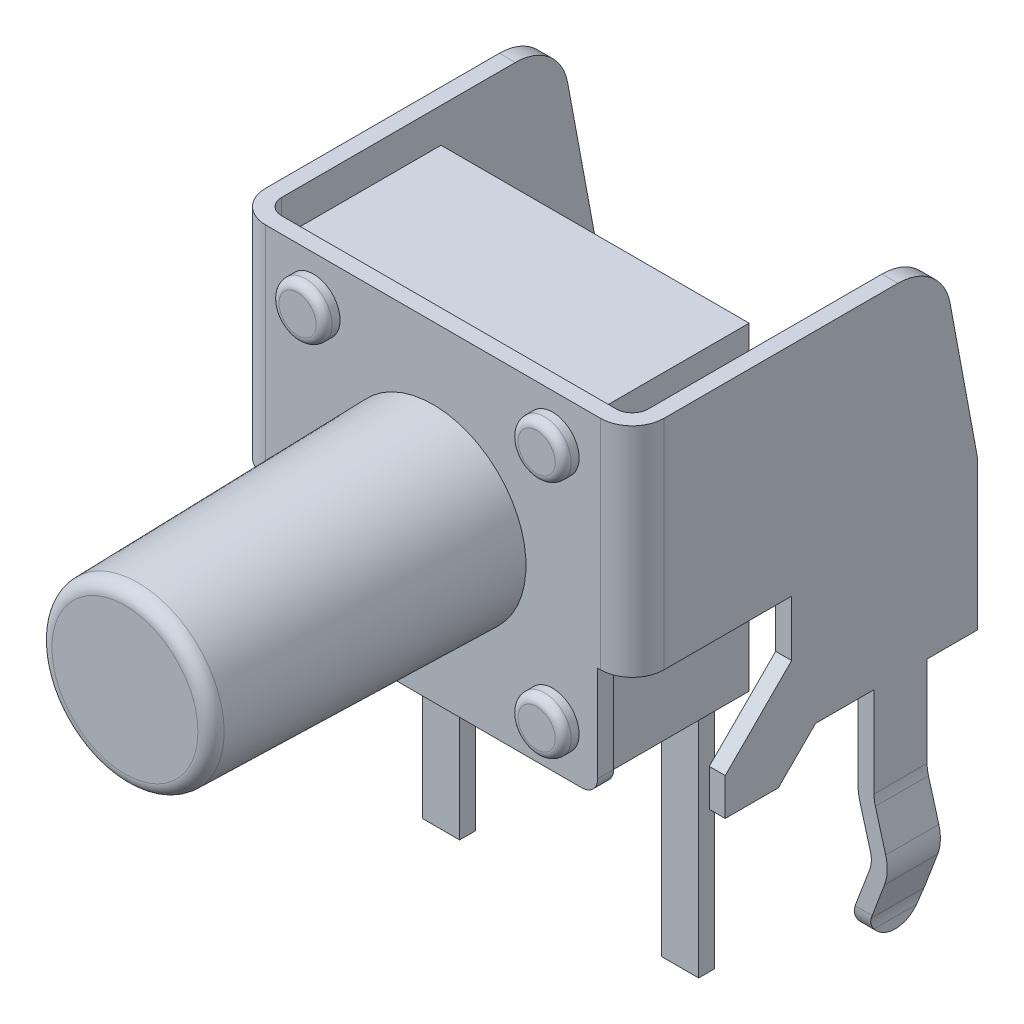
ISO-10303-21;
HEADER;
FILE_DESCRIPTION(('STEP AP214'),'2;1');
FILE_NAME('part.step','',(''),(''),'','','');
FILE_SCHEMA(('AUTOMOTIVE_DESIGN { 1 0 10303 214 1 1 1 1 }'));
ENDSEC;
DATA;
#1=APPLICATION_CONTEXT('core data for automotive mechanical design processes');
#2=APPLICATION_PROTOCOL_DEFINITION('international standard','automotive_design',2000,#1);
#3=PRODUCT_CONTEXT('',#1,'mechanical');
#4=PRODUCT('Part','Part','',(#3));
#5=PRODUCT_RELATED_PRODUCT_CATEGORY('part','',(#4));
#6=PRODUCT_DEFINITION_FORMATION('','',#4);
#7=PRODUCT_DEFINITION_CONTEXT('part definition',#1,'design');
#8=PRODUCT_DEFINITION('design','',#6,#7);
#9=PRODUCT_DEFINITION_SHAPE('','',#8);
#10=(LENGTH_UNIT() NAMED_UNIT(*) SI_UNIT(.MILLI.,.METRE.));
#11=(NAMED_UNIT(*) PLANE_ANGLE_UNIT() SI_UNIT($,.RADIAN.));
#12=(NAMED_UNIT(*) SI_UNIT($,.STERADIAN.) SOLID_ANGLE_UNIT());
#13=UNCERTAINTY_MEASURE_WITH_UNIT(LENGTH_MEASURE(1.E-05),#10,'distance_accuracy_value','');
#14=(GEOMETRIC_REPRESENTATION_CONTEXT(3) GLOBAL_UNCERTAINTY_ASSIGNED_CONTEXT((#13)) GLOBAL_UNIT_ASSIGNED_CONTEXT((#10,
#11,#12)) REPRESENTATION_CONTEXT('',''));
#15=CARTESIAN_POINT('',(0.,0.,0.));
#16=DIRECTION('',(0.,0.,1.));
#17=DIRECTION('',(1.,0.,0.));
#18=AXIS2_PLACEMENT_3D('',#15,#16,#17);
#19=CARTESIAN_POINT('',(-3.15,7.1,2.55));
#20=DIRECTION('',(0.,0.,-1.));
#21=DIRECTION('',(-1.,0.,0.));
#22=AXIS2_PLACEMENT_3D('',#19,#20,#21);
#23=PLANE('',#22);
#24=CARTESIAN_POINT('',(-2.25,1.75,2.55));
#25=DIRECTION('',(0.,0.,-1.));
#26=DIRECTION('',(-1.,0.,0.));
#27=AXIS2_PLACEMENT_3D('',#24,#25,#26);
#28=CIRCLE('',#27,0.5);
#29=CARTESIAN_POINT('',(-2.75,1.75,2.55));
#30=VERTEX_POINT('',#29);
#31=EDGE_CURVE('E995',#30,#30,#28,.F.);
#32=ORIENTED_EDGE('',*,*,#31,.F.);
#33=EDGE_LOOP('',(#32));
#34=FACE_BOUND('',#33,.T.);
#35=CARTESIAN_POINT('',(-2.25,6.25,2.55));
#36=DIRECTION('',(0.,0.,-1.));
#37=DIRECTION('',(-1.,0.,0.));
#38=AXIS2_PLACEMENT_3D('',#35,#36,#37);
#39=CIRCLE('',#38,0.5);
#40=CARTESIAN_POINT('',(-2.75,6.25,2.55));
#41=VERTEX_POINT('',#40);
#42=EDGE_CURVE('E989',#41,#41,#39,.F.);
#43=ORIENTED_EDGE('',*,*,#42,.F.);
#44=EDGE_LOOP('',(#43));
#45=FACE_BOUND('',#44,.T.);
#46=DIRECTION('',(0.,-1.,0.));
#47=VECTOR('',#46,1.);
#48=CARTESIAN_POINT('',(3.1,3.,2.55));
#49=LINE('',#48,#47);
#50=CARTESIAN_POINT('',(3.1,3.,2.55));
#51=VERTEX_POINT('',#50);
#52=CARTESIAN_POINT('',(3.1,1.2,2.55));
#53=VERTEX_POINT('',#52);
#54=EDGE_CURVE('E606',#51,#53,#49,.T.);
#55=ORIENTED_EDGE('',*,*,#54,.F.);
#56=DIRECTION('',(-1.,0.,0.));
#57=VECTOR('',#56,1.);
#58=CARTESIAN_POINT('',(3.2,3.,2.55));
#59=LINE('',#58,#57);
#60=CARTESIAN_POINT('',(3.15,3.,2.55));
#61=VERTEX_POINT('',#60);
#62=EDGE_CURVE('E603',#61,#51,#59,.T.);
#63=ORIENTED_EDGE('',*,*,#62,.F.);
#64=DIRECTION('',(0.,-1.,0.));
#65=VECTOR('',#64,1.);
#66=CARTESIAN_POINT('',(3.15,7.1,2.55));
#67=LINE('',#66,#65);
#68=CARTESIAN_POINT('',(3.15,7.1,2.55));
#69=VERTEX_POINT('',#68);
#70=EDGE_CURVE('E2178',#69,#61,#67,.T.);
#71=ORIENTED_EDGE('',*,*,#70,.F.);
#72=DIRECTION('',(1.,0.,0.));
#73=VECTOR('',#72,1.);
#74=CARTESIAN_POINT('',(-3.15,7.1,2.55));
#75=LINE('',#74,#73);
#76=CARTESIAN_POINT('',(-3.15,7.1,2.55));
#77=VERTEX_POINT('',#76);
#78=EDGE_CURVE('E1941',#77,#69,#75,.T.);
#79=ORIENTED_EDGE('',*,*,#78,.F.);
#80=DIRECTION('',(0.,-1.,0.));
#81=VECTOR('',#80,1.);
#82=CARTESIAN_POINT('',(-3.15,7.1,2.55));
#83=LINE('',#82,#81);
#84=CARTESIAN_POINT('',(-3.15,3.,2.55));
#85=VERTEX_POINT('',#84);
#86=EDGE_CURVE('E2180',#77,#85,#83,.T.);
#87=ORIENTED_EDGE('',*,*,#86,.T.);
#88=DIRECTION('',(-1.,0.,0.));
#89=VECTOR('',#88,1.);
#90=CARTESIAN_POINT('',(-3.1,3.,2.55));
#91=LINE('',#90,#89);
#92=CARTESIAN_POINT('',(-3.1,3.,2.55));
#93=VERTEX_POINT('',#92);
#94=EDGE_CURVE('E600',#93,#85,#91,.T.);
#95=ORIENTED_EDGE('',*,*,#94,.F.);
#96=DIRECTION('',(0.,1.,0.));
#97=VECTOR('',#96,1.);
#98=CARTESIAN_POINT('',(-3.1,3.,2.55));
#99=LINE('',#98,#97);
#100=CARTESIAN_POINT('',(-3.1,1.2,2.55));
#101=VERTEX_POINT('',#100);
#102=EDGE_CURVE('E597',#101,#93,#99,.T.);
#103=ORIENTED_EDGE('',*,*,#102,.F.);
#104=CARTESIAN_POINT('',(-2.8,1.2,2.55));
#105=DIRECTION('',(0.,0.,-1.));
#106=DIRECTION('',(1.,0.,0.));
#107=AXIS2_PLACEMENT_3D('',#104,#105,#106);
#108=CIRCLE('',#107,0.3);
#109=CARTESIAN_POINT('',(-2.8,0.9,2.55));
#110=VERTEX_POINT('',#109);
#111=EDGE_CURVE('E615',#110,#101,#108,.T.);
#112=ORIENTED_EDGE('',*,*,#111,.F.);
#113=DIRECTION('',(-1.,0.,0.));
#114=VECTOR('',#113,1.);
#115=CARTESIAN_POINT('',(-2.8,0.9,2.55));
#116=LINE('',#115,#114);
#117=CARTESIAN_POINT('',(2.8,0.9,2.55));
#118=VERTEX_POINT('',#117);
#119=EDGE_CURVE('E612',#118,#110,#116,.T.);
#120=ORIENTED_EDGE('',*,*,#119,.F.);
#121=CARTESIAN_POINT('',(2.8,1.2,2.55));
#122=DIRECTION('',(0.,0.,-1.));
#123=DIRECTION('',(1.,0.,0.));
#124=AXIS2_PLACEMENT_3D('',#121,#122,#123);
#125=CIRCLE('',#124,0.3);
#126=EDGE_CURVE('E609',#53,#118,#125,.T.);
#127=ORIENTED_EDGE('',*,*,#126,.F.);
#128=EDGE_LOOP('',(#55,#63,#71,#79,#87,#95,#103,#112,#120,#127));
#129=FACE_BOUND('',#128,.T.);
#130=CARTESIAN_POINT('',(0.,4.,2.55));
#131=DIRECTION('',(0.,0.,-1.));
#132=DIRECTION('',(-1.,0.,0.));
#133=AXIS2_PLACEMENT_3D('',#130,#131,#132);
#134=CIRCLE('',#133,1.75);
#135=CARTESIAN_POINT('',(-1.75,4.,2.55));
#136=VERTEX_POINT('',#135);
#137=EDGE_CURVE('E986',#136,#136,#134,.F.);
#138=ORIENTED_EDGE('',*,*,#137,.F.);
#139=EDGE_LOOP('',(#138));
#140=FACE_BOUND('',#139,.T.);
#141=CARTESIAN_POINT('',(2.25,6.25,2.55));
#142=DIRECTION('',(0.,0.,-1.));
#143=DIRECTION('',(-1.,0.,0.));
#144=AXIS2_PLACEMENT_3D('',#141,#142,#143);
#145=CIRCLE('',#144,0.5);
#146=CARTESIAN_POINT('',(1.75,6.25,2.55));
#147=VERTEX_POINT('',#146);
#148=EDGE_CURVE('E992',#147,#147,#145,.F.);
#149=ORIENTED_EDGE('',*,*,#148,.F.);
#150=EDGE_LOOP('',(#149));
#151=FACE_BOUND('',#150,.T.);
#152=CARTESIAN_POINT('',(2.25,1.75,2.55));
#153=DIRECTION('',(0.,0.,-1.));
#154=DIRECTION('',(-1.,0.,0.));
#155=AXIS2_PLACEMENT_3D('',#152,#153,#154);
#156=CIRCLE('',#155,0.5);
#157=CARTESIAN_POINT('',(1.75,1.75,2.55));
#158=VERTEX_POINT('',#157);
#159=EDGE_CURVE('E998',#158,#158,#156,.F.);
#160=ORIENTED_EDGE('',*,*,#159,.F.);
#161=EDGE_LOOP('',(#160));
#162=FACE_BOUND('',#161,.T.);
#163=ADVANCED_FACE('F32',(#34,#45,#129,#140,#151,#162),#23,.F.);
#164=CARTESIAN_POINT('',(-2.9,1.,2.25));
#165=DIRECTION('',(0.,1.,0.));
#166=DIRECTION('',(0.,0.,1.));
#167=AXIS2_PLACEMENT_3D('',#164,#165,#166);
#168=PLANE('',#167);
#169=DIRECTION('',(0.,0.,1.));
#170=VECTOR('',#169,1.);
#171=CARTESIAN_POINT('',(-2.6,1.,0.15));
#172=LINE('',#171,#170);
#173=CARTESIAN_POINT('',(-2.6,1.,-0.15));
#174=VERTEX_POINT('',#173);
#175=CARTESIAN_POINT('',(-2.6,1.,0.15));
#176=VERTEX_POINT('',#175);
#177=EDGE_CURVE('E563',#174,#176,#172,.T.);
#178=ORIENTED_EDGE('',*,*,#177,.T.);
#179=DIRECTION('',(1.,0.,0.));
#180=VECTOR('',#179,1.);
#181=CARTESIAN_POINT('',(-2.6,1.,0.15));
#182=LINE('',#181,#180);
#183=CARTESIAN_POINT('',(-1.9,1.,0.15));
#184=VERTEX_POINT('',#183);
#185=EDGE_CURVE('E565',#176,#184,#182,.T.);
#186=ORIENTED_EDGE('',*,*,#185,.T.);
#187=DIRECTION('',(0.,0.,-1.));
#188=VECTOR('',#187,1.);
#189=CARTESIAN_POINT('',(-1.9,1.,0.149999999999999));
#190=LINE('',#189,#188);
#191=CARTESIAN_POINT('',(-1.9,1.,-0.149999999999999));
#192=VERTEX_POINT('',#191);
#193=EDGE_CURVE('E567',#184,#192,#190,.T.);
#194=ORIENTED_EDGE('',*,*,#193,.T.);
#195=DIRECTION('',(-1.,0.,0.));
#196=VECTOR('',#195,1.);
#197=CARTESIAN_POINT('',(-2.6,1.,-0.15));
#198=LINE('',#197,#196);
#199=EDGE_CURVE('E569',#192,#174,#198,.T.);
#200=ORIENTED_EDGE('',*,*,#199,.T.);
#201=EDGE_LOOP('',(#178,#186,#194,#200));
#202=FACE_BOUND('',#201,.T.);
#203=DIRECTION('',(0.,0.,-1.));
#204=VECTOR('',#203,1.);
#205=CARTESIAN_POINT('',(-2.9,1.,2.25));
#206=LINE('',#205,#204);
#207=CARTESIAN_POINT('',(-2.9,1.,2.25));
#208=VERTEX_POINT('',#207);
#209=CARTESIAN_POINT('',(-2.9,1.,-0.5));
#210=VERTEX_POINT('',#209);
#211=EDGE_CURVE('E1957',#208,#210,#206,.T.);
#212=ORIENTED_EDGE('',*,*,#211,.T.);
#213=DIRECTION('',(1.,0.,0.));
#214=VECTOR('',#213,1.);
#215=CARTESIAN_POINT('',(-2.9,1.,-0.5));
#216=LINE('',#215,#214);
#217=CARTESIAN_POINT('',(2.9,1.,-0.5));
#218=VERTEX_POINT('',#217);
#219=EDGE_CURVE('E2209',#210,#218,#216,.T.);
#220=ORIENTED_EDGE('',*,*,#219,.T.);
#221=DIRECTION('',(0.,0.,-1.));
#222=VECTOR('',#221,1.);
#223=CARTESIAN_POINT('',(2.9,1.,2.25));
#224=LINE('',#223,#222);
#225=CARTESIAN_POINT('',(2.9,1.,2.25));
#226=VERTEX_POINT('',#225);
#227=EDGE_CURVE('E2233',#226,#218,#224,.T.);
#228=ORIENTED_EDGE('',*,*,#227,.F.);
#229=DIRECTION('',(1.,0.,0.));
#230=VECTOR('',#229,1.);
#231=CARTESIAN_POINT('',(-2.9,1.,2.25));
#232=LINE('',#231,#230);
#233=EDGE_CURVE('E2221',#208,#226,#232,.T.);
#234=ORIENTED_EDGE('',*,*,#233,.F.);
#235=EDGE_LOOP('',(#212,#220,#228,#234));
#236=FACE_BOUND('',#235,.T.);
#237=DIRECTION('',(1.,0.,0.));
#238=VECTOR('',#237,1.);
#239=CARTESIAN_POINT('',(2.6,1.,0.150000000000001));
#240=LINE('',#239,#238);
#241=CARTESIAN_POINT('',(1.9,1.,0.150000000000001));
#242=VERTEX_POINT('',#241);
#243=CARTESIAN_POINT('',(2.6,1.,0.150000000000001));
#244=VERTEX_POINT('',#243);
#245=EDGE_CURVE('E47',#242,#244,#240,.T.);
#246=ORIENTED_EDGE('',*,*,#245,.T.);
#247=DIRECTION('',(0.,0.,-1.));
#248=VECTOR('',#247,1.);
#249=CARTESIAN_POINT('',(2.6,1.,0.150000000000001));
#250=LINE('',#249,#248);
#251=CARTESIAN_POINT('',(2.6,1.,-0.150000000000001));
#252=VERTEX_POINT('',#251);
#253=EDGE_CURVE('E51',#244,#252,#250,.T.);
#254=ORIENTED_EDGE('',*,*,#253,.T.);
#255=DIRECTION('',(-1.,0.,0.));
#256=VECTOR('',#255,1.);
#257=CARTESIAN_POINT('',(2.6,1.,-0.150000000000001));
#258=LINE('',#257,#256);
#259=CARTESIAN_POINT('',(1.9,1.,-0.150000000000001));
#260=VERTEX_POINT('',#259);
#261=EDGE_CURVE('E544',#252,#260,#258,.T.);
#262=ORIENTED_EDGE('',*,*,#261,.T.);
#263=DIRECTION('',(0.,0.,1.));
#264=VECTOR('',#263,1.);
#265=CARTESIAN_POINT('',(1.9,1.,0.150000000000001));
#266=LINE('',#265,#264);
#267=EDGE_CURVE('E546',#260,#242,#266,.T.);
#268=ORIENTED_EDGE('',*,*,#267,.T.);
#269=EDGE_LOOP('',(#246,#254,#262,#268));
#270=FACE_BOUND('',#269,.T.);
#271=ADVANCED_FACE('F748',(#202,#236,#270),#168,.F.);
#272=CARTESIAN_POINT('',(3.15,7.1,1.95));
#273=DIRECTION('',(0.,1.,0.));
#274=DIRECTION('',(0.,0.,1.));
#275=AXIS2_PLACEMENT_3D('',#272,#273,#274);
#276=PLANE('',#275);
#277=DIRECTION('',(0.,0.,-1.));
#278=VECTOR('',#277,1.);
#279=CARTESIAN_POINT('',(-3.45,7.1,1.95));
#280=LINE('',#279,#278);
#281=CARTESIAN_POINT('',(-3.45,7.1,1.95));
#282=VERTEX_POINT('',#281);
#283=CARTESIAN_POINT('',(-3.45,7.1,-2.45));
#284=VERTEX_POINT('',#283);
#285=EDGE_CURVE('E1934',#282,#284,#280,.T.);
#286=ORIENTED_EDGE('',*,*,#285,.T.);
#287=DIRECTION('',(1.,0.,0.));
#288=VECTOR('',#287,1.);
#289=CARTESIAN_POINT('',(-4.,7.1,-2.45));
#290=LINE('',#289,#288);
#291=CARTESIAN_POINT('',(-3.75,7.1,-2.45));
#292=VERTEX_POINT('',#291);
#293=EDGE_CURVE('E633',#292,#284,#290,.T.);
#294=ORIENTED_EDGE('',*,*,#293,.F.);
#295=DIRECTION('',(0.,0.,1.));
#296=VECTOR('',#295,1.);
#297=CARTESIAN_POINT('',(-3.75,7.1,1.95));
#298=LINE('',#297,#296);
#299=CARTESIAN_POINT('',(-3.75,7.1,1.95));
#300=VERTEX_POINT('',#299);
#301=EDGE_CURVE('E1937',#292,#300,#298,.T.);
#302=ORIENTED_EDGE('',*,*,#301,.T.);
#303=CARTESIAN_POINT('',(-3.15,7.1,1.95));
#304=DIRECTION('',(0.,1.,0.));
#305=DIRECTION('',(0.,0.,-1.));
#306=AXIS2_PLACEMENT_3D('',#303,#304,#305);
#307=CIRCLE('',#306,0.6);
#308=EDGE_CURVE('E1939',#300,#77,#307,.T.);
#309=ORIENTED_EDGE('',*,*,#308,.T.);
#310=ORIENTED_EDGE('',*,*,#78,.T.);
#311=CARTESIAN_POINT('',(3.15,7.1,1.95));
#312=DIRECTION('',(0.,1.,0.));
#313=DIRECTION('',(0.,0.,1.));
#314=AXIS2_PLACEMENT_3D('',#311,#312,#313);
#315=CIRCLE('',#314,0.6);
#316=CARTESIAN_POINT('',(3.75,7.1,1.95));
#317=VERTEX_POINT('',#316);
#318=EDGE_CURVE('E1943',#69,#317,#315,.T.);
#319=ORIENTED_EDGE('',*,*,#318,.T.);
#320=DIRECTION('',(0.,0.,-1.));
#321=VECTOR('',#320,1.);
#322=CARTESIAN_POINT('',(3.75,7.1,1.95));
#323=LINE('',#322,#321);
#324=CARTESIAN_POINT('',(3.75,7.1,-2.45));
#325=VERTEX_POINT('',#324);
#326=EDGE_CURVE('E1945',#317,#325,#323,.T.);
#327=ORIENTED_EDGE('',*,*,#326,.T.);
#328=DIRECTION('',(-1.,0.,0.));
#329=VECTOR('',#328,1.);
#330=CARTESIAN_POINT('',(4.,7.1,-2.45));
#331=LINE('',#330,#329);
#332=CARTESIAN_POINT('',(3.45,7.1,-2.45));
#333=VERTEX_POINT('',#332);
#334=EDGE_CURVE('E2151',#325,#333,#331,.T.);
#335=ORIENTED_EDGE('',*,*,#334,.T.);
#336=DIRECTION('',(0.,0.,1.));
#337=VECTOR('',#336,1.);
#338=CARTESIAN_POINT('',(3.45,7.1,1.95));
#339=LINE('',#338,#337);
#340=CARTESIAN_POINT('',(3.45,7.1,1.95));
#341=VERTEX_POINT('',#340);
#342=EDGE_CURVE('E1926',#333,#341,#339,.T.);
#343=ORIENTED_EDGE('',*,*,#342,.T.);
#344=CARTESIAN_POINT('',(3.15,7.1,1.95));
#345=DIRECTION('',(0.,-1.,0.));
#346=DIRECTION('',(0.,0.,1.));
#347=AXIS2_PLACEMENT_3D('',#344,#345,#346);
#348=CIRCLE('',#347,0.3);
#349=CARTESIAN_POINT('',(3.15,7.1,2.25));
#350=VERTEX_POINT('',#349);
#351=EDGE_CURVE('E1928',#341,#350,#348,.T.);
#352=ORIENTED_EDGE('',*,*,#351,.T.);
#353=DIRECTION('',(-1.,0.,0.));
#354=VECTOR('',#353,1.);
#355=CARTESIAN_POINT('',(-3.15,7.1,2.25));
#356=LINE('',#355,#354);
#357=CARTESIAN_POINT('',(-3.15,7.1,2.25));
#358=VERTEX_POINT('',#357);
#359=EDGE_CURVE('E1930',#350,#358,#356,.T.);
#360=ORIENTED_EDGE('',*,*,#359,.T.);
#361=CARTESIAN_POINT('',(-3.15,7.1,1.95));
#362=DIRECTION('',(0.,-1.,0.));
#363=DIRECTION('',(0.,0.,-1.));
#364=AXIS2_PLACEMENT_3D('',#361,#362,#363);
#365=CIRCLE('',#364,0.3);
#366=EDGE_CURVE('E1932',#358,#282,#365,.T.);
#367=ORIENTED_EDGE('',*,*,#366,.T.);
#368=EDGE_LOOP('',(#286,#294,#302,#309,#310,#319,#327,#335,#343,#352,#360,#367));
#369=FACE_BOUND('',#368,.T.);
#370=ADVANCED_FACE('F754',(#369),#276,.T.);
#371=CARTESIAN_POINT('',(3.45,7.1,-3.95));
#372=DIRECTION('',(0.,0.,1.));
#373=DIRECTION('',(1.,0.,0.));
#374=AXIS2_PLACEMENT_3D('',#371,#372,#373);
#375=PLANE('',#374);
#376=DIRECTION('',(-1.,0.,0.));
#377=VECTOR('',#376,1.);
#378=CARTESIAN_POINT('',(4.,3.5,-3.95));
#379=LINE('',#378,#377);
#380=CARTESIAN_POINT('',(3.75,3.5,-3.95));
#381=VERTEX_POINT('',#380);
#382=CARTESIAN_POINT('',(3.45,3.5,-3.95));
#383=VERTEX_POINT('',#382);
#384=EDGE_CURVE('E2067',#381,#383,#379,.T.);
#385=ORIENTED_EDGE('',*,*,#384,.F.);
#386=DIRECTION('',(0.,-1.,0.));
#387=VECTOR('',#386,1.);
#388=CARTESIAN_POINT('',(3.75,7.1,-3.95));
#389=LINE('',#388,#387);
#390=CARTESIAN_POINT('',(3.75,0.7,-3.95));
#391=VERTEX_POINT('',#390);
#392=EDGE_CURVE('E1948',#381,#391,#389,.T.);
#393=ORIENTED_EDGE('',*,*,#392,.T.);
#394=DIRECTION('',(-1.,0.,0.));
#395=VECTOR('',#394,1.);
#396=CARTESIAN_POINT('',(4.,0.7,-3.95));
#397=LINE('',#396,#395);
#398=CARTESIAN_POINT('',(3.45,0.7,-3.95));
#399=VERTEX_POINT('',#398);
#400=EDGE_CURVE('E2027',#391,#399,#397,.T.);
#401=ORIENTED_EDGE('',*,*,#400,.T.);
#402=DIRECTION('',(0.,-1.,0.));
#403=VECTOR('',#402,1.);
#404=CARTESIAN_POINT('',(3.45,7.1,-3.95));
#405=LINE('',#404,#403);
#406=EDGE_CURVE('E2204',#383,#399,#405,.T.);
#407=ORIENTED_EDGE('',*,*,#406,.F.);
#408=EDGE_LOOP('',(#385,#393,#401,#407));
#409=FACE_BOUND('',#408,.T.);
#410=ADVANCED_FACE('F797',(#409),#375,.F.);
#411=CARTESIAN_POINT('',(3.45,7.1,1.95));
#412=DIRECTION('',(1.,0.,0.));
#413=DIRECTION('',(0.,0.,-1.));
#414=AXIS2_PLACEMENT_3D('',#411,#412,#413);
#415=PLANE('',#414);
#416=CARTESIAN_POINT('',(3.45,6.1,-2.45));
#417=DIRECTION('',(1.,0.,0.));
#418=DIRECTION('',(0.,0.,-1.));
#419=AXIS2_PLACEMENT_3D('',#416,#417,#418);
#420=CIRCLE('',#419,1.);
#421=CARTESIAN_POINT('',(3.45,6.28260727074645,-3.43318593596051));
#422=VERTEX_POINT('',#421);
#423=EDGE_CURVE('E2060',#422,#333,#420,.T.);
#424=ORIENTED_EDGE('',*,*,#423,.F.);
#425=DIRECTION('',(0.,0.983185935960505,0.182607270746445));
#426=VECTOR('',#425,1.);
#427=CARTESIAN_POINT('',(3.45,8.03922421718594,-3.10692920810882));
#428=LINE('',#427,#426);
#429=EDGE_CURVE('E2058',#383,#422,#428,.T.);
#430=ORIENTED_EDGE('',*,*,#429,.F.);
#431=ORIENTED_EDGE('',*,*,#406,.T.);
#432=DIRECTION('',(0.,0.,-1.));
#433=VECTOR('',#432,1.);
#434=CARTESIAN_POINT('',(3.45,0.7,1.95));
#435=LINE('',#434,#433);
#436=CARTESIAN_POINT('',(3.45,0.7,-3.));
#437=VERTEX_POINT('',#436);
#438=EDGE_CURVE('E1851',#437,#399,#435,.T.);
#439=ORIENTED_EDGE('',*,*,#438,.F.);
#440=DIRECTION('',(0.,1.,0.));
#441=VECTOR('',#440,1.);
#442=CARTESIAN_POINT('',(3.45,7.1,-3.));
#443=LINE('',#442,#441);
#444=CARTESIAN_POINT('',(3.45,-1.,-3.));
#445=VERTEX_POINT('',#444);
#446=EDGE_CURVE('E1988',#445,#437,#443,.T.);
#447=ORIENTED_EDGE('',*,*,#446,.F.);
#448=DIRECTION('',(0.,0.,1.));
#449=VECTOR('',#448,1.);
#450=CARTESIAN_POINT('',(3.45,-1.,-7.50984550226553));
#451=LINE('',#450,#449);
#452=CARTESIAN_POINT('',(3.45,-1.,-2.));
#453=VERTEX_POINT('',#452);
#454=EDGE_CURVE('E1858',#445,#453,#451,.T.);
#455=ORIENTED_EDGE('',*,*,#454,.T.);
#456=DIRECTION('',(0.,-1.,0.));
#457=VECTOR('',#456,1.);
#458=CARTESIAN_POINT('',(3.45,7.1,-2.));
#459=LINE('',#458,#457);
#460=CARTESIAN_POINT('',(3.45,0.7,-2.));
#461=VERTEX_POINT('',#460);
#462=EDGE_CURVE('E2015',#461,#453,#459,.T.);
#463=ORIENTED_EDGE('',*,*,#462,.F.);
#464=DIRECTION('',(0.,0.,-1.));
#465=VECTOR('',#464,1.);
#466=CARTESIAN_POINT('',(3.45,0.7,1.95));
#467=LINE('',#466,#465);
#468=CARTESIAN_POINT('',(3.45,0.7,-0.899999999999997));
#469=VERTEX_POINT('',#468);
#470=EDGE_CURVE('E1849',#469,#461,#467,.T.);
#471=ORIENTED_EDGE('',*,*,#470,.F.);
#472=DIRECTION('',(0.,0.707106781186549,-0.707106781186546));
#473=VECTOR('',#472,1.);
#474=CARTESIAN_POINT('',(3.45,2.47500000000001,-2.675));
#475=LINE('',#474,#473);
#476=CARTESIAN_POINT('',(3.45,0.,-0.2));
#477=VERTEX_POINT('',#476);
#478=EDGE_CURVE('E1847',#477,#469,#475,.T.);
#479=ORIENTED_EDGE('',*,*,#478,.F.);
#480=DIRECTION('',(0.,0.,1.));
#481=VECTOR('',#480,1.);
#482=CARTESIAN_POINT('',(3.45,0.,1.95));
#483=LINE('',#482,#481);
#484=CARTESIAN_POINT('',(3.45,0.,0.800000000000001));
#485=VERTEX_POINT('',#484);
#486=EDGE_CURVE('E1893',#477,#485,#483,.T.);
#487=ORIENTED_EDGE('',*,*,#486,.T.);
#488=DIRECTION('',(0.,-1.,0.));
#489=VECTOR('',#488,1.);
#490=CARTESIAN_POINT('',(3.45,7.1,0.800000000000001));
#491=LINE('',#490,#489);
#492=CARTESIAN_POINT('',(3.45,0.7,0.800000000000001));
#493=VERTEX_POINT('',#492);
#494=EDGE_CURVE('E1845',#493,#485,#491,.T.);
#495=ORIENTED_EDGE('',*,*,#494,.F.);
#496=DIRECTION('',(0.,-0.707106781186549,0.707106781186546));
#497=VECTOR('',#496,1.);
#498=CARTESIAN_POINT('',(3.45,3.32500000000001,-1.825));
#499=LINE('',#498,#497);
#500=CARTESIAN_POINT('',(3.45,1.95000000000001,-0.45));
#501=VERTEX_POINT('',#500);
#502=EDGE_CURVE('E1843',#501,#493,#499,.T.);
#503=ORIENTED_EDGE('',*,*,#502,.F.);
#504=DIRECTION('',(0.,-1.,0.));
#505=VECTOR('',#504,1.);
#506=CARTESIAN_POINT('',(3.45,7.1,-0.45));
#507=LINE('',#506,#505);
#508=CARTESIAN_POINT('',(3.45,3.,-0.45));
#509=VERTEX_POINT('',#508);
#510=EDGE_CURVE('E1841',#509,#501,#507,.T.);
#511=ORIENTED_EDGE('',*,*,#510,.F.);
#512=DIRECTION('',(0.,0.,-1.));
#513=VECTOR('',#512,1.);
#514=CARTESIAN_POINT('',(3.45,3.,1.95));
#515=LINE('',#514,#513);
#516=CARTESIAN_POINT('',(3.45,3.,1.95));
#517=VERTEX_POINT('',#516);
#518=EDGE_CURVE('E1839',#517,#509,#515,.T.);
#519=ORIENTED_EDGE('',*,*,#518,.F.);
#520=DIRECTION('',(0.,-1.,0.));
#521=VECTOR('',#520,1.);
#522=CARTESIAN_POINT('',(3.45,7.1,1.95));
#523=LINE('',#522,#521);
#524=EDGE_CURVE('E2201',#341,#517,#523,.T.);
#525=ORIENTED_EDGE('',*,*,#524,.F.);
#526=ORIENTED_EDGE('',*,*,#342,.F.);
#527=EDGE_LOOP('',(#424,#430,#431,#439,#447,#455,#463,#471,#479,#487,#495,#503,#511,#519,#525,#526));
#528=FACE_BOUND('',#527,.T.);
#529=ADVANCED_FACE('F793',(#528),#415,.F.);
#530=CARTESIAN_POINT('',(3.75,7.1,1.95));
#531=DIRECTION('',(-1.,0.,0.));
#532=DIRECTION('',(0.,0.,1.));
#533=AXIS2_PLACEMENT_3D('',#530,#531,#532);
#534=PLANE('',#533);
#535=CARTESIAN_POINT('',(3.75,6.1,-2.45));
#536=DIRECTION('',(-1.,0.,0.));
#537=DIRECTION('',(0.,0.,1.));
#538=AXIS2_PLACEMENT_3D('',#535,#536,#537);
#539=CIRCLE('',#538,1.);
#540=CARTESIAN_POINT('',(3.75,6.28260727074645,-3.43318593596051));
#541=VERTEX_POINT('',#540);
#542=EDGE_CURVE('E2062',#325,#541,#539,.T.);
#543=ORIENTED_EDGE('',*,*,#542,.F.);
#544=ORIENTED_EDGE('',*,*,#326,.F.);
#545=DIRECTION('',(0.,-1.,0.));
#546=VECTOR('',#545,1.);
#547=CARTESIAN_POINT('',(3.75,7.1,1.95));
#548=LINE('',#547,#546);
#549=CARTESIAN_POINT('',(3.75,3.,1.95));
#550=VERTEX_POINT('',#549);
#551=EDGE_CURVE('E2175',#317,#550,#548,.T.);
#552=ORIENTED_EDGE('',*,*,#551,.T.);
#553=DIRECTION('',(0.,0.,1.));
#554=VECTOR('',#553,1.);
#555=CARTESIAN_POINT('',(3.75,3.,1.95));
#556=LINE('',#555,#554);
#557=CARTESIAN_POINT('',(3.75,3.,-0.45));
#558=VERTEX_POINT('',#557);
#559=EDGE_CURVE('E1805',#558,#550,#556,.T.);
#560=ORIENTED_EDGE('',*,*,#559,.F.);
#561=DIRECTION('',(0.,1.,0.));
#562=VECTOR('',#561,1.);
#563=CARTESIAN_POINT('',(3.75,7.1,-0.45));
#564=LINE('',#563,#562);
#565=CARTESIAN_POINT('',(3.75,1.95000000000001,-0.45));
#566=VERTEX_POINT('',#565);
#567=EDGE_CURVE('E2165',#566,#558,#564,.T.);
#568=ORIENTED_EDGE('',*,*,#567,.F.);
#569=DIRECTION('',(0.,0.707106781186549,-0.707106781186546));
#570=VECTOR('',#569,1.);
#571=CARTESIAN_POINT('',(3.75,3.32500000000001,-1.825));
#572=LINE('',#571,#570);
#573=CARTESIAN_POINT('',(3.75,0.7,0.800000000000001));
#574=VERTEX_POINT('',#573);
#575=EDGE_CURVE('E2163',#574,#566,#572,.T.);
#576=ORIENTED_EDGE('',*,*,#575,.F.);
#577=DIRECTION('',(0.,1.,0.));
#578=VECTOR('',#577,1.);
#579=CARTESIAN_POINT('',(3.75,7.1,0.800000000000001));
#580=LINE('',#579,#578);
#581=CARTESIAN_POINT('',(3.75,0.,0.800000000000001));
#582=VERTEX_POINT('',#581);
#583=EDGE_CURVE('E2161',#582,#574,#580,.T.);
#584=ORIENTED_EDGE('',*,*,#583,.F.);
#585=DIRECTION('',(0.,0.,-1.));
#586=VECTOR('',#585,1.);
#587=CARTESIAN_POINT('',(3.75,0.,1.95));
#588=LINE('',#587,#586);
#589=CARTESIAN_POINT('',(3.75,0.,-0.2));
#590=VERTEX_POINT('',#589);
#591=EDGE_CURVE('E1806',#582,#590,#588,.T.);
#592=ORIENTED_EDGE('',*,*,#591,.T.);
#593=DIRECTION('',(0.,-0.707106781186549,0.707106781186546));
#594=VECTOR('',#593,1.);
#595=CARTESIAN_POINT('',(3.75,2.47500000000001,-2.675));
#596=LINE('',#595,#594);
#597=CARTESIAN_POINT('',(3.75,0.7,-0.899999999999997));
#598=VERTEX_POINT('',#597);
#599=EDGE_CURVE('E2158',#598,#590,#596,.T.);
#600=ORIENTED_EDGE('',*,*,#599,.F.);
#601=DIRECTION('',(0.,0.,1.));
#602=VECTOR('',#601,1.);
#603=CARTESIAN_POINT('',(3.75,0.7,1.95));
#604=LINE('',#603,#602);
#605=CARTESIAN_POINT('',(3.75,0.7,-2.));
#606=VERTEX_POINT('',#605);
#607=EDGE_CURVE('E2156',#606,#598,#604,.T.);
#608=ORIENTED_EDGE('',*,*,#607,.F.);
#609=DIRECTION('',(0.,1.,0.));
#610=VECTOR('',#609,1.);
#611=CARTESIAN_POINT('',(3.75,7.1,-2.));
#612=LINE('',#611,#610);
#613=CARTESIAN_POINT('',(3.75,-1.,-2.));
#614=VERTEX_POINT('',#613);
#615=EDGE_CURVE('E2002',#614,#606,#612,.T.);
#616=ORIENTED_EDGE('',*,*,#615,.F.);
#617=DIRECTION('',(0.,0.,1.));
#618=VECTOR('',#617,1.);
#619=CARTESIAN_POINT('',(3.75,-1.,-7.50984550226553));
#620=LINE('',#619,#618);
#621=CARTESIAN_POINT('',(3.75,-1.,-3.));
#622=VERTEX_POINT('',#621);
#623=EDGE_CURVE('E1890',#622,#614,#620,.T.);
#624=ORIENTED_EDGE('',*,*,#623,.F.);
#625=DIRECTION('',(0.,-1.,0.));
#626=VECTOR('',#625,1.);
#627=CARTESIAN_POINT('',(3.75,7.1,-3.));
#628=LINE('',#627,#626);
#629=CARTESIAN_POINT('',(3.75,0.7,-3.));
#630=VERTEX_POINT('',#629);
#631=EDGE_CURVE('E1974',#630,#622,#628,.T.);
#632=ORIENTED_EDGE('',*,*,#631,.F.);
#633=DIRECTION('',(0.,0.,1.));
#634=VECTOR('',#633,1.);
#635=CARTESIAN_POINT('',(3.75,0.7,1.95));
#636=LINE('',#635,#634);
#637=EDGE_CURVE('E2154',#391,#630,#636,.T.);
#638=ORIENTED_EDGE('',*,*,#637,.F.);
#639=ORIENTED_EDGE('',*,*,#392,.F.);
#640=DIRECTION('',(0.,-0.983185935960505,-0.182607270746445));
#641=VECTOR('',#640,1.);
#642=CARTESIAN_POINT('',(3.75,8.03922421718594,-3.10692920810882));
#643=LINE('',#642,#641);
#644=EDGE_CURVE('E2149',#541,#381,#643,.T.);
#645=ORIENTED_EDGE('',*,*,#644,.F.);
#646=EDGE_LOOP('',(#543,#544,#552,#560,#568,#576,#584,#592,#600,#608,#616,#624,#632,#638,#639,#645));
#647=FACE_BOUND('',#646,.T.);
#648=ADVANCED_FACE('F796',(#647),#534,.F.);
#649=CARTESIAN_POINT('',(3.15,0.,1.95));
#650=DIRECTION('',(0.,1.,0.));
#651=DIRECTION('',(0.,0.,1.));
#652=AXIS2_PLACEMENT_3D('',#649,#650,#651);
#653=PLANE('',#652);
#654=DIRECTION('',(-1.,0.,0.));
#655=VECTOR('',#654,1.);
#656=CARTESIAN_POINT('',(4.,0.,0.800000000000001));
#657=LINE('',#656,#655);
#658=EDGE_CURVE('E2046',#582,#485,#657,.T.);
#659=ORIENTED_EDGE('',*,*,#658,.T.);
#660=ORIENTED_EDGE('',*,*,#486,.F.);
#661=DIRECTION('',(-1.,0.,0.));
#662=VECTOR('',#661,1.);
#663=CARTESIAN_POINT('',(4.,0.,-0.2));
#664=LINE('',#663,#662);
#665=EDGE_CURVE('E2043',#590,#477,#664,.T.);
#666=ORIENTED_EDGE('',*,*,#665,.F.);
#667=ORIENTED_EDGE('',*,*,#591,.F.);
#668=EDGE_LOOP('',(#659,#660,#666,#667));
#669=FACE_BOUND('',#668,.T.);
#670=ADVANCED_FACE('F1498',(#669),#653,.F.);
#671=DIRECTION('',(0.,0.,-1.));
#672=VECTOR('',#671,1.);
#673=CARTESIAN_POINT('',(-3.45,0.,1.95));
#674=LINE('',#673,#672);
#675=CARTESIAN_POINT('',(-3.45,0.,0.800000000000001));
#676=VERTEX_POINT('',#675);
#677=CARTESIAN_POINT('',(-3.45,0.,-0.2));
#678=VERTEX_POINT('',#677);
#679=EDGE_CURVE('E1951',#676,#678,#674,.T.);
#680=ORIENTED_EDGE('',*,*,#679,.F.);
#681=DIRECTION('',(1.,0.,0.));
#682=VECTOR('',#681,1.);
#683=CARTESIAN_POINT('',(-4.,0.,0.800000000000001));
#684=LINE('',#683,#682);
#685=CARTESIAN_POINT('',(-3.75,0.,0.800000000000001));
#686=VERTEX_POINT('',#685);
#687=EDGE_CURVE('E668',#686,#676,#684,.T.);
#688=ORIENTED_EDGE('',*,*,#687,.F.);
#689=DIRECTION('',(0.,0.,1.));
#690=VECTOR('',#689,1.);
#691=CARTESIAN_POINT('',(-3.75,0.,1.95));
#692=LINE('',#691,#690);
#693=CARTESIAN_POINT('',(-3.75,0.,-0.2));
#694=VERTEX_POINT('',#693);
#695=EDGE_CURVE('E2325',#694,#686,#692,.T.);
#696=ORIENTED_EDGE('',*,*,#695,.F.);
#697=DIRECTION('',(1.,0.,0.));
#698=VECTOR('',#697,1.);
#699=CARTESIAN_POINT('',(-4.,0.,-0.2));
#700=LINE('',#699,#698);
#701=EDGE_CURVE('E665',#694,#678,#700,.T.);
#702=ORIENTED_EDGE('',*,*,#701,.T.);
#703=EDGE_LOOP('',(#680,#688,#696,#702));
#704=FACE_BOUND('',#703,.T.);
#705=ADVANCED_FACE('F791',(#704),#653,.F.);
#706=CARTESIAN_POINT('',(3.15,7.1,1.95));
#707=DIRECTION('',(0.,-1.,0.));
#708=DIRECTION('',(0.,0.,-1.));
#709=AXIS2_PLACEMENT_3D('',#706,#707,#708);
#710=CYLINDRICAL_SURFACE('',#709,0.3);
#711=CARTESIAN_POINT('',(3.15,3.,1.95));
#712=DIRECTION('',(0.,-1.,0.));
#713=DIRECTION('',(0.,0.,-1.));
#714=AXIS2_PLACEMENT_3D('',#711,#712,#713);
#715=CIRCLE('',#714,0.3);
#716=CARTESIAN_POINT('',(3.15,3.,2.25));
#717=VERTEX_POINT('',#716);
#718=EDGE_CURVE('E1837',#717,#517,#715,.F.);
#719=ORIENTED_EDGE('',*,*,#718,.F.);
#720=DIRECTION('',(0.,-1.,0.));
#721=VECTOR('',#720,1.);
#722=CARTESIAN_POINT('',(3.15,7.1,2.25));
#723=LINE('',#722,#721);
#724=EDGE_CURVE('E2198',#350,#717,#723,.T.);
#725=ORIENTED_EDGE('',*,*,#724,.F.);
#726=ORIENTED_EDGE('',*,*,#351,.F.);
#727=ORIENTED_EDGE('',*,*,#524,.T.);
#728=EDGE_LOOP('',(#719,#725,#726,#727));
#729=FACE_BOUND('',#728,.T.);
#730=ADVANCED_FACE('F788',(#729),#710,.F.);
#731=CARTESIAN_POINT('',(3.15,7.1,1.95));
#732=DIRECTION('',(0.,-1.,0.));
#733=DIRECTION('',(0.,0.,-1.));
#734=AXIS2_PLACEMENT_3D('',#731,#732,#733);
#735=CYLINDRICAL_SURFACE('',#734,0.6);
#736=ORIENTED_EDGE('',*,*,#70,.T.);
#737=CARTESIAN_POINT('',(3.15,3.,1.95));
#738=DIRECTION('',(0.,-1.,0.));
#739=DIRECTION('',(0.,0.,-1.));
#740=AXIS2_PLACEMENT_3D('',#737,#738,#739);
#741=CIRCLE('',#740,0.6);
#742=EDGE_CURVE('E1835',#550,#61,#741,.T.);
#743=ORIENTED_EDGE('',*,*,#742,.F.);
#744=ORIENTED_EDGE('',*,*,#551,.F.);
#745=ORIENTED_EDGE('',*,*,#318,.F.);
#746=EDGE_LOOP('',(#736,#743,#744,#745));
#747=FACE_BOUND('',#746,.T.);
#748=ADVANCED_FACE('F761',(#747),#735,.T.);
#749=CARTESIAN_POINT('',(4.45,-1.,-7.50984550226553));
#750=DIRECTION('',(0.,0.,1.));
#751=DIRECTION('',(1.,0.,0.));
#752=AXIS2_PLACEMENT_3D('',#749,#750,#751);
#753=CYLINDRICAL_SURFACE('',#752,0.7);
#754=DIRECTION('',(0.,0.,1.));
#755=VECTOR('',#754,1.);
#756=CARTESIAN_POINT('',(3.77584741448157,-1.18846297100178,-7.50984550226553));
#757=LINE('',#756,#755);
#758=CARTESIAN_POINT('',(3.77584741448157,-1.18846297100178,-3.));
#759=VERTEX_POINT('',#758);
#760=CARTESIAN_POINT('',(3.77584741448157,-1.18846297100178,-2.));
#761=VERTEX_POINT('',#760);
#762=EDGE_CURVE('E1894',#759,#761,#757,.T.);
#763=ORIENTED_EDGE('',*,*,#762,.F.);
#764=CARTESIAN_POINT('',(4.45,-1.,-3.));
#765=DIRECTION('',(0.,0.,-1.));
#766=DIRECTION('',(0.,1.,0.));
#767=AXIS2_PLACEMENT_3D('',#764,#765,#766);
#768=CIRCLE('',#767,0.7);
#769=EDGE_CURVE('E1975',#759,#622,#768,.T.);
#770=ORIENTED_EDGE('',*,*,#769,.T.);
#771=ORIENTED_EDGE('',*,*,#623,.T.);
#772=CARTESIAN_POINT('',(4.45,-1.,-2.));
#773=DIRECTION('',(0.,0.,1.));
#774=DIRECTION('',(0.,-1.,0.));
#775=AXIS2_PLACEMENT_3D('',#772,#773,#774);
#776=CIRCLE('',#775,0.7);
#777=EDGE_CURVE('E2004',#614,#761,#776,.T.);
#778=ORIENTED_EDGE('',*,*,#777,.T.);
#779=EDGE_LOOP('',(#763,#770,#771,#778));
#780=FACE_BOUND('',#779,.T.);
#781=ADVANCED_FACE('F1283',(#780),#753,.F.);
#782=CARTESIAN_POINT('',(3.77584741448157,-1.18846297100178,-7.50984550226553));
#783=DIRECTION('',(0.963075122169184,0.269232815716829,0.));
#784=DIRECTION('',(-0.269232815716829,0.963075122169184,0.));
#785=AXIS2_PLACEMENT_3D('',#782,#783,#784);
#786=PLANE('',#785);
#787=DIRECTION('',(0.,0.,1.));
#788=VECTOR('',#787,1.);
#789=CARTESIAN_POINT('',(3.97046009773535,-1.88461374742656,-7.50984550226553));
#790=LINE('',#789,#788);
#791=CARTESIAN_POINT('',(3.97046009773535,-1.88461374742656,-3.));
#792=VERTEX_POINT('',#791);
#793=CARTESIAN_POINT('',(3.97046009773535,-1.88461374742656,-2.));
#794=VERTEX_POINT('',#793);
#795=EDGE_CURVE('E1897',#792,#794,#790,.T.);
#796=ORIENTED_EDGE('',*,*,#795,.F.);
#797=DIRECTION('',(-0.269232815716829,0.963075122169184,0.));
#798=VECTOR('',#797,1.);
#799=CARTESIAN_POINT('',(3.77584741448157,-1.18846297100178,-3.));
#800=LINE('',#799,#798);
#801=EDGE_CURVE('E1980',#792,#759,#800,.T.);
#802=ORIENTED_EDGE('',*,*,#801,.T.);
#803=ORIENTED_EDGE('',*,*,#762,.T.);
#804=DIRECTION('',(0.269232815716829,-0.963075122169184,0.));
#805=VECTOR('',#804,1.);
#806=CARTESIAN_POINT('',(3.77584741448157,-1.18846297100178,-2.));
#807=LINE('',#806,#805);
#808=EDGE_CURVE('E2007',#761,#794,#807,.T.);
#809=ORIENTED_EDGE('',*,*,#808,.T.);
#810=EDGE_LOOP('',(#796,#802,#803,#809));
#811=FACE_BOUND('',#810,.T.);
#812=ADVANCED_FACE('F1706',(#811),#786,.T.);
#813=CARTESIAN_POINT('',(3.2,-2.10000000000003,-7.50984550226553));
#814=DIRECTION('',(0.,0.,1.));
#815=DIRECTION('',(1.,0.,0.));
#816=AXIS2_PLACEMENT_3D('',#813,#814,#815);
#817=CYLINDRICAL_SURFACE('',#816,0.8);
#818=DIRECTION('',(0.,0.,1.));
#819=VECTOR('',#818,1.);
#820=CARTESIAN_POINT('',(3.94832775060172,-2.38285257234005,-7.50984550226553));
#821=LINE('',#820,#819);
#822=CARTESIAN_POINT('',(3.94832775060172,-2.38285257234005,-3.));
#823=VERTEX_POINT('',#822);
#824=CARTESIAN_POINT('',(3.94832775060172,-2.38285257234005,-2.));
#825=VERTEX_POINT('',#824);
#826=EDGE_CURVE('E1900',#823,#825,#821,.T.);
#827=ORIENTED_EDGE('',*,*,#826,.F.);
#828=CARTESIAN_POINT('',(3.2,-2.10000000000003,-3.));
#829=DIRECTION('',(0.,0.,-1.));
#830=DIRECTION('',(0.,1.,0.));
#831=AXIS2_PLACEMENT_3D('',#828,#829,#830);
#832=CIRCLE('',#831,0.8);
#833=EDGE_CURVE('E1983',#823,#792,#832,.F.);
#834=ORIENTED_EDGE('',*,*,#833,.T.);
#835=ORIENTED_EDGE('',*,*,#795,.T.);
#836=CARTESIAN_POINT('',(3.2,-2.10000000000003,-2.));
#837=DIRECTION('',(0.,0.,1.));
#838=DIRECTION('',(0.,-1.,0.));
#839=AXIS2_PLACEMENT_3D('',#836,#837,#838);
#840=CIRCLE('',#839,0.8);
#841=EDGE_CURVE('E2010',#794,#825,#840,.F.);
#842=ORIENTED_EDGE('',*,*,#841,.T.);
#843=EDGE_LOOP('',(#827,#834,#835,#842));
#844=FACE_BOUND('',#843,.T.);
#845=ADVANCED_FACE('F1696',(#844),#817,.T.);
#846=CARTESIAN_POINT('',(3.94832775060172,-2.38285257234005,-7.50984550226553));
#847=DIRECTION('',(0.935409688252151,-0.35356571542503,0.));
#848=DIRECTION('',(0.35356571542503,0.935409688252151,0.));
#849=AXIS2_PLACEMENT_3D('',#846,#847,#848);
#850=PLANE('',#849);
#851=CARTESIAN_POINT('',(3.71505865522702,-3.,-2.5));
#852=DIRECTION('',(0.935409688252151,-0.35356571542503,0.));
#853=DIRECTION('',(-0.35356571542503,-0.935409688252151,0.));
#854=AXIS2_PLACEMENT_3D('',#851,#852,#853);
#855=ELLIPSE('',#854,0.534525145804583,0.5);
#856=CARTESIAN_POINT('',(3.69521321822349,-3.05250399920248,-2.99723568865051));
#857=VERTEX_POINT('',#856);
#858=CARTESIAN_POINT('',(3.71505865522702,-3.,-3.));
#859=VERTEX_POINT('',#858);
#860=EDGE_CURVE('E1822',#857,#859,#855,.T.);
#861=ORIENTED_EDGE('',*,*,#860,.T.);
#862=DIRECTION('',(0.35356571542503,0.935409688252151,0.));
#863=VECTOR('',#862,1.);
#864=CARTESIAN_POINT('',(3.94832775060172,-2.38285257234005,-3.));
#865=LINE('',#864,#863);
#866=EDGE_CURVE('E1985',#859,#823,#865,.T.);
#867=ORIENTED_EDGE('',*,*,#866,.T.);
#868=ORIENTED_EDGE('',*,*,#826,.T.);
#869=DIRECTION('',(-0.35356571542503,-0.935409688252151,0.));
#870=VECTOR('',#869,1.);
#871=CARTESIAN_POINT('',(3.94832775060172,-2.38285257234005,-2.));
#872=LINE('',#871,#870);
#873=CARTESIAN_POINT('',(3.71505865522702,-3.,-2.));
#874=VERTEX_POINT('',#873);
#875=EDGE_CURVE('E2012',#825,#874,#872,.T.);
#876=ORIENTED_EDGE('',*,*,#875,.T.);
#877=CARTESIAN_POINT('',(3.69521321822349,-3.05250399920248,-2.00276431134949));
#878=VERTEX_POINT('',#877);
#879=EDGE_CURVE('E1834',#874,#878,#855,.T.);
#880=ORIENTED_EDGE('',*,*,#879,.T.);
#881=DIRECTION('',(0.,0.,1.));
#882=VECTOR('',#881,1.);
#883=CARTESIAN_POINT('',(3.69521321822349,-3.05250399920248,-7.50984550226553));
#884=LINE('',#883,#882);
#885=EDGE_CURVE('E1903',#857,#878,#884,.T.);
#886=ORIENTED_EDGE('',*,*,#885,.F.);
#887=EDGE_LOOP('',(#861,#867,#868,#876,#880,#886));
#888=FACE_BOUND('',#887,.T.);
#889=ADVANCED_FACE('F1686',(#888),#850,.T.);
#890=CARTESIAN_POINT('',(4.35,-3.3,-7.50984550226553));
#891=DIRECTION('',(0.,0.,1.));
#892=DIRECTION('',(1.,0.,0.));
#893=AXIS2_PLACEMENT_3D('',#890,#891,#892);
#894=CYLINDRICAL_SURFACE('',#893,0.700000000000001);
#895=DIRECTION('',(0.,0.,1.));
#896=VECTOR('',#895,1.);
#897=CARTESIAN_POINT('',(3.65,-3.3,-7.50984550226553));
#898=LINE('',#897,#896);
#899=CARTESIAN_POINT('',(3.65,-3.3,-2.9));
#900=VERTEX_POINT('',#899);
#901=CARTESIAN_POINT('',(3.65,-3.3,-2.1));
#902=VERTEX_POINT('',#901);
#903=EDGE_CURVE('E1906',#900,#902,#898,.T.);
#904=ORIENTED_EDGE('',*,*,#903,.F.);
#905=CARTESIAN_POINT('',(3.65,-3.3,-2.9));
#906=CARTESIAN_POINT('',(3.64997258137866,-3.28043929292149,-2.9147169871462));
#907=CARTESIAN_POINT('',(3.6508197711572,-3.25973392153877,-2.92795366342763));
#908=CARTESIAN_POINT('',(3.65458594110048,-3.21735306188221,-2.95090294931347));
#909=CARTESIAN_POINT('',(3.65744882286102,-3.19571841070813,-2.96070045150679));
#910=CARTESIAN_POINT('',(3.66510297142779,-3.15399750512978,-2.97615851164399));
#911=CARTESIAN_POINT('',(3.66965860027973,-3.1339890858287,-2.98214673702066));
#912=CARTESIAN_POINT('',(3.6808358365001,-3.09340468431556,-2.99165642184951));
#913=CARTESIAN_POINT('',(3.68750546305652,-3.07282683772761,-2.99511364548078));
#914=CARTESIAN_POINT('',(3.69521321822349,-3.05250399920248,-2.99723568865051));
#915=B_SPLINE_CURVE_WITH_KNOTS('',3,(#905,#906,#907,#908,#909,#910,#911,#912,#913,#914),
.UNSPECIFIED.,.F.,.F.,(4,2,2,2,4),(0.,0.0733940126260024,0.144822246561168,0.208705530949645,
0.274158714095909),.UNSPECIFIED.);
#916=EDGE_CURVE('E1815',#900,#857,#915,.T.);
#917=ORIENTED_EDGE('',*,*,#916,.T.);
#918=ORIENTED_EDGE('',*,*,#885,.T.);
#919=CARTESIAN_POINT('',(3.69521321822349,-3.05250399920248,-2.00276431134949));
#920=CARTESIAN_POINT('',(3.68656220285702,-3.07527571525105,-2.00512605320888));
#921=CARTESIAN_POINT('',(3.67923340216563,-3.09837393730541,-2.00918866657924));
#922=CARTESIAN_POINT('',(3.66727511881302,-3.14376852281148,-2.02057012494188));
#923=CARTESIAN_POINT('',(3.6625788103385,-3.16606983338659,-2.02779916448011));
#924=CARTESIAN_POINT('',(3.65586100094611,-3.20744399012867,-2.04457317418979));
#925=CARTESIAN_POINT('',(3.65361169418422,-3.22661103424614,-2.0537981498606));
#926=CARTESIAN_POINT('',(3.65065487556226,-3.26417091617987,-2.07491913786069));
#927=CARTESIAN_POINT('',(3.64998658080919,-3.28253318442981,-2.0868751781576));
#928=CARTESIAN_POINT('',(3.65,-3.3,-2.1));
#929=B_SPLINE_CURVE_WITH_KNOTS('',3,(#919,#920,#921,#922,#923,#924,#925,#926,#927,#928),
.UNSPECIFIED.,.F.,.F.,(4,2,2,2,4),(0.,0.0733352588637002,0.144713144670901,0.208650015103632,
0.274156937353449),.UNSPECIFIED.);
#930=EDGE_CURVE('E1828',#878,#902,#929,.T.);
#931=ORIENTED_EDGE('',*,*,#930,.T.);
#932=EDGE_LOOP('',(#904,#917,#918,#931));
#933=FACE_BOUND('',#932,.T.);
#934=ADVANCED_FACE('F1676',(#933),#894,.F.);
#935=CARTESIAN_POINT('',(3.65,-3.3,-7.50984550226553));
#936=DIRECTION('',(1.,0.,0.));
#937=DIRECTION('',(0.,1.,0.));
#938=AXIS2_PLACEMENT_3D('',#935,#936,#937);
#939=PLANE('',#938);
#940=ORIENTED_EDGE('',*,*,#903,.T.);
#941=CARTESIAN_POINT('',(3.65,-3.,-2.5));
#942=DIRECTION('',(1.,0.,0.));
#943=DIRECTION('',(0.,1.,0.));
#944=AXIS2_PLACEMENT_3D('',#941,#942,#943);
#945=CIRCLE('',#944,0.5);
#946=EDGE_CURVE('E1824',#902,#900,#945,.T.);
#947=ORIENTED_EDGE('',*,*,#946,.T.);
#948=EDGE_LOOP('',(#940,#947));
#949=FACE_BOUND('',#948,.T.);
#950=ADVANCED_FACE('F1666',(#949),#939,.T.);
#951=CARTESIAN_POINT('',(3.35,-3.3,-7.50984550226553));
#952=DIRECTION('',(-1.,0.,0.));
#953=DIRECTION('',(0.,-1.,0.));
#954=AXIS2_PLACEMENT_3D('',#951,#952,#953);
#955=PLANE('',#954);
#956=DIRECTION('',(0.,0.,1.));
#957=VECTOR('',#956,1.);
#958=CARTESIAN_POINT('',(3.35,-3.3,-7.50984550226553));
#959=LINE('',#958,#957);
#960=CARTESIAN_POINT('',(3.35,-3.3,-2.9));
#961=VERTEX_POINT('',#960);
#962=CARTESIAN_POINT('',(3.35,-3.3,-2.1));
#963=VERTEX_POINT('',#962);
#964=EDGE_CURVE('E1909',#961,#963,#959,.T.);
#965=ORIENTED_EDGE('',*,*,#964,.F.);
#966=CARTESIAN_POINT('',(3.35,-3.,-2.5));
#967=DIRECTION('',(-1.,0.,0.));
#968=DIRECTION('',(0.,-1.,0.));
#969=AXIS2_PLACEMENT_3D('',#966,#967,#968);
#970=CIRCLE('',#969,0.5);
#971=EDGE_CURVE('E1823',#961,#963,#970,.T.);
#972=ORIENTED_EDGE('',*,*,#971,.T.);
#973=EDGE_LOOP('',(#965,#972));
#974=FACE_BOUND('',#973,.T.);
#975=ADVANCED_FACE('F1656',(#974),#955,.T.);
#976=CARTESIAN_POINT('',(4.35,-3.3,-7.50984550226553));
#977=DIRECTION('',(0.,0.,1.));
#978=DIRECTION('',(1.,0.,0.));
#979=AXIS2_PLACEMENT_3D('',#976,#977,#978);
#980=CYLINDRICAL_SURFACE('',#979,1.);
#981=DIRECTION('',(0.,0.,1.));
#982=VECTOR('',#981,1.);
#983=CARTESIAN_POINT('',(3.41459031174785,-2.94643428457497,-7.50984550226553));
#984=LINE('',#983,#982);
#985=CARTESIAN_POINT('',(3.41459031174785,-2.94643428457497,-3.));
#986=VERTEX_POINT('',#985);
#987=CARTESIAN_POINT('',(3.41459031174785,-2.94643428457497,-2.));
#988=VERTEX_POINT('',#987);
#989=EDGE_CURVE('E1912',#986,#988,#984,.T.);
#990=ORIENTED_EDGE('',*,*,#989,.F.);
#991=CARTESIAN_POINT('',(4.35,-3.3,-3.));
#992=DIRECTION('',(0.,0.,-1.));
#993=DIRECTION('',(0.,1.,0.));
#994=AXIS2_PLACEMENT_3D('',#991,#992,#993);
#995=CIRCLE('',#994,1.);
#996=CARTESIAN_POINT('',(3.39606079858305,-3.,-3.));
#997=VERTEX_POINT('',#996);
#998=EDGE_CURVE('E1990',#986,#997,#995,.F.);
#999=ORIENTED_EDGE('',*,*,#998,.T.);
#1000=CARTESIAN_POINT('',(3.39606079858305,-3.,-3.));
#1001=CARTESIAN_POINT('',(3.38812451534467,-3.02512103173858,-3.00003206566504));
#1002=CARTESIAN_POINT('',(3.38124612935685,-3.05057658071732,-2.99810599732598));
#1003=CARTESIAN_POINT('',(3.36976121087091,-3.10061476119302,-2.9903990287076));
#1004=CARTESIAN_POINT('',(3.36509427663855,-3.1252012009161,-2.98473217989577));
#1005=CARTESIAN_POINT('',(3.35738410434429,-3.17577692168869,-2.96890182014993));
#1006=CARTESIAN_POINT('',(3.35453373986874,-3.20168209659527,-2.95836705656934));
#1007=CARTESIAN_POINT('',(3.35175326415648,-3.23941159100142,-2.93919392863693));
#1008=CARTESIAN_POINT('',(3.3510776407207,-3.25199432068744,-2.93209668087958));
#1009=CARTESIAN_POINT('',(3.35020073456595,-3.27650835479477,-2.91683495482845));
#1010=CARTESIAN_POINT('',(3.34999932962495,-3.28843982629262,-2.9086707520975));
#1011=CARTESIAN_POINT('',(3.35,-3.3,-2.9));
#1012=B_SPLINE_CURVE_WITH_KNOTS('',3,(#1000,#1001,#1002,#1003,#1004,#1005,#1006,#1007,#1008,
#1009,#1010,#1011),.UNSPECIFIED.,.F.,.F.,(4,2,2,2,2,4),(0.,0.0789341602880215,0.155566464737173,
0.23937182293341,0.282704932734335,0.326026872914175),.UNSPECIFIED.);
#1013=EDGE_CURVE('E1799',#997,#961,#1012,.T.);
#1014=ORIENTED_EDGE('',*,*,#1013,.T.);
#1015=ORIENTED_EDGE('',*,*,#964,.T.);
#1016=CARTESIAN_POINT('',(3.35,-3.3,-2.1));
#1017=CARTESIAN_POINT('',(3.34997756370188,-3.27894627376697,-2.0841728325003));
#1018=CARTESIAN_POINT('',(3.35066442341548,-3.25660951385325,-2.07005816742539));
#1019=CARTESIAN_POINT('',(3.35373642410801,-3.21078152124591,-2.04589056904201));
#1020=CARTESIAN_POINT('',(3.35607144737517,-3.18734296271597,-2.03573117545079));
#1021=CARTESIAN_POINT('',(3.36299369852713,-3.13715341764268,-2.0183788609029));
#1022=CARTESIAN_POINT('',(3.36777224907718,-3.11029831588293,-2.0115552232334));
#1023=CARTESIAN_POINT('',(3.37683734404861,-3.06943642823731,-2.00464230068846));
#1024=CARTESIAN_POINT('',(3.38024698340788,-3.05548814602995,-2.00289221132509));
#1025=CARTESIAN_POINT('',(3.38768995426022,-3.02766340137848,-2.00057087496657));
#1026=CARTESIAN_POINT('',(3.39172312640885,-3.01378692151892,-1.99999932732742));
#1027=CARTESIAN_POINT('',(3.39606079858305,-3.,-2.));
#1028=B_SPLINE_CURVE_WITH_KNOTS('',3,(#1016,#1017,#1018,#1019,#1020,#1021,#1022,#1023,#1024,
#1025,#1026,#1027),.UNSPECIFIED.,.F.,.F.,(4,2,2,2,2,4),(0.,0.0789146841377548,0.155527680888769,
0.23935276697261,0.282695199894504,0.326026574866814),.UNSPECIFIED.);
#1029=CARTESIAN_POINT('',(3.39606079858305,-3.,-2.));
#1030=VERTEX_POINT('',#1029);
#1031=EDGE_CURVE('E1793',#963,#1030,#1028,.T.);
#1032=ORIENTED_EDGE('',*,*,#1031,.T.);
#1033=CARTESIAN_POINT('',(4.35,-3.3,-2.));
#1034=DIRECTION('',(0.,0.,1.));
#1035=DIRECTION('',(0.,-1.,0.));
#1036=AXIS2_PLACEMENT_3D('',#1033,#1034,#1035);
#1037=CIRCLE('',#1036,1.);
#1038=EDGE_CURVE('E1968',#1030,#988,#1037,.F.);
#1039=ORIENTED_EDGE('',*,*,#1038,.T.);
#1040=EDGE_LOOP('',(#990,#999,#1014,#1015,#1032,#1039));
#1041=FACE_BOUND('',#1040,.T.);
#1042=ADVANCED_FACE('F1646',(#1041),#980,.T.);
#1043=CARTESIAN_POINT('',(3.66770484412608,-2.27678285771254,-7.50984550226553));
#1044=DIRECTION('',(-0.935409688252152,0.353565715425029,0.));
#1045=DIRECTION('',(-0.353565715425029,-0.935409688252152,0.));
#1046=AXIS2_PLACEMENT_3D('',#1043,#1044,#1045);
#1047=PLANE('',#1046);
#1048=DIRECTION('',(0.,0.,1.));
#1049=VECTOR('',#1048,1.);
#1050=CARTESIAN_POINT('',(3.66770484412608,-2.27678285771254,-7.50984550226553));
#1051=LINE('',#1050,#1049);
#1052=CARTESIAN_POINT('',(3.66770484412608,-2.27678285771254,-3.));
#1053=VERTEX_POINT('',#1052);
#1054=CARTESIAN_POINT('',(3.66770484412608,-2.27678285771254,-2.));
#1055=VERTEX_POINT('',#1054);
#1056=EDGE_CURVE('E1915',#1053,#1055,#1051,.T.);
#1057=ORIENTED_EDGE('',*,*,#1056,.F.);
#1058=DIRECTION('',(-0.353565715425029,-0.935409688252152,0.));
#1059=VECTOR('',#1058,1.);
#1060=CARTESIAN_POINT('',(3.66770484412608,-2.27678285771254,-3.));
#1061=LINE('',#1060,#1059);
#1062=EDGE_CURVE('E1993',#1053,#986,#1061,.T.);
#1063=ORIENTED_EDGE('',*,*,#1062,.T.);
#1064=ORIENTED_EDGE('',*,*,#989,.T.);
#1065=DIRECTION('',(0.353565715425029,0.935409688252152,0.));
#1066=VECTOR('',#1065,1.);
#1067=CARTESIAN_POINT('',(3.66770484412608,-2.27678285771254,-2.));
#1068=LINE('',#1067,#1066);
#1069=EDGE_CURVE('E2018',#988,#1055,#1068,.T.);
#1070=ORIENTED_EDGE('',*,*,#1069,.T.);
#1071=EDGE_LOOP('',(#1057,#1063,#1064,#1070));
#1072=FACE_BOUND('',#1071,.T.);
#1073=ADVANCED_FACE('F1636',(#1072),#1047,.T.);
#1074=CARTESIAN_POINT('',(3.2,-2.10000000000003,-7.50984550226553));
#1075=DIRECTION('',(0.,0.,1.));
#1076=DIRECTION('',(1.,0.,0.));
#1077=AXIS2_PLACEMENT_3D('',#1074,#1075,#1076);
#1078=CYLINDRICAL_SURFACE('',#1077,0.5);
#1079=DIRECTION('',(0.,0.,1.));
#1080=VECTOR('',#1079,1.);
#1081=CARTESIAN_POINT('',(3.68153756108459,-1.96538359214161,-7.50984550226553));
#1082=LINE('',#1081,#1080);
#1083=CARTESIAN_POINT('',(3.68153756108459,-1.96538359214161,-3.));
#1084=VERTEX_POINT('',#1083);
#1085=CARTESIAN_POINT('',(3.68153756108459,-1.96538359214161,-2.));
#1086=VERTEX_POINT('',#1085);
#1087=EDGE_CURVE('E1918',#1084,#1086,#1082,.T.);
#1088=ORIENTED_EDGE('',*,*,#1087,.F.);
#1089=CARTESIAN_POINT('',(3.2,-2.10000000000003,-3.));
#1090=DIRECTION('',(0.,0.,-1.));
#1091=DIRECTION('',(0.,1.,0.));
#1092=AXIS2_PLACEMENT_3D('',#1089,#1090,#1091);
#1093=CIRCLE('',#1092,0.5);
#1094=EDGE_CURVE('E1996',#1084,#1053,#1093,.T.);
#1095=ORIENTED_EDGE('',*,*,#1094,.T.);
#1096=ORIENTED_EDGE('',*,*,#1056,.T.);
#1097=CARTESIAN_POINT('',(3.2,-2.10000000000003,-2.));
#1098=DIRECTION('',(0.,0.,1.));
#1099=DIRECTION('',(0.,-1.,0.));
#1100=AXIS2_PLACEMENT_3D('',#1097,#1098,#1099);
#1101=CIRCLE('',#1100,0.5);
#1102=EDGE_CURVE('E2021',#1055,#1086,#1101,.T.);
#1103=ORIENTED_EDGE('',*,*,#1102,.T.);
#1104=EDGE_LOOP('',(#1088,#1095,#1096,#1103));
#1105=FACE_BOUND('',#1104,.T.);
#1106=ADVANCED_FACE('F1626',(#1105),#1078,.F.);
#1107=CARTESIAN_POINT('',(3.48692487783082,-1.26923281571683,-7.50984550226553));
#1108=DIRECTION('',(-0.963075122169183,-0.26923281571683,0.));
#1109=DIRECTION('',(0.26923281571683,-0.963075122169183,0.));
#1110=AXIS2_PLACEMENT_3D('',#1107,#1108,#1109);
#1111=PLANE('',#1110);
#1112=DIRECTION('',(0.,0.,1.));
#1113=VECTOR('',#1112,1.);
#1114=CARTESIAN_POINT('',(3.48692487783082,-1.26923281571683,-7.50984550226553));
#1115=LINE('',#1114,#1113);
#1116=CARTESIAN_POINT('',(3.48692487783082,-1.26923281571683,-3.));
#1117=VERTEX_POINT('',#1116);
#1118=CARTESIAN_POINT('',(3.48692487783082,-1.26923281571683,-2.));
#1119=VERTEX_POINT('',#1118);
#1120=EDGE_CURVE('E1921',#1117,#1119,#1115,.T.);
#1121=ORIENTED_EDGE('',*,*,#1120,.F.);
#1122=DIRECTION('',(0.26923281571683,-0.963075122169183,0.));
#1123=VECTOR('',#1122,1.);
#1124=CARTESIAN_POINT('',(3.48692487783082,-1.26923281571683,-3.));
#1125=LINE('',#1124,#1123);
#1126=EDGE_CURVE('E1999',#1117,#1084,#1125,.T.);
#1127=ORIENTED_EDGE('',*,*,#1126,.T.);
#1128=ORIENTED_EDGE('',*,*,#1087,.T.);
#1129=DIRECTION('',(-0.26923281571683,0.963075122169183,0.));
#1130=VECTOR('',#1129,1.);
#1131=CARTESIAN_POINT('',(3.48692487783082,-1.26923281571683,-2.));
#1132=LINE('',#1131,#1130);
#1133=EDGE_CURVE('E2024',#1086,#1119,#1132,.T.);
#1134=ORIENTED_EDGE('',*,*,#1133,.T.);
#1135=EDGE_LOOP('',(#1121,#1127,#1128,#1134));
#1136=FACE_BOUND('',#1135,.T.);
#1137=ADVANCED_FACE('F1616',(#1136),#1111,.T.);
#1138=CARTESIAN_POINT('',(4.45,-1.,-7.50984550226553));
#1139=DIRECTION('',(0.,0.,1.));
#1140=DIRECTION('',(1.,0.,0.));
#1141=AXIS2_PLACEMENT_3D('',#1138,#1139,#1140);
#1142=CYLINDRICAL_SURFACE('',#1141,1.);
#1143=ORIENTED_EDGE('',*,*,#454,.F.);
#1144=CARTESIAN_POINT('',(4.45,-1.,-3.));
#1145=DIRECTION('',(0.,0.,-1.));
#1146=DIRECTION('',(0.,1.,0.));
#1147=AXIS2_PLACEMENT_3D('',#1144,#1145,#1146);
#1148=CIRCLE('',#1147,1.);
#1149=EDGE_CURVE('E1961',#445,#1117,#1148,.F.);
#1150=ORIENTED_EDGE('',*,*,#1149,.T.);
#1151=ORIENTED_EDGE('',*,*,#1120,.T.);
#1152=CARTESIAN_POINT('',(4.45,-1.,-2.));
#1153=DIRECTION('',(0.,0.,1.));
#1154=DIRECTION('',(0.,-1.,0.));
#1155=AXIS2_PLACEMENT_3D('',#1152,#1153,#1154);
#1156=CIRCLE('',#1155,1.);
#1157=EDGE_CURVE('E1959',#1119,#453,#1156,.F.);
#1158=ORIENTED_EDGE('',*,*,#1157,.T.);
#1159=EDGE_LOOP('',(#1143,#1150,#1151,#1158));
#1160=FACE_BOUND('',#1159,.T.);
#1161=ADVANCED_FACE('F816',(#1160),#1142,.T.);
#1162=CARTESIAN_POINT('',(-2.9,1.,2.25));
#1163=DIRECTION('',(1.,0.,0.));
#1164=DIRECTION('',(0.,0.,-1.));
#1165=AXIS2_PLACEMENT_3D('',#1162,#1163,#1164);
#1166=PLANE('',#1165);
#1167=DIRECTION('',(0.,0.,-1.));
#1168=VECTOR('',#1167,1.);
#1169=CARTESIAN_POINT('',(-2.9,7.,2.25));
#1170=LINE('',#1169,#1168);
#1171=CARTESIAN_POINT('',(-2.9,7.,2.25));
#1172=VERTEX_POINT('',#1171);
#1173=CARTESIAN_POINT('',(-2.9,7.,-0.5));
#1174=VERTEX_POINT('',#1173);
#1175=EDGE_CURVE('E2230',#1172,#1174,#1170,.T.);
#1176=ORIENTED_EDGE('',*,*,#1175,.T.);
#1177=DIRECTION('',(0.,-1.,0.));
#1178=VECTOR('',#1177,1.);
#1179=CARTESIAN_POINT('',(-2.9,1.,-0.5));
#1180=LINE('',#1179,#1178);
#1181=EDGE_CURVE('E2206',#1174,#210,#1180,.T.);
#1182=ORIENTED_EDGE('',*,*,#1181,.T.);
#1183=ORIENTED_EDGE('',*,*,#211,.F.);
#1184=DIRECTION('',(0.,-1.,0.));
#1185=VECTOR('',#1184,1.);
#1186=CARTESIAN_POINT('',(-2.9,1.,2.25));
#1187=LINE('',#1186,#1185);
#1188=EDGE_CURVE('E2218',#1172,#208,#1187,.T.);
#1189=ORIENTED_EDGE('',*,*,#1188,.F.);
#1190=EDGE_LOOP('',(#1176,#1182,#1183,#1189));
#1191=FACE_BOUND('',#1190,.T.);
#1192=ADVANCED_FACE('F811',(#1191),#1166,.F.);
#1193=CARTESIAN_POINT('',(2.9,1.,2.25));
#1194=DIRECTION('',(-1.,0.,0.));
#1195=DIRECTION('',(0.,0.,1.));
#1196=AXIS2_PLACEMENT_3D('',#1193,#1194,#1195);
#1197=PLANE('',#1196);
#1198=ORIENTED_EDGE('',*,*,#227,.T.);
#1199=DIRECTION('',(0.,1.,0.));
#1200=VECTOR('',#1199,1.);
#1201=CARTESIAN_POINT('',(2.9,1.,-0.5));
#1202=LINE('',#1201,#1200);
#1203=CARTESIAN_POINT('',(2.9,7.,-0.5));
#1204=VERTEX_POINT('',#1203);
#1205=EDGE_CURVE('E2212',#218,#1204,#1202,.T.);
#1206=ORIENTED_EDGE('',*,*,#1205,.T.);
#1207=DIRECTION('',(0.,0.,-1.));
#1208=VECTOR('',#1207,1.);
#1209=CARTESIAN_POINT('',(2.9,7.,2.25));
#1210=LINE('',#1209,#1208);
#1211=CARTESIAN_POINT('',(2.9,7.,2.25));
#1212=VERTEX_POINT('',#1211);
#1213=EDGE_CURVE('E2232',#1212,#1204,#1210,.T.);
#1214=ORIENTED_EDGE('',*,*,#1213,.F.);
#1215=DIRECTION('',(0.,1.,0.));
#1216=VECTOR('',#1215,1.);
#1217=CARTESIAN_POINT('',(2.9,1.,2.25));
#1218=LINE('',#1217,#1216);
#1219=EDGE_CURVE('E2224',#226,#1212,#1218,.T.);
#1220=ORIENTED_EDGE('',*,*,#1219,.F.);
#1221=EDGE_LOOP('',(#1198,#1206,#1214,#1220));
#1222=FACE_BOUND('',#1221,.T.);
#1223=ADVANCED_FACE('F808',(#1222),#1197,.F.);
#1224=CARTESIAN_POINT('',(-2.9,7.,2.25));
#1225=DIRECTION('',(0.,-1.,0.));
#1226=DIRECTION('',(0.,0.,-1.));
#1227=AXIS2_PLACEMENT_3D('',#1224,#1225,#1226);
#1228=PLANE('',#1227);
#1229=ORIENTED_EDGE('',*,*,#1213,.T.);
#1230=DIRECTION('',(-1.,0.,0.));
#1231=VECTOR('',#1230,1.);
#1232=CARTESIAN_POINT('',(-2.9,7.,-0.5));
#1233=LINE('',#1232,#1231);
#1234=EDGE_CURVE('E2215',#1204,#1174,#1233,.T.);
#1235=ORIENTED_EDGE('',*,*,#1234,.T.);
#1236=ORIENTED_EDGE('',*,*,#1175,.F.);
#1237=DIRECTION('',(-1.,0.,0.));
#1238=VECTOR('',#1237,1.);
#1239=CARTESIAN_POINT('',(-2.9,7.,2.25));
#1240=LINE('',#1239,#1238);
#1241=EDGE_CURVE('E2227',#1212,#1172,#1240,.T.);
#1242=ORIENTED_EDGE('',*,*,#1241,.F.);
#1243=EDGE_LOOP('',(#1229,#1235,#1236,#1242));
#1244=FACE_BOUND('',#1243,.T.);
#1245=ADVANCED_FACE('F804',(#1244),#1228,.F.);
#1246=CARTESIAN_POINT('',(-2.9,7.,-0.5));
#1247=DIRECTION('',(0.,0.,-1.));
#1248=DIRECTION('',(-1.,0.,0.));
#1249=AXIS2_PLACEMENT_3D('',#1246,#1247,#1248);
#1250=PLANE('',#1249);
#1251=ORIENTED_EDGE('',*,*,#1181,.F.);
#1252=ORIENTED_EDGE('',*,*,#1234,.F.);
#1253=ORIENTED_EDGE('',*,*,#1205,.F.);
#1254=ORIENTED_EDGE('',*,*,#219,.F.);
#1255=EDGE_LOOP('',(#1251,#1252,#1253,#1254));
#1256=FACE_BOUND('',#1255,.T.);
#1257=ADVANCED_FACE('F786',(#1256),#1250,.T.);
#1258=CARTESIAN_POINT('',(-3.15,7.1,2.25));
#1259=DIRECTION('',(0.,0.,1.));
#1260=DIRECTION('',(1.,0.,0.));
#1261=AXIS2_PLACEMENT_3D('',#1258,#1259,#1260);
#1262=PLANE('',#1261);
#1263=ORIENTED_EDGE('',*,*,#724,.T.);
#1264=DIRECTION('',(1.,0.,0.));
#1265=VECTOR('',#1264,1.);
#1266=CARTESIAN_POINT('',(3.2,3.,2.25));
#1267=LINE('',#1266,#1265);
#1268=CARTESIAN_POINT('',(3.1,3.,2.25));
#1269=VERTEX_POINT('',#1268);
#1270=EDGE_CURVE('E594',#1269,#717,#1267,.T.);
#1271=ORIENTED_EDGE('',*,*,#1270,.F.);
#1272=DIRECTION('',(0.,1.,0.));
#1273=VECTOR('',#1272,1.);
#1274=CARTESIAN_POINT('',(3.1,3.,2.25));
#1275=LINE('',#1274,#1273);
#1276=CARTESIAN_POINT('',(3.1,1.2,2.25));
#1277=VERTEX_POINT('',#1276);
#1278=EDGE_CURVE('E591',#1277,#1269,#1275,.T.);
#1279=ORIENTED_EDGE('',*,*,#1278,.F.);
#1280=CARTESIAN_POINT('',(2.8,1.2,2.25));
#1281=DIRECTION('',(0.,0.,1.));
#1282=DIRECTION('',(1.,0.,0.));
#1283=AXIS2_PLACEMENT_3D('',#1280,#1281,#1282);
#1284=CIRCLE('',#1283,0.3);
#1285=CARTESIAN_POINT('',(2.8,0.9,2.25));
#1286=VERTEX_POINT('',#1285);
#1287=EDGE_CURVE('E588',#1286,#1277,#1284,.T.);
#1288=ORIENTED_EDGE('',*,*,#1287,.F.);
#1289=DIRECTION('',(1.,0.,0.));
#1290=VECTOR('',#1289,1.);
#1291=CARTESIAN_POINT('',(-2.8,0.9,2.25));
#1292=LINE('',#1291,#1290);
#1293=CARTESIAN_POINT('',(-2.8,0.9,2.25));
#1294=VERTEX_POINT('',#1293);
#1295=EDGE_CURVE('E585',#1294,#1286,#1292,.T.);
#1296=ORIENTED_EDGE('',*,*,#1295,.F.);
#1297=CARTESIAN_POINT('',(-2.8,1.2,2.25));
#1298=DIRECTION('',(0.,0.,1.));
#1299=DIRECTION('',(1.,0.,0.));
#1300=AXIS2_PLACEMENT_3D('',#1297,#1298,#1299);
#1301=CIRCLE('',#1300,0.3);
#1302=CARTESIAN_POINT('',(-3.1,1.2,2.25));
#1303=VERTEX_POINT('',#1302);
#1304=EDGE_CURVE('E582',#1303,#1294,#1301,.T.);
#1305=ORIENTED_EDGE('',*,*,#1304,.F.);
#1306=DIRECTION('',(0.,-1.,0.));
#1307=VECTOR('',#1306,1.);
#1308=CARTESIAN_POINT('',(-3.1,3.,2.25));
#1309=LINE('',#1308,#1307);
#1310=CARTESIAN_POINT('',(-3.1,3.,2.25));
#1311=VERTEX_POINT('',#1310);
#1312=EDGE_CURVE('E579',#1311,#1303,#1309,.T.);
#1313=ORIENTED_EDGE('',*,*,#1312,.F.);
#1314=DIRECTION('',(1.,0.,0.));
#1315=VECTOR('',#1314,1.);
#1316=CARTESIAN_POINT('',(-3.1,3.,2.25));
#1317=LINE('',#1316,#1315);
#1318=CARTESIAN_POINT('',(-3.15,3.,2.25));
#1319=VERTEX_POINT('',#1318);
#1320=EDGE_CURVE('E621',#1319,#1311,#1317,.T.);
#1321=ORIENTED_EDGE('',*,*,#1320,.F.);
#1322=DIRECTION('',(0.,-1.,0.));
#1323=VECTOR('',#1322,1.);
#1324=CARTESIAN_POINT('',(-3.15,7.1,2.25));
#1325=LINE('',#1324,#1323);
#1326=EDGE_CURVE('E2195',#358,#1319,#1325,.T.);
#1327=ORIENTED_EDGE('',*,*,#1326,.F.);
#1328=ORIENTED_EDGE('',*,*,#359,.F.);
#1329=EDGE_LOOP('',(#1263,#1271,#1279,#1288,#1296,#1305,#1313,#1321,#1327,#1328));
#1330=FACE_BOUND('',#1329,.T.);
#1331=ORIENTED_EDGE('',*,*,#1241,.T.);
#1332=ORIENTED_EDGE('',*,*,#1188,.T.);
#1333=ORIENTED_EDGE('',*,*,#233,.T.);
#1334=ORIENTED_EDGE('',*,*,#1219,.T.);
#1335=EDGE_LOOP('',(#1331,#1332,#1333,#1334));
#1336=FACE_BOUND('',#1335,.T.);
#1337=ADVANCED_FACE('F782',(#1330,#1336),#1262,.F.);
#1338=CARTESIAN_POINT('',(-3.15,7.1,1.95));
#1339=DIRECTION('',(0.,-1.,0.));
#1340=DIRECTION('',(0.,0.,-1.));
#1341=AXIS2_PLACEMENT_3D('',#1338,#1339,#1340);
#1342=CYLINDRICAL_SURFACE('',#1341,0.3);
#1343=ORIENTED_EDGE('',*,*,#1326,.T.);
#1344=CARTESIAN_POINT('',(-3.15,3.,1.95));
#1345=DIRECTION('',(0.,1.,0.));
#1346=DIRECTION('',(0.,0.,1.));
#1347=AXIS2_PLACEMENT_3D('',#1344,#1345,#1346);
#1348=CIRCLE('',#1347,0.3);
#1349=CARTESIAN_POINT('',(-3.45,3.,1.95));
#1350=VERTEX_POINT('',#1349);
#1351=EDGE_CURVE('E2085',#1319,#1350,#1348,.F.);
#1352=ORIENTED_EDGE('',*,*,#1351,.T.);
#1353=DIRECTION('',(0.,-1.,0.));
#1354=VECTOR('',#1353,1.);
#1355=CARTESIAN_POINT('',(-3.45,7.1,1.95));
#1356=LINE('',#1355,#1354);
#1357=EDGE_CURVE('E2192',#282,#1350,#1356,.T.);
#1358=ORIENTED_EDGE('',*,*,#1357,.F.);
#1359=ORIENTED_EDGE('',*,*,#366,.F.);
#1360=EDGE_LOOP('',(#1343,#1352,#1358,#1359));
#1361=FACE_BOUND('',#1360,.T.);
#1362=ADVANCED_FACE('F778',(#1361),#1342,.F.);
#1363=CARTESIAN_POINT('',(-3.45,7.1,1.95));
#1364=DIRECTION('',(-1.,0.,0.));
#1365=DIRECTION('',(0.,0.,1.));
#1366=AXIS2_PLACEMENT_3D('',#1363,#1364,#1365);
#1367=PLANE('',#1366);
#1368=DIRECTION('',(0.,-1.,0.));
#1369=VECTOR('',#1368,1.);
#1370=CARTESIAN_POINT('',(-3.45,7.1,-3.95));
#1371=LINE('',#1370,#1369);
#1372=CARTESIAN_POINT('',(-3.45,3.5,-3.95));
#1373=VERTEX_POINT('',#1372);
#1374=CARTESIAN_POINT('',(-3.45,0.7,-3.95));
#1375=VERTEX_POINT('',#1374);
#1376=EDGE_CURVE('E2190',#1373,#1375,#1371,.T.);
#1377=ORIENTED_EDGE('',*,*,#1376,.F.);
#1378=DIRECTION('',(0.,0.983185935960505,0.182607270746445));
#1379=VECTOR('',#1378,1.);
#1380=CARTESIAN_POINT('',(-3.45,8.03922421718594,-3.10692920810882));
#1381=LINE('',#1380,#1379);
#1382=CARTESIAN_POINT('',(-3.45,6.28260727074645,-3.43318593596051));
#1383=VERTEX_POINT('',#1382);
#1384=EDGE_CURVE('E644',#1373,#1383,#1381,.T.);
#1385=ORIENTED_EDGE('',*,*,#1384,.T.);
#1386=CARTESIAN_POINT('',(-3.45,6.1,-2.45));
#1387=DIRECTION('',(-1.,0.,0.));
#1388=DIRECTION('',(0.,0.,1.));
#1389=AXIS2_PLACEMENT_3D('',#1386,#1387,#1388);
#1390=CIRCLE('',#1389,1.);
#1391=EDGE_CURVE('E641',#1383,#284,#1390,.F.);
#1392=ORIENTED_EDGE('',*,*,#1391,.T.);
#1393=ORIENTED_EDGE('',*,*,#285,.F.);
#1394=ORIENTED_EDGE('',*,*,#1357,.T.);
#1395=DIRECTION('',(0.,0.,-1.));
#1396=VECTOR('',#1395,1.);
#1397=CARTESIAN_POINT('',(-3.45,3.,1.95));
#1398=LINE('',#1397,#1396);
#1399=CARTESIAN_POINT('',(-3.45,3.,-0.45));
#1400=VERTEX_POINT('',#1399);
#1401=EDGE_CURVE('E2088',#1350,#1400,#1398,.T.);
#1402=ORIENTED_EDGE('',*,*,#1401,.T.);
#1403=DIRECTION('',(0.,-1.,0.));
#1404=VECTOR('',#1403,1.);
#1405=CARTESIAN_POINT('',(-3.45,7.1,-0.45));
#1406=LINE('',#1405,#1404);
#1407=CARTESIAN_POINT('',(-3.45,1.95000000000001,-0.45));
#1408=VERTEX_POINT('',#1407);
#1409=EDGE_CURVE('E2069',#1400,#1408,#1406,.T.);
#1410=ORIENTED_EDGE('',*,*,#1409,.T.);
#1411=DIRECTION('',(0.,-0.707106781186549,0.707106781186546));
#1412=VECTOR('',#1411,1.);
#1413=CARTESIAN_POINT('',(-3.45,3.32500000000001,-1.825));
#1414=LINE('',#1413,#1412);
#1415=CARTESIAN_POINT('',(-3.45,0.7,0.800000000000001));
#1416=VERTEX_POINT('',#1415);
#1417=EDGE_CURVE('E2072',#1408,#1416,#1414,.T.);
#1418=ORIENTED_EDGE('',*,*,#1417,.T.);
#1419=DIRECTION('',(0.,-1.,0.));
#1420=VECTOR('',#1419,1.);
#1421=CARTESIAN_POINT('',(-3.45,7.1,0.800000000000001));
#1422=LINE('',#1421,#1420);
#1423=EDGE_CURVE('E2075',#1416,#676,#1422,.T.);
#1424=ORIENTED_EDGE('',*,*,#1423,.T.);
#1425=ORIENTED_EDGE('',*,*,#679,.T.);
#1426=DIRECTION('',(0.,0.707106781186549,-0.707106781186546));
#1427=VECTOR('',#1426,1.);
#1428=CARTESIAN_POINT('',(-3.45,2.47500000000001,-2.675));
#1429=LINE('',#1428,#1427);
#1430=CARTESIAN_POINT('',(-3.45,0.7,-0.899999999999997));
#1431=VERTEX_POINT('',#1430);
#1432=EDGE_CURVE('E2078',#678,#1431,#1429,.T.);
#1433=ORIENTED_EDGE('',*,*,#1432,.T.);
#1434=DIRECTION('',(0.,0.,-1.));
#1435=VECTOR('',#1434,1.);
#1436=CARTESIAN_POINT('',(-3.45,0.7,1.95));
#1437=LINE('',#1436,#1435);
#1438=CARTESIAN_POINT('',(-3.45,0.7,-2.));
#1439=VERTEX_POINT('',#1438);
#1440=EDGE_CURVE('E2081',#1431,#1439,#1437,.T.);
#1441=ORIENTED_EDGE('',*,*,#1440,.T.);
#1442=DIRECTION('',(0.,-1.,0.));
#1443=VECTOR('',#1442,1.);
#1444=CARTESIAN_POINT('',(-3.45,7.1,-2.));
#1445=LINE('',#1444,#1443);
#1446=CARTESIAN_POINT('',(-3.45,-1.,-2.));
#1447=VERTEX_POINT('',#1446);
#1448=EDGE_CURVE('E2106',#1439,#1447,#1445,.T.);
#1449=ORIENTED_EDGE('',*,*,#1448,.T.);
#1450=DIRECTION('',(0.,0.,1.));
#1451=VECTOR('',#1450,1.);
#1452=CARTESIAN_POINT('',(-3.45,-1.,-7.50984550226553));
#1453=LINE('',#1452,#1451);
#1454=CARTESIAN_POINT('',(-3.45,-1.,-3.));
#1455=VERTEX_POINT('',#1454);
#1456=EDGE_CURVE('E1870',#1455,#1447,#1453,.T.);
#1457=ORIENTED_EDGE('',*,*,#1456,.F.);
#1458=DIRECTION('',(0.,1.,0.));
#1459=VECTOR('',#1458,1.);
#1460=CARTESIAN_POINT('',(-3.45,7.1,-3.));
#1461=LINE('',#1460,#1459);
#1462=CARTESIAN_POINT('',(-3.45,0.7,-3.));
#1463=VERTEX_POINT('',#1462);
#1464=EDGE_CURVE('E2126',#1455,#1463,#1461,.T.);
#1465=ORIENTED_EDGE('',*,*,#1464,.T.);
#1466=DIRECTION('',(0.,0.,-1.));
#1467=VECTOR('',#1466,1.);
#1468=CARTESIAN_POINT('',(-3.45,0.7,1.95));
#1469=LINE('',#1468,#1467);
#1470=EDGE_CURVE('E950',#1463,#1375,#1469,.T.);
#1471=ORIENTED_EDGE('',*,*,#1470,.T.);
#1472=EDGE_LOOP('',(#1377,#1385,#1392,#1393,#1394,#1402,#1410,#1418,#1424,#1425,#1433,#1441,
#1449,#1457,#1465,#1471));
#1473=FACE_BOUND('',#1472,.T.);
#1474=ADVANCED_FACE('F774',(#1473),#1367,.F.);
#1475=CARTESIAN_POINT('',(-3.45,7.1,-3.95));
#1476=DIRECTION('',(0.,0.,1.));
#1477=DIRECTION('',(1.,0.,0.));
#1478=AXIS2_PLACEMENT_3D('',#1475,#1476,#1477);
#1479=PLANE('',#1478);
#1480=DIRECTION('',(0.,-1.,0.));
#1481=VECTOR('',#1480,1.);
#1482=CARTESIAN_POINT('',(-3.75,7.1,-3.95));
#1483=LINE('',#1482,#1481);
#1484=CARTESIAN_POINT('',(-3.75,3.5,-3.95));
#1485=VERTEX_POINT('',#1484);
#1486=CARTESIAN_POINT('',(-3.75,0.7,-3.95));
#1487=VERTEX_POINT('',#1486);
#1488=EDGE_CURVE('E960',#1485,#1487,#1483,.T.);
#1489=ORIENTED_EDGE('',*,*,#1488,.F.);
#1490=DIRECTION('',(1.,0.,0.));
#1491=VECTOR('',#1490,1.);
#1492=CARTESIAN_POINT('',(-4.,3.5,-3.95));
#1493=LINE('',#1492,#1491);
#1494=EDGE_CURVE('E638',#1485,#1373,#1493,.T.);
#1495=ORIENTED_EDGE('',*,*,#1494,.T.);
#1496=ORIENTED_EDGE('',*,*,#1376,.T.);
#1497=DIRECTION('',(1.,0.,0.));
#1498=VECTOR('',#1497,1.);
#1499=CARTESIAN_POINT('',(-4.,0.7,-3.95));
#1500=LINE('',#1499,#1498);
#1501=EDGE_CURVE('E647',#1487,#1375,#1500,.T.);
#1502=ORIENTED_EDGE('',*,*,#1501,.F.);
#1503=EDGE_LOOP('',(#1489,#1495,#1496,#1502));
#1504=FACE_BOUND('',#1503,.T.);
#1505=ADVANCED_FACE('F770',(#1504),#1479,.F.);
#1506=CARTESIAN_POINT('',(-3.75,7.1,1.95));
#1507=DIRECTION('',(1.,0.,0.));
#1508=DIRECTION('',(0.,0.,-1.));
#1509=AXIS2_PLACEMENT_3D('',#1506,#1507,#1508);
#1510=PLANE('',#1509);
#1511=CARTESIAN_POINT('',(-3.75,6.1,-2.45));
#1512=DIRECTION('',(1.,0.,0.));
#1513=DIRECTION('',(0.,0.,-1.));
#1514=AXIS2_PLACEMENT_3D('',#1511,#1512,#1513);
#1515=CIRCLE('',#1514,1.);
#1516=CARTESIAN_POINT('',(-3.75,6.28260727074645,-3.43318593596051));
#1517=VERTEX_POINT('',#1516);
#1518=EDGE_CURVE('E982',#292,#1517,#1515,.F.);
#1519=ORIENTED_EDGE('',*,*,#1518,.T.);
#1520=DIRECTION('',(0.,-0.983185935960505,-0.182607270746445));
#1521=VECTOR('',#1520,1.);
#1522=CARTESIAN_POINT('',(-3.75,8.03922421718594,-3.10692920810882));
#1523=LINE('',#1522,#1521);
#1524=EDGE_CURVE('E984',#1517,#1485,#1523,.T.);
#1525=ORIENTED_EDGE('',*,*,#1524,.T.);
#1526=ORIENTED_EDGE('',*,*,#1488,.T.);
#1527=DIRECTION('',(0.,0.,1.));
#1528=VECTOR('',#1527,1.);
#1529=CARTESIAN_POINT('',(-3.75,0.7,1.95));
#1530=LINE('',#1529,#1528);
#1531=CARTESIAN_POINT('',(-3.75,0.7,-3.));
#1532=VERTEX_POINT('',#1531);
#1533=EDGE_CURVE('E947',#1487,#1532,#1530,.T.);
#1534=ORIENTED_EDGE('',*,*,#1533,.T.);
#1535=DIRECTION('',(0.,-1.,0.));
#1536=VECTOR('',#1535,1.);
#1537=CARTESIAN_POINT('',(-3.75,7.1,-3.));
#1538=LINE('',#1537,#1536);
#1539=CARTESIAN_POINT('',(-3.75,-1.,-3.));
#1540=VERTEX_POINT('',#1539);
#1541=EDGE_CURVE('E956',#1532,#1540,#1538,.T.);
#1542=ORIENTED_EDGE('',*,*,#1541,.T.);
#1543=DIRECTION('',(0.,0.,1.));
#1544=VECTOR('',#1543,1.);
#1545=CARTESIAN_POINT('',(-3.75,-1.,-7.50984550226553));
#1546=LINE('',#1545,#1544);
#1547=CARTESIAN_POINT('',(-3.75,-1.,-2.));
#1548=VERTEX_POINT('',#1547);
#1549=EDGE_CURVE('E1868',#1540,#1548,#1546,.T.);
#1550=ORIENTED_EDGE('',*,*,#1549,.T.);
#1551=DIRECTION('',(0.,1.,0.));
#1552=VECTOR('',#1551,1.);
#1553=CARTESIAN_POINT('',(-3.75,7.1,-2.));
#1554=LINE('',#1553,#1552);
#1555=CARTESIAN_POINT('',(-3.75,0.7,-2.));
#1556=VERTEX_POINT('',#1555);
#1557=EDGE_CURVE('E2097',#1548,#1556,#1554,.T.);
#1558=ORIENTED_EDGE('',*,*,#1557,.T.);
#1559=DIRECTION('',(0.,0.,1.));
#1560=VECTOR('',#1559,1.);
#1561=CARTESIAN_POINT('',(-3.75,0.7,1.95));
#1562=LINE('',#1561,#1560);
#1563=CARTESIAN_POINT('',(-3.75,0.7,-0.899999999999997));
#1564=VERTEX_POINT('',#1563);
#1565=EDGE_CURVE('E961',#1556,#1564,#1562,.T.);
#1566=ORIENTED_EDGE('',*,*,#1565,.T.);
#1567=DIRECTION('',(0.,-0.707106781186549,0.707106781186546));
#1568=VECTOR('',#1567,1.);
#1569=CARTESIAN_POINT('',(-3.75,2.47500000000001,-2.675));
#1570=LINE('',#1569,#1568);
#1571=EDGE_CURVE('E965',#1564,#694,#1570,.T.);
#1572=ORIENTED_EDGE('',*,*,#1571,.T.);
#1573=ORIENTED_EDGE('',*,*,#695,.T.);
#1574=DIRECTION('',(0.,1.,0.));
#1575=VECTOR('',#1574,1.);
#1576=CARTESIAN_POINT('',(-3.75,7.1,0.800000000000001));
#1577=LINE('',#1576,#1575);
#1578=CARTESIAN_POINT('',(-3.75,0.7,0.800000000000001));
#1579=VERTEX_POINT('',#1578);
#1580=EDGE_CURVE('E973',#686,#1579,#1577,.T.);
#1581=ORIENTED_EDGE('',*,*,#1580,.T.);
#1582=DIRECTION('',(0.,0.707106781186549,-0.707106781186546));
#1583=VECTOR('',#1582,1.);
#1584=CARTESIAN_POINT('',(-3.75,3.32500000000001,-1.825));
#1585=LINE('',#1584,#1583);
#1586=CARTESIAN_POINT('',(-3.75,1.95000000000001,-0.45));
#1587=VERTEX_POINT('',#1586);
#1588=EDGE_CURVE('E976',#1579,#1587,#1585,.T.);
#1589=ORIENTED_EDGE('',*,*,#1588,.T.);
#1590=DIRECTION('',(0.,1.,0.));
#1591=VECTOR('',#1590,1.);
#1592=CARTESIAN_POINT('',(-3.75,7.1,-0.45));
#1593=LINE('',#1592,#1591);
#1594=CARTESIAN_POINT('',(-3.75,3.,-0.45));
#1595=VERTEX_POINT('',#1594);
#1596=EDGE_CURVE('E979',#1587,#1595,#1593,.T.);
#1597=ORIENTED_EDGE('',*,*,#1596,.T.);
#1598=DIRECTION('',(0.,0.,1.));
#1599=VECTOR('',#1598,1.);
#1600=CARTESIAN_POINT('',(-3.75,3.,1.95));
#1601=LINE('',#1600,#1599);
#1602=CARTESIAN_POINT('',(-3.75,3.,1.95));
#1603=VERTEX_POINT('',#1602);
#1604=EDGE_CURVE('E2091',#1595,#1603,#1601,.T.);
#1605=ORIENTED_EDGE('',*,*,#1604,.T.);
#1606=DIRECTION('',(0.,-1.,0.));
#1607=VECTOR('',#1606,1.);
#1608=CARTESIAN_POINT('',(-3.75,7.1,1.95));
#1609=LINE('',#1608,#1607);
#1610=EDGE_CURVE('E2186',#300,#1603,#1609,.T.);
#1611=ORIENTED_EDGE('',*,*,#1610,.F.);
#1612=ORIENTED_EDGE('',*,*,#301,.F.);
#1613=EDGE_LOOP('',(#1519,#1525,#1526,#1534,#1542,#1550,#1558,#1566,#1572,#1573,#1581,#1589,
#1597,#1605,#1611,#1612));
#1614=FACE_BOUND('',#1613,.T.);
#1615=ADVANCED_FACE('F766',(#1614),#1510,.F.);
#1616=CARTESIAN_POINT('',(-3.15,7.1,1.95));
#1617=DIRECTION('',(0.,-1.,0.));
#1618=DIRECTION('',(0.,0.,-1.));
#1619=AXIS2_PLACEMENT_3D('',#1616,#1617,#1618);
#1620=CYLINDRICAL_SURFACE('',#1619,0.6);
#1621=CARTESIAN_POINT('',(-3.15,3.,1.95));
#1622=DIRECTION('',(0.,1.,0.));
#1623=DIRECTION('',(0.,0.,1.));
#1624=AXIS2_PLACEMENT_3D('',#1621,#1622,#1623);
#1625=CIRCLE('',#1624,0.6);
#1626=EDGE_CURVE('E962',#1603,#85,#1625,.T.);
#1627=ORIENTED_EDGE('',*,*,#1626,.T.);
#1628=ORIENTED_EDGE('',*,*,#86,.F.);
#1629=ORIENTED_EDGE('',*,*,#308,.F.);
#1630=ORIENTED_EDGE('',*,*,#1610,.T.);
#1631=EDGE_LOOP('',(#1627,#1628,#1629,#1630));
#1632=FACE_BOUND('',#1631,.T.);
#1633=ADVANCED_FACE('F763',(#1632),#1620,.T.);
#1634=CARTESIAN_POINT('',(-4.35,-3.3,-7.50984550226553));
#1635=DIRECTION('',(0.,0.,1.));
#1636=DIRECTION('',(1.,0.,0.));
#1637=AXIS2_PLACEMENT_3D('',#1634,#1635,#1636);
#1638=CYLINDRICAL_SURFACE('',#1637,0.700000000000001);
#1639=CARTESIAN_POINT('',(-3.69521321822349,-3.05250399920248,-2.00276431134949));
#1640=CARTESIAN_POINT('',(-3.68656220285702,-3.07527571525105,-2.00512605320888));
#1641=CARTESIAN_POINT('',(-3.67923340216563,-3.09837393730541,-2.00918866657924));
#1642=CARTESIAN_POINT('',(-3.66727511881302,-3.14376852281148,-2.02057012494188));
#1643=CARTESIAN_POINT('',(-3.6625788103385,-3.16606983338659,-2.02779916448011));
#1644=CARTESIAN_POINT('',(-3.65586100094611,-3.20744399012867,-2.04457317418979));
#1645=CARTESIAN_POINT('',(-3.65361169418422,-3.22661103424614,-2.0537981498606));
#1646=CARTESIAN_POINT('',(-3.65065487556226,-3.26417091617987,-2.07491913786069));
#1647=CARTESIAN_POINT('',(-3.64998658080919,-3.28253318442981,-2.0868751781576));
#1648=CARTESIAN_POINT('',(-3.65,-3.3,-2.1));
#1649=B_SPLINE_CURVE_WITH_KNOTS('',3,(#1639,#1640,#1641,#1642,#1643,#1644,#1645,#1646,#1647,
#1648),.UNSPECIFIED.,.F.,.F.,(4,2,2,2,4),(0.,0.0733352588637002,0.144713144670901,
0.208650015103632,0.274156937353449),.UNSPECIFIED.);
#1650=CARTESIAN_POINT('',(-3.69521321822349,-3.05250399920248,-2.00276431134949));
#1651=VERTEX_POINT('',#1650);
#1652=CARTESIAN_POINT('',(-3.65,-3.3,-2.1));
#1653=VERTEX_POINT('',#1652);
#1654=EDGE_CURVE('E686',#1651,#1653,#1649,.T.);
#1655=ORIENTED_EDGE('',*,*,#1654,.F.);
#1656=DIRECTION('',(0.,0.,1.));
#1657=VECTOR('',#1656,1.);
#1658=CARTESIAN_POINT('',(-3.69521321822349,-3.05250399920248,-7.50984550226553));
#1659=LINE('',#1658,#1657);
#1660=CARTESIAN_POINT('',(-3.69521321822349,-3.05250399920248,-2.99723568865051));
#1661=VERTEX_POINT('',#1660);
#1662=EDGE_CURVE('E1855',#1661,#1651,#1659,.T.);
#1663=ORIENTED_EDGE('',*,*,#1662,.F.);
#1664=CARTESIAN_POINT('',(-3.65,-3.3,-2.9));
#1665=CARTESIAN_POINT('',(-3.64997258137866,-3.28043929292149,-2.9147169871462));
#1666=CARTESIAN_POINT('',(-3.6508197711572,-3.25973392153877,-2.92795366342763));
#1667=CARTESIAN_POINT('',(-3.65458594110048,-3.21735306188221,-2.95090294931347));
#1668=CARTESIAN_POINT('',(-3.65744882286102,-3.19571841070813,-2.96070045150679));
#1669=CARTESIAN_POINT('',(-3.66510297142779,-3.15399750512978,-2.97615851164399));
#1670=CARTESIAN_POINT('',(-3.66965860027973,-3.1339890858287,-2.98214673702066));
#1671=CARTESIAN_POINT('',(-3.6808358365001,-3.09340468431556,-2.99165642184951));
#1672=CARTESIAN_POINT('',(-3.68750546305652,-3.07282683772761,-2.99511364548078));
#1673=CARTESIAN_POINT('',(-3.69521321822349,-3.05250399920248,-2.99723568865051));
#1674=B_SPLINE_CURVE_WITH_KNOTS('',3,(#1664,#1665,#1666,#1667,#1668,#1669,#1670,#1671,#1672,
#1673),.UNSPECIFIED.,.F.,.F.,(4,2,2,2,4),(0.,0.0733940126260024,0.144822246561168,
0.208705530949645,0.274158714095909),.UNSPECIFIED.);
#1675=CARTESIAN_POINT('',(-3.65,-3.3,-2.9));
#1676=VERTEX_POINT('',#1675);
#1677=EDGE_CURVE('E679',#1676,#1661,#1674,.T.);
#1678=ORIENTED_EDGE('',*,*,#1677,.F.);
#1679=DIRECTION('',(0.,0.,1.));
#1680=VECTOR('',#1679,1.);
#1681=CARTESIAN_POINT('',(-3.65,-3.3,-7.50984550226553));
#1682=LINE('',#1681,#1680);
#1683=EDGE_CURVE('E1854',#1676,#1653,#1682,.T.);
#1684=ORIENTED_EDGE('',*,*,#1683,.T.);
#1685=EDGE_LOOP('',(#1655,#1663,#1678,#1684));
#1686=FACE_BOUND('',#1685,.T.);
#1687=ADVANCED_FACE('F691',(#1686),#1638,.F.);
#1688=CARTESIAN_POINT('',(-3.94832775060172,-2.38285257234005,-7.50984550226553));
#1689=DIRECTION('',(-0.935409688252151,-0.35356571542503,0.));
#1690=DIRECTION('',(0.35356571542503,-0.935409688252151,0.));
#1691=AXIS2_PLACEMENT_3D('',#1688,#1689,#1690);
#1692=PLANE('',#1691);
#1693=DIRECTION('',(0.35356571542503,-0.935409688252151,0.));
#1694=VECTOR('',#1693,1.);
#1695=CARTESIAN_POINT('',(-3.94832775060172,-2.38285257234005,-2.));
#1696=LINE('',#1695,#1694);
#1697=CARTESIAN_POINT('',(-3.94832775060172,-2.38285257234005,-2.));
#1698=VERTEX_POINT('',#1697);
#1699=CARTESIAN_POINT('',(-3.71505865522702,-3.,-2.));
#1700=VERTEX_POINT('',#1699);
#1701=EDGE_CURVE('E2094',#1698,#1700,#1696,.T.);
#1702=ORIENTED_EDGE('',*,*,#1701,.F.);
#1703=DIRECTION('',(0.,0.,1.));
#1704=VECTOR('',#1703,1.);
#1705=CARTESIAN_POINT('',(-3.94832775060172,-2.38285257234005,-7.50984550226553));
#1706=LINE('',#1705,#1704);
#1707=CARTESIAN_POINT('',(-3.94832775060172,-2.38285257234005,-3.));
#1708=VERTEX_POINT('',#1707);
#1709=EDGE_CURVE('E1859',#1708,#1698,#1706,.T.);
#1710=ORIENTED_EDGE('',*,*,#1709,.F.);
#1711=DIRECTION('',(-0.35356571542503,0.935409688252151,0.));
#1712=VECTOR('',#1711,1.);
#1713=CARTESIAN_POINT('',(-3.94832775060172,-2.38285257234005,-3.));
#1714=LINE('',#1713,#1712);
#1715=CARTESIAN_POINT('',(-3.71505865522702,-3.,-3.));
#1716=VERTEX_POINT('',#1715);
#1717=EDGE_CURVE('E2118',#1716,#1708,#1714,.T.);
#1718=ORIENTED_EDGE('',*,*,#1717,.F.);
#1719=CARTESIAN_POINT('',(-3.71505865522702,-3.,-2.5));
#1720=DIRECTION('',(-0.935409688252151,-0.35356571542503,0.));
#1721=DIRECTION('',(0.35356571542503,-0.935409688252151,0.));
#1722=AXIS2_PLACEMENT_3D('',#1719,#1720,#1721);
#1723=ELLIPSE('',#1722,0.534525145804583,0.5);
#1724=EDGE_CURVE('E2346',#1661,#1716,#1723,.F.);
#1725=ORIENTED_EDGE('',*,*,#1724,.F.);
#1726=ORIENTED_EDGE('',*,*,#1662,.T.);
#1727=EDGE_CURVE('E718',#1700,#1651,#1723,.F.);
#1728=ORIENTED_EDGE('',*,*,#1727,.F.);
#1729=EDGE_LOOP('',(#1702,#1710,#1718,#1725,#1726,#1728));
#1730=FACE_BOUND('',#1729,.T.);
#1731=ADVANCED_FACE('F1456',(#1730),#1692,.T.);
#1732=CARTESIAN_POINT('',(-3.2,-2.10000000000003,-7.50984550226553));
#1733=DIRECTION('',(0.,0.,1.));
#1734=DIRECTION('',(1.,0.,0.));
#1735=AXIS2_PLACEMENT_3D('',#1732,#1733,#1734);
#1736=CYLINDRICAL_SURFACE('',#1735,0.800000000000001);
#1737=CARTESIAN_POINT('',(-3.2,-2.10000000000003,-2.));
#1738=DIRECTION('',(0.,0.,-1.));
#1739=DIRECTION('',(0.,1.,0.));
#1740=AXIS2_PLACEMENT_3D('',#1737,#1738,#1739);
#1741=CIRCLE('',#1740,0.800000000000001);
#1742=CARTESIAN_POINT('',(-3.97046009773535,-1.88461374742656,-2.));
#1743=VERTEX_POINT('',#1742);
#1744=EDGE_CURVE('E2096',#1743,#1698,#1741,.F.);
#1745=ORIENTED_EDGE('',*,*,#1744,.F.);
#1746=DIRECTION('',(0.,0.,1.));
#1747=VECTOR('',#1746,1.);
#1748=CARTESIAN_POINT('',(-3.97046009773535,-1.88461374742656,-7.50984550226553));
#1749=LINE('',#1748,#1747);
#1750=CARTESIAN_POINT('',(-3.97046009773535,-1.88461374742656,-3.));
#1751=VERTEX_POINT('',#1750);
#1752=EDGE_CURVE('E1862',#1751,#1743,#1749,.T.);
#1753=ORIENTED_EDGE('',*,*,#1752,.F.);
#1754=CARTESIAN_POINT('',(-3.2,-2.10000000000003,-3.));
#1755=DIRECTION('',(0.,0.,1.));
#1756=DIRECTION('',(0.,-1.,0.));
#1757=AXIS2_PLACEMENT_3D('',#1754,#1755,#1756);
#1758=CIRCLE('',#1757,0.800000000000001);
#1759=EDGE_CURVE('E2120',#1708,#1751,#1758,.F.);
#1760=ORIENTED_EDGE('',*,*,#1759,.F.);
#1761=ORIENTED_EDGE('',*,*,#1709,.T.);
#1762=EDGE_LOOP('',(#1745,#1753,#1760,#1761));
#1763=FACE_BOUND('',#1762,.T.);
#1764=ADVANCED_FACE('F1446',(#1763),#1736,.T.);
#1765=CARTESIAN_POINT('',(-3.77584741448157,-1.18846297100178,-7.50984550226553));
#1766=DIRECTION('',(-0.963075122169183,0.26923281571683,0.));
#1767=DIRECTION('',(-0.26923281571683,-0.963075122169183,0.));
#1768=AXIS2_PLACEMENT_3D('',#1765,#1766,#1767);
#1769=PLANE('',#1768);
#1770=DIRECTION('',(-0.26923281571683,-0.963075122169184,0.));
#1771=VECTOR('',#1770,1.);
#1772=CARTESIAN_POINT('',(-3.77584741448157,-1.18846297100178,-2.));
#1773=LINE('',#1772,#1771);
#1774=CARTESIAN_POINT('',(-3.77584741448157,-1.18846297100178,-2.));
#1775=VERTEX_POINT('',#1774);
#1776=EDGE_CURVE('E2100',#1775,#1743,#1773,.T.);
#1777=ORIENTED_EDGE('',*,*,#1776,.F.);
#1778=DIRECTION('',(0.,0.,1.));
#1779=VECTOR('',#1778,1.);
#1780=CARTESIAN_POINT('',(-3.77584741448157,-1.18846297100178,-7.50984550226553));
#1781=LINE('',#1780,#1779);
#1782=CARTESIAN_POINT('',(-3.77584741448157,-1.18846297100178,-3.));
#1783=VERTEX_POINT('',#1782);
#1784=EDGE_CURVE('E1865',#1783,#1775,#1781,.T.);
#1785=ORIENTED_EDGE('',*,*,#1784,.F.);
#1786=DIRECTION('',(0.26923281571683,0.963075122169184,0.));
#1787=VECTOR('',#1786,1.);
#1788=CARTESIAN_POINT('',(-3.77584741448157,-1.18846297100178,-3.));
#1789=LINE('',#1788,#1787);
#1790=EDGE_CURVE('E2122',#1751,#1783,#1789,.T.);
#1791=ORIENTED_EDGE('',*,*,#1790,.F.);
#1792=ORIENTED_EDGE('',*,*,#1752,.T.);
#1793=EDGE_LOOP('',(#1777,#1785,#1791,#1792));
#1794=FACE_BOUND('',#1793,.T.);
#1795=ADVANCED_FACE('F1436',(#1794),#1769,.T.);
#1796=CARTESIAN_POINT('',(-4.45,-1.,-7.50984550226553));
#1797=DIRECTION('',(0.,0.,1.));
#1798=DIRECTION('',(1.,0.,0.));
#1799=AXIS2_PLACEMENT_3D('',#1796,#1797,#1798);
#1800=CYLINDRICAL_SURFACE('',#1799,0.7);
#1801=CARTESIAN_POINT('',(-4.45,-1.,-2.));
#1802=DIRECTION('',(0.,0.,-1.));
#1803=DIRECTION('',(0.,1.,0.));
#1804=AXIS2_PLACEMENT_3D('',#1801,#1802,#1803);
#1805=CIRCLE('',#1804,0.7);
#1806=EDGE_CURVE('E2104',#1548,#1775,#1805,.T.);
#1807=ORIENTED_EDGE('',*,*,#1806,.F.);
#1808=ORIENTED_EDGE('',*,*,#1549,.F.);
#1809=CARTESIAN_POINT('',(-4.45,-1.,-3.));
#1810=DIRECTION('',(0.,0.,1.));
#1811=DIRECTION('',(0.,-1.,0.));
#1812=AXIS2_PLACEMENT_3D('',#1809,#1810,#1811);
#1813=CIRCLE('',#1812,0.7);
#1814=EDGE_CURVE('E2124',#1783,#1540,#1813,.T.);
#1815=ORIENTED_EDGE('',*,*,#1814,.F.);
#1816=ORIENTED_EDGE('',*,*,#1784,.T.);
#1817=EDGE_LOOP('',(#1807,#1808,#1815,#1816));
#1818=FACE_BOUND('',#1817,.T.);
#1819=ADVANCED_FACE('F1426',(#1818),#1800,.F.);
#1820=CARTESIAN_POINT('',(-4.45,-1.,-7.50984550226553));
#1821=DIRECTION('',(0.,0.,1.));
#1822=DIRECTION('',(1.,0.,0.));
#1823=AXIS2_PLACEMENT_3D('',#1820,#1821,#1822);
#1824=CYLINDRICAL_SURFACE('',#1823,1.);
#1825=CARTESIAN_POINT('',(-4.45,-1.,-2.));
#1826=DIRECTION('',(0.,0.,-1.));
#1827=DIRECTION('',(0.,1.,0.));
#1828=AXIS2_PLACEMENT_3D('',#1825,#1826,#1827);
#1829=CIRCLE('',#1828,1.);
#1830=CARTESIAN_POINT('',(-3.48692487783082,-1.26923281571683,-2.));
#1831=VERTEX_POINT('',#1830);
#1832=EDGE_CURVE('E2109',#1831,#1447,#1829,.F.);
#1833=ORIENTED_EDGE('',*,*,#1832,.F.);
#1834=DIRECTION('',(0.,0.,1.));
#1835=VECTOR('',#1834,1.);
#1836=CARTESIAN_POINT('',(-3.48692487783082,-1.26923281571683,-7.50984550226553));
#1837=LINE('',#1836,#1835);
#1838=CARTESIAN_POINT('',(-3.48692487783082,-1.26923281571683,-3.));
#1839=VERTEX_POINT('',#1838);
#1840=EDGE_CURVE('E1873',#1839,#1831,#1837,.T.);
#1841=ORIENTED_EDGE('',*,*,#1840,.F.);
#1842=CARTESIAN_POINT('',(-4.45,-1.,-3.));
#1843=DIRECTION('',(0.,0.,1.));
#1844=DIRECTION('',(0.,-1.,0.));
#1845=AXIS2_PLACEMENT_3D('',#1842,#1843,#1844);
#1846=CIRCLE('',#1845,1.);
#1847=EDGE_CURVE('E2128',#1455,#1839,#1846,.F.);
#1848=ORIENTED_EDGE('',*,*,#1847,.F.);
#1849=ORIENTED_EDGE('',*,*,#1456,.T.);
#1850=EDGE_LOOP('',(#1833,#1841,#1848,#1849));
#1851=FACE_BOUND('',#1850,.T.);
#1852=ADVANCED_FACE('F1416',(#1851),#1824,.T.);
#1853=CARTESIAN_POINT('',(-3.48692487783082,-1.26923281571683,-7.50984550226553));
#1854=DIRECTION('',(0.963075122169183,-0.26923281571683,0.));
#1855=DIRECTION('',(0.26923281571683,0.963075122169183,0.));
#1856=AXIS2_PLACEMENT_3D('',#1853,#1854,#1855);
#1857=PLANE('',#1856);
#1858=DIRECTION('',(0.26923281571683,0.963075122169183,0.));
#1859=VECTOR('',#1858,1.);
#1860=CARTESIAN_POINT('',(-3.48692487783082,-1.26923281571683,-2.));
#1861=LINE('',#1860,#1859);
#1862=CARTESIAN_POINT('',(-3.68153756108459,-1.96538359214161,-2.));
#1863=VERTEX_POINT('',#1862);
#1864=EDGE_CURVE('E2111',#1863,#1831,#1861,.T.);
#1865=ORIENTED_EDGE('',*,*,#1864,.F.);
#1866=DIRECTION('',(0.,0.,1.));
#1867=VECTOR('',#1866,1.);
#1868=CARTESIAN_POINT('',(-3.68153756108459,-1.96538359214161,-7.50984550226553));
#1869=LINE('',#1868,#1867);
#1870=CARTESIAN_POINT('',(-3.68153756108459,-1.96538359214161,-3.));
#1871=VERTEX_POINT('',#1870);
#1872=EDGE_CURVE('E1876',#1871,#1863,#1869,.T.);
#1873=ORIENTED_EDGE('',*,*,#1872,.F.);
#1874=DIRECTION('',(-0.26923281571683,-0.963075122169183,0.));
#1875=VECTOR('',#1874,1.);
#1876=CARTESIAN_POINT('',(-3.48692487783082,-1.26923281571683,-3.));
#1877=LINE('',#1876,#1875);
#1878=EDGE_CURVE('E2130',#1839,#1871,#1877,.T.);
#1879=ORIENTED_EDGE('',*,*,#1878,.F.);
#1880=ORIENTED_EDGE('',*,*,#1840,.T.);
#1881=EDGE_LOOP('',(#1865,#1873,#1879,#1880));
#1882=FACE_BOUND('',#1881,.T.);
#1883=ADVANCED_FACE('F1407',(#1882),#1857,.T.);
#1884=CARTESIAN_POINT('',(-3.2,-2.10000000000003,-7.50984550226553));
#1885=DIRECTION('',(0.,0.,1.));
#1886=DIRECTION('',(1.,0.,0.));
#1887=AXIS2_PLACEMENT_3D('',#1884,#1885,#1886);
#1888=CYLINDRICAL_SURFACE('',#1887,0.5);
#1889=CARTESIAN_POINT('',(-3.2,-2.10000000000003,-2.));
#1890=DIRECTION('',(0.,0.,-1.));
#1891=DIRECTION('',(0.,1.,0.));
#1892=AXIS2_PLACEMENT_3D('',#1889,#1890,#1891);
#1893=CIRCLE('',#1892,0.5);
#1894=CARTESIAN_POINT('',(-3.66770484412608,-2.27678285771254,-2.));
#1895=VERTEX_POINT('',#1894);
#1896=EDGE_CURVE('E2113',#1895,#1863,#1893,.T.);
#1897=ORIENTED_EDGE('',*,*,#1896,.F.);
#1898=DIRECTION('',(0.,0.,1.));
#1899=VECTOR('',#1898,1.);
#1900=CARTESIAN_POINT('',(-3.66770484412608,-2.27678285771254,-7.50984550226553));
#1901=LINE('',#1900,#1899);
#1902=CARTESIAN_POINT('',(-3.66770484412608,-2.27678285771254,-3.));
#1903=VERTEX_POINT('',#1902);
#1904=EDGE_CURVE('E1879',#1903,#1895,#1901,.T.);
#1905=ORIENTED_EDGE('',*,*,#1904,.F.);
#1906=CARTESIAN_POINT('',(-3.2,-2.10000000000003,-3.));
#1907=DIRECTION('',(0.,0.,1.));
#1908=DIRECTION('',(0.,-1.,0.));
#1909=AXIS2_PLACEMENT_3D('',#1906,#1907,#1908);
#1910=CIRCLE('',#1909,0.5);
#1911=EDGE_CURVE('E2132',#1871,#1903,#1910,.T.);
#1912=ORIENTED_EDGE('',*,*,#1911,.F.);
#1913=ORIENTED_EDGE('',*,*,#1872,.T.);
#1914=EDGE_LOOP('',(#1897,#1905,#1912,#1913));
#1915=FACE_BOUND('',#1914,.T.);
#1916=ADVANCED_FACE('F1398',(#1915),#1888,.F.);
#1917=CARTESIAN_POINT('',(-3.66770484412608,-2.27678285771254,-7.50984550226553));
#1918=DIRECTION('',(0.935409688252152,0.353565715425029,0.));
#1919=DIRECTION('',(-0.353565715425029,0.935409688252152,0.));
#1920=AXIS2_PLACEMENT_3D('',#1917,#1918,#1919);
#1921=PLANE('',#1920);
#1922=DIRECTION('',(-0.353565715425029,0.935409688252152,0.));
#1923=VECTOR('',#1922,1.);
#1924=CARTESIAN_POINT('',(-3.66770484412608,-2.27678285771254,-2.));
#1925=LINE('',#1924,#1923);
#1926=CARTESIAN_POINT('',(-3.41459031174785,-2.94643428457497,-2.));
#1927=VERTEX_POINT('',#1926);
#1928=EDGE_CURVE('E2115',#1927,#1895,#1925,.T.);
#1929=ORIENTED_EDGE('',*,*,#1928,.F.);
#1930=DIRECTION('',(0.,0.,1.));
#1931=VECTOR('',#1930,1.);
#1932=CARTESIAN_POINT('',(-3.41459031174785,-2.94643428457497,-7.50984550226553));
#1933=LINE('',#1932,#1931);
#1934=CARTESIAN_POINT('',(-3.41459031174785,-2.94643428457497,-3.));
#1935=VERTEX_POINT('',#1934);
#1936=EDGE_CURVE('E1882',#1935,#1927,#1933,.T.);
#1937=ORIENTED_EDGE('',*,*,#1936,.F.);
#1938=DIRECTION('',(0.353565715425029,-0.935409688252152,0.));
#1939=VECTOR('',#1938,1.);
#1940=CARTESIAN_POINT('',(-3.66770484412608,-2.27678285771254,-3.));
#1941=LINE('',#1940,#1939);
#1942=EDGE_CURVE('E2133',#1903,#1935,#1941,.T.);
#1943=ORIENTED_EDGE('',*,*,#1942,.F.);
#1944=ORIENTED_EDGE('',*,*,#1904,.T.);
#1945=EDGE_LOOP('',(#1929,#1937,#1943,#1944));
#1946=FACE_BOUND('',#1945,.T.);
#1947=ADVANCED_FACE('F730',(#1946),#1921,.T.);
#1948=CARTESIAN_POINT('',(-4.35,-3.3,-7.50984550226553));
#1949=DIRECTION('',(0.,0.,1.));
#1950=DIRECTION('',(1.,0.,0.));
#1951=AXIS2_PLACEMENT_3D('',#1948,#1949,#1950);
#1952=CYLINDRICAL_SURFACE('',#1951,1.);
#1953=CARTESIAN_POINT('',(-4.35,-3.3,-2.));
#1954=DIRECTION('',(0.,0.,-1.));
#1955=DIRECTION('',(0.,1.,0.));
#1956=AXIS2_PLACEMENT_3D('',#1953,#1954,#1955);
#1957=CIRCLE('',#1956,1.);
#1958=CARTESIAN_POINT('',(-3.39606079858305,-3.,-2.));
#1959=VERTEX_POINT('',#1958);
#1960=EDGE_CURVE('E967',#1959,#1927,#1957,.F.);
#1961=ORIENTED_EDGE('',*,*,#1960,.F.);
#1962=CARTESIAN_POINT('',(-3.35,-3.3,-2.1));
#1963=CARTESIAN_POINT('',(-3.34997756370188,-3.27894627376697,-2.0841728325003));
#1964=CARTESIAN_POINT('',(-3.35066442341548,-3.25660951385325,-2.07005816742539));
#1965=CARTESIAN_POINT('',(-3.35373642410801,-3.21078152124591,-2.04589056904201));
#1966=CARTESIAN_POINT('',(-3.35607144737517,-3.18734296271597,-2.03573117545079));
#1967=CARTESIAN_POINT('',(-3.36299369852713,-3.13715341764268,-2.0183788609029));
#1968=CARTESIAN_POINT('',(-3.36777224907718,-3.11029831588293,-2.0115552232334));
#1969=CARTESIAN_POINT('',(-3.37683734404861,-3.06943642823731,-2.00464230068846));
#1970=CARTESIAN_POINT('',(-3.38024698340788,-3.05548814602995,-2.00289221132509));
#1971=CARTESIAN_POINT('',(-3.38768995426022,-3.02766340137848,-2.00057087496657));
#1972=CARTESIAN_POINT('',(-3.39172312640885,-3.01378692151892,-1.99999932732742));
#1973=CARTESIAN_POINT('',(-3.39606079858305,-3.,-2.));
#1974=B_SPLINE_CURVE_WITH_KNOTS('',3,(#1962,#1963,#1964,#1965,#1966,#1967,#1968,#1969,#1970,
#1971,#1972,#1973),.UNSPECIFIED.,.F.,.F.,(4,2,2,2,2,4),(0.,0.0789146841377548,0.155527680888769,
0.23935276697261,0.282695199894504,0.326026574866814),.UNSPECIFIED.);
#1975=CARTESIAN_POINT('',(-3.35,-3.3,-2.1));
#1976=VERTEX_POINT('',#1975);
#1977=EDGE_CURVE('E711',#1976,#1959,#1974,.T.);
#1978=ORIENTED_EDGE('',*,*,#1977,.F.);
#1979=DIRECTION('',(0.,0.,1.));
#1980=VECTOR('',#1979,1.);
#1981=CARTESIAN_POINT('',(-3.35,-3.3,-7.50984550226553));
#1982=LINE('',#1981,#1980);
#1983=CARTESIAN_POINT('',(-3.35,-3.3,-2.9));
#1984=VERTEX_POINT('',#1983);
#1985=EDGE_CURVE('E1885',#1984,#1976,#1982,.T.);
#1986=ORIENTED_EDGE('',*,*,#1985,.F.);
#1987=CARTESIAN_POINT('',(-3.39606079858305,-3.,-3.));
#1988=CARTESIAN_POINT('',(-3.38812451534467,-3.02512103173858,-3.00003206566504));
#1989=CARTESIAN_POINT('',(-3.38124612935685,-3.05057658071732,-2.99810599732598));
#1990=CARTESIAN_POINT('',(-3.36976121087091,-3.10061476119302,-2.9903990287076));
#1991=CARTESIAN_POINT('',(-3.36509427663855,-3.1252012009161,-2.98473217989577));
#1992=CARTESIAN_POINT('',(-3.35738410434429,-3.17577692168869,-2.96890182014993));
#1993=CARTESIAN_POINT('',(-3.35453373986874,-3.20168209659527,-2.95836705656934));
#1994=CARTESIAN_POINT('',(-3.35175326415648,-3.23941159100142,-2.93919392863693));
#1995=CARTESIAN_POINT('',(-3.3510776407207,-3.25199432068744,-2.93209668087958));
#1996=CARTESIAN_POINT('',(-3.35020073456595,-3.27650835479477,-2.91683495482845));
#1997=CARTESIAN_POINT('',(-3.34999932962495,-3.28843982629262,-2.9086707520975));
#1998=CARTESIAN_POINT('',(-3.35,-3.3,-2.9));
#1999=B_SPLINE_CURVE_WITH_KNOTS('',3,(#1987,#1988,#1989,#1990,#1991,#1992,#1993,#1994,#1995,
#1996,#1997,#1998),.UNSPECIFIED.,.F.,.F.,(4,2,2,2,2,4),(0.,0.0789341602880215,0.155566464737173,
0.23937182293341,0.282704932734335,0.326026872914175),.UNSPECIFIED.);
#2000=CARTESIAN_POINT('',(-3.39606079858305,-3.,-3.));
#2001=VERTEX_POINT('',#2000);
#2002=EDGE_CURVE('E719',#2001,#1984,#1999,.T.);
#2003=ORIENTED_EDGE('',*,*,#2002,.F.);
#2004=CARTESIAN_POINT('',(-4.35,-3.3,-3.));
#2005=DIRECTION('',(0.,0.,1.));
#2006=DIRECTION('',(0.,-1.,0.));
#2007=AXIS2_PLACEMENT_3D('',#2004,#2005,#2006);
#2008=CIRCLE('',#2007,1.);
#2009=EDGE_CURVE('E2144',#1935,#2001,#2008,.F.);
#2010=ORIENTED_EDGE('',*,*,#2009,.F.);
#2011=ORIENTED_EDGE('',*,*,#1936,.T.);
#2012=EDGE_LOOP('',(#1961,#1978,#1986,#2003,#2010,#2011));
#2013=FACE_BOUND('',#2012,.T.);
#2014=ADVANCED_FACE('F724',(#2013),#1952,.T.);
#2015=CARTESIAN_POINT('',(-3.35,-3.3,-7.50984550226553));
#2016=DIRECTION('',(1.,0.,0.));
#2017=DIRECTION('',(0.,1.,0.));
#2018=AXIS2_PLACEMENT_3D('',#2015,#2016,#2017);
#2019=PLANE('',#2018);
#2020=CARTESIAN_POINT('',(-3.35,-3.,-2.5));
#2021=DIRECTION('',(1.,0.,0.));
#2022=DIRECTION('',(0.,1.,0.));
#2023=AXIS2_PLACEMENT_3D('',#2020,#2021,#2022);
#2024=CIRCLE('',#2023,0.5);
#2025=EDGE_CURVE('E717',#1984,#1976,#2024,.F.);
#2026=ORIENTED_EDGE('',*,*,#2025,.F.);
#2027=ORIENTED_EDGE('',*,*,#1985,.T.);
#2028=EDGE_LOOP('',(#2026,#2027));
#2029=FACE_BOUND('',#2028,.T.);
#2030=ADVANCED_FACE('F729',(#2029),#2019,.T.);
#2031=CARTESIAN_POINT('',(-3.65,-3.3,-7.50984550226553));
#2032=DIRECTION('',(-1.,0.,0.));
#2033=DIRECTION('',(0.,-1.,0.));
#2034=AXIS2_PLACEMENT_3D('',#2031,#2032,#2033);
#2035=PLANE('',#2034);
#2036=ORIENTED_EDGE('',*,*,#1683,.F.);
#2037=CARTESIAN_POINT('',(-3.65,-3.,-2.5));
#2038=DIRECTION('',(-1.,0.,0.));
#2039=DIRECTION('',(0.,-1.,0.));
#2040=AXIS2_PLACEMENT_3D('',#2037,#2038,#2039);
#2041=CIRCLE('',#2040,0.5);
#2042=EDGE_CURVE('E2145',#1653,#1676,#2041,.F.);
#2043=ORIENTED_EDGE('',*,*,#2042,.F.);
#2044=EDGE_LOOP('',(#2036,#2043));
#2045=FACE_BOUND('',#2044,.T.);
#2046=ADVANCED_FACE('F735',(#2045),#2035,.T.);
#2047=CARTESIAN_POINT('',(4.,-3.,-3.));
#2048=DIRECTION('',(0.,0.,-1.));
#2049=DIRECTION('',(0.,1.,0.));
#2050=AXIS2_PLACEMENT_3D('',#2047,#2048,#2049);
#2051=PLANE('',#2050);
#2052=ORIENTED_EDGE('',*,*,#631,.T.);
#2053=ORIENTED_EDGE('',*,*,#769,.F.);
#2054=ORIENTED_EDGE('',*,*,#801,.F.);
#2055=ORIENTED_EDGE('',*,*,#833,.F.);
#2056=ORIENTED_EDGE('',*,*,#866,.F.);
#2057=DIRECTION('',(-1.,0.,0.));
#2058=VECTOR('',#2057,1.);
#2059=CARTESIAN_POINT('',(4.,-3.,-3.));
#2060=LINE('',#2059,#2058);
#2061=EDGE_CURVE('E2033',#859,#997,#2060,.T.);
#2062=ORIENTED_EDGE('',*,*,#2061,.T.);
#2063=ORIENTED_EDGE('',*,*,#998,.F.);
#2064=ORIENTED_EDGE('',*,*,#1062,.F.);
#2065=ORIENTED_EDGE('',*,*,#1094,.F.);
#2066=ORIENTED_EDGE('',*,*,#1126,.F.);
#2067=ORIENTED_EDGE('',*,*,#1149,.F.);
#2068=ORIENTED_EDGE('',*,*,#446,.T.);
#2069=DIRECTION('',(-1.,0.,0.));
#2070=VECTOR('',#2069,1.);
#2071=CARTESIAN_POINT('',(4.,0.7,-3.));
#2072=LINE('',#2071,#2070);
#2073=EDGE_CURVE('E2030',#630,#437,#2072,.T.);
#2074=ORIENTED_EDGE('',*,*,#2073,.F.);
#2075=EDGE_LOOP('',(#2052,#2053,#2054,#2055,#2056,#2062,#2063,#2064,#2065,#2066,#2067,#2068,#2074));
#2076=FACE_BOUND('',#2075,.T.);
#2077=ADVANCED_FACE('F738',(#2076),#2051,.T.);
#2078=CARTESIAN_POINT('',(4.,0.7,-2.));
#2079=DIRECTION('',(0.,0.,1.));
#2080=DIRECTION('',(0.,-1.,0.));
#2081=AXIS2_PLACEMENT_3D('',#2078,#2079,#2080);
#2082=PLANE('',#2081);
#2083=ORIENTED_EDGE('',*,*,#615,.T.);
#2084=DIRECTION('',(-1.,0.,0.));
#2085=VECTOR('',#2084,1.);
#2086=CARTESIAN_POINT('',(4.,0.7,-2.));
#2087=LINE('',#2086,#2085);
#2088=EDGE_CURVE('E2037',#606,#461,#2087,.T.);
#2089=ORIENTED_EDGE('',*,*,#2088,.T.);
#2090=ORIENTED_EDGE('',*,*,#462,.T.);
#2091=ORIENTED_EDGE('',*,*,#1157,.F.);
#2092=ORIENTED_EDGE('',*,*,#1133,.F.);
#2093=ORIENTED_EDGE('',*,*,#1102,.F.);
#2094=ORIENTED_EDGE('',*,*,#1069,.F.);
#2095=ORIENTED_EDGE('',*,*,#1038,.F.);
#2096=DIRECTION('',(-1.,0.,0.));
#2097=VECTOR('',#2096,1.);
#2098=CARTESIAN_POINT('',(4.,-3.,-2.));
#2099=LINE('',#2098,#2097);
#2100=EDGE_CURVE('E1973',#874,#1030,#2099,.T.);
#2101=ORIENTED_EDGE('',*,*,#2100,.F.);
#2102=ORIENTED_EDGE('',*,*,#875,.F.);
#2103=ORIENTED_EDGE('',*,*,#841,.F.);
#2104=ORIENTED_EDGE('',*,*,#808,.F.);
#2105=ORIENTED_EDGE('',*,*,#777,.F.);
#2106=EDGE_LOOP('',(#2083,#2089,#2090,#2091,#2092,#2093,#2094,#2095,#2101,#2102,#2103,#2104,#2105));
#2107=FACE_BOUND('',#2106,.T.);
#2108=ADVANCED_FACE('F743',(#2107),#2082,.T.);
#2109=CARTESIAN_POINT('',(4.,-3.,-2.5));
#2110=DIRECTION('',(-1.,0.,0.));
#2111=DIRECTION('',(0.,0.,1.));
#2112=AXIS2_PLACEMENT_3D('',#2109,#2110,#2111);
#2113=CYLINDRICAL_SURFACE('',#2112,0.5);
#2114=ORIENTED_EDGE('',*,*,#2100,.T.);
#2115=ORIENTED_EDGE('',*,*,#1031,.F.);
#2116=ORIENTED_EDGE('',*,*,#971,.F.);
#2117=ORIENTED_EDGE('',*,*,#1013,.F.);
#2118=ORIENTED_EDGE('',*,*,#2061,.F.);
#2119=ORIENTED_EDGE('',*,*,#860,.F.);
#2120=ORIENTED_EDGE('',*,*,#916,.F.);
#2121=ORIENTED_EDGE('',*,*,#946,.F.);
#2122=ORIENTED_EDGE('',*,*,#930,.F.);
#2123=ORIENTED_EDGE('',*,*,#879,.F.);
#2124=EDGE_LOOP('',(#2114,#2115,#2116,#2117,#2118,#2119,#2120,#2121,#2122,#2123));
#2125=FACE_BOUND('',#2124,.T.);
#2126=ADVANCED_FACE('F1582',(#2125),#2113,.T.);
#2127=CARTESIAN_POINT('',(4.,0.,-0.2));
#2128=DIRECTION('',(0.,-0.707106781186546,-0.707106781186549));
#2129=DIRECTION('',(0.,0.707106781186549,-0.707106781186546));
#2130=AXIS2_PLACEMENT_3D('',#2127,#2128,#2129);
#2131=PLANE('',#2130);
#2132=ORIENTED_EDGE('',*,*,#478,.T.);
#2133=DIRECTION('',(-1.,0.,0.));
#2134=VECTOR('',#2133,1.);
#2135=CARTESIAN_POINT('',(4.,0.7,-0.899999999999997));
#2136=LINE('',#2135,#2134);
#2137=EDGE_CURVE('E2040',#598,#469,#2136,.T.);
#2138=ORIENTED_EDGE('',*,*,#2137,.F.);
#2139=ORIENTED_EDGE('',*,*,#599,.T.);
#2140=ORIENTED_EDGE('',*,*,#665,.T.);
#2141=EDGE_LOOP('',(#2132,#2138,#2139,#2140));
#2142=FACE_BOUND('',#2141,.T.);
#2143=ADVANCED_FACE('F1572',(#2142),#2131,.T.);
#2144=CARTESIAN_POINT('',(4.,0.7,-0.899999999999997));
#2145=DIRECTION('',(0.,-1.,0.));
#2146=DIRECTION('',(0.,0.,-1.));
#2147=AXIS2_PLACEMENT_3D('',#2144,#2145,#2146);
#2148=PLANE('',#2147);
#2149=ORIENTED_EDGE('',*,*,#470,.T.);
#2150=ORIENTED_EDGE('',*,*,#2088,.F.);
#2151=ORIENTED_EDGE('',*,*,#607,.T.);
#2152=ORIENTED_EDGE('',*,*,#2137,.T.);
#2153=EDGE_LOOP('',(#2149,#2150,#2151,#2152));
#2154=FACE_BOUND('',#2153,.T.);
#2155=ADVANCED_FACE('F1562',(#2154),#2148,.T.);
#2156=CARTESIAN_POINT('',(4.,0.7,-3.));
#2157=DIRECTION('',(0.,-1.,0.));
#2158=DIRECTION('',(0.,0.,-1.));
#2159=AXIS2_PLACEMENT_3D('',#2156,#2157,#2158);
#2160=PLANE('',#2159);
#2161=ORIENTED_EDGE('',*,*,#438,.T.);
#2162=ORIENTED_EDGE('',*,*,#400,.F.);
#2163=ORIENTED_EDGE('',*,*,#637,.T.);
#2164=ORIENTED_EDGE('',*,*,#2073,.T.);
#2165=EDGE_LOOP('',(#2161,#2162,#2163,#2164));
#2166=FACE_BOUND('',#2165,.T.);
#2167=ADVANCED_FACE('F1552',(#2166),#2160,.T.);
#2168=CARTESIAN_POINT('',(4.,0.7,0.800000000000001));
#2169=DIRECTION('',(0.,0.,1.));
#2170=DIRECTION('',(1.,0.,0.));
#2171=AXIS2_PLACEMENT_3D('',#2168,#2169,#2170);
#2172=PLANE('',#2171);
#2173=ORIENTED_EDGE('',*,*,#494,.T.);
#2174=ORIENTED_EDGE('',*,*,#658,.F.);
#2175=ORIENTED_EDGE('',*,*,#583,.T.);
#2176=DIRECTION('',(-1.,0.,0.));
#2177=VECTOR('',#2176,1.);
#2178=CARTESIAN_POINT('',(4.,0.7,0.800000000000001));
#2179=LINE('',#2178,#2177);
#2180=EDGE_CURVE('E2049',#574,#493,#2179,.T.);
#2181=ORIENTED_EDGE('',*,*,#2180,.T.);
#2182=EDGE_LOOP('',(#2173,#2174,#2175,#2181));
#2183=FACE_BOUND('',#2182,.T.);
#2184=ADVANCED_FACE('F1542',(#2183),#2172,.T.);
#2185=CARTESIAN_POINT('',(4.,1.95000000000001,-0.45));
#2186=DIRECTION('',(0.,0.707106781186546,0.707106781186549));
#2187=DIRECTION('',(0.,-0.707106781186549,0.707106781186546));
#2188=AXIS2_PLACEMENT_3D('',#2185,#2186,#2187);
#2189=PLANE('',#2188);
#2190=ORIENTED_EDGE('',*,*,#502,.T.);
#2191=ORIENTED_EDGE('',*,*,#2180,.F.);
#2192=ORIENTED_EDGE('',*,*,#575,.T.);
#2193=DIRECTION('',(-1.,0.,0.));
#2194=VECTOR('',#2193,1.);
#2195=CARTESIAN_POINT('',(4.,1.95000000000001,-0.45));
#2196=LINE('',#2195,#2194);
#2197=EDGE_CURVE('E2052',#566,#501,#2196,.T.);
#2198=ORIENTED_EDGE('',*,*,#2197,.T.);
#2199=EDGE_LOOP('',(#2190,#2191,#2192,#2198));
#2200=FACE_BOUND('',#2199,.T.);
#2201=ADVANCED_FACE('F1532',(#2200),#2189,.T.);
#2202=CARTESIAN_POINT('',(4.,3.,-0.45));
#2203=DIRECTION('',(0.,0.,1.));
#2204=DIRECTION('',(0.,-1.,0.));
#2205=AXIS2_PLACEMENT_3D('',#2202,#2203,#2204);
#2206=PLANE('',#2205);
#2207=ORIENTED_EDGE('',*,*,#510,.T.);
#2208=ORIENTED_EDGE('',*,*,#2197,.F.);
#2209=ORIENTED_EDGE('',*,*,#567,.T.);
#2210=DIRECTION('',(-1.,0.,0.));
#2211=VECTOR('',#2210,1.);
#2212=CARTESIAN_POINT('',(4.,3.,-0.45));
#2213=LINE('',#2212,#2211);
#2214=EDGE_CURVE('E2055',#558,#509,#2213,.T.);
#2215=ORIENTED_EDGE('',*,*,#2214,.T.);
#2216=EDGE_LOOP('',(#2207,#2208,#2209,#2215));
#2217=FACE_BOUND('',#2216,.T.);
#2218=ADVANCED_FACE('F1246',(#2217),#2206,.T.);
#2219=CARTESIAN_POINT('',(4.,3.,2.55));
#2220=DIRECTION('',(0.,-1.,0.));
#2221=DIRECTION('',(0.,0.,-1.));
#2222=AXIS2_PLACEMENT_3D('',#2219,#2220,#2221);
#2223=PLANE('',#2222);
#2224=ORIENTED_EDGE('',*,*,#518,.T.);
#2225=ORIENTED_EDGE('',*,*,#2214,.F.);
#2226=ORIENTED_EDGE('',*,*,#559,.T.);
#2227=ORIENTED_EDGE('',*,*,#742,.T.);
#2228=ORIENTED_EDGE('',*,*,#62,.T.);
#2229=DIRECTION('',(0.,0.,1.));
#2230=VECTOR('',#2229,1.);
#2231=CARTESIAN_POINT('',(3.1,3.,-3.951));
#2232=LINE('',#2231,#2230);
#2233=EDGE_CURVE('E628',#1269,#51,#2232,.T.);
#2234=ORIENTED_EDGE('',*,*,#2233,.F.);
#2235=ORIENTED_EDGE('',*,*,#1270,.T.);
#2236=ORIENTED_EDGE('',*,*,#718,.T.);
#2237=EDGE_LOOP('',(#2224,#2225,#2226,#2227,#2228,#2234,#2235,#2236));
#2238=FACE_BOUND('',#2237,.T.);
#2239=ADVANCED_FACE('F1241',(#2238),#2223,.T.);
#2240=CARTESIAN_POINT('',(4.,3.5,-3.95));
#2241=DIRECTION('',(0.,0.182607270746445,-0.983185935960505));
#2242=DIRECTION('',(0.,0.983185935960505,0.182607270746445));
#2243=AXIS2_PLACEMENT_3D('',#2240,#2241,#2242);
#2244=PLANE('',#2243);
#2245=ORIENTED_EDGE('',*,*,#429,.T.);
#2246=DIRECTION('',(-1.,0.,0.));
#2247=VECTOR('',#2246,1.);
#2248=CARTESIAN_POINT('',(4.,6.28260727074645,-3.43318593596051));
#2249=LINE('',#2248,#2247);
#2250=EDGE_CURVE('E2064',#541,#422,#2249,.T.);
#2251=ORIENTED_EDGE('',*,*,#2250,.F.);
#2252=ORIENTED_EDGE('',*,*,#644,.T.);
#2253=ORIENTED_EDGE('',*,*,#384,.T.);
#2254=EDGE_LOOP('',(#2245,#2251,#2252,#2253));
#2255=FACE_BOUND('',#2254,.T.);
#2256=ADVANCED_FACE('F1245',(#2255),#2244,.T.);
#2257=CARTESIAN_POINT('',(4.,6.1,-2.45));
#2258=DIRECTION('',(-1.,0.,0.));
#2259=DIRECTION('',(0.,0.,1.));
#2260=AXIS2_PLACEMENT_3D('',#2257,#2258,#2259);
#2261=CYLINDRICAL_SURFACE('',#2260,1.);
#2262=ORIENTED_EDGE('',*,*,#423,.T.);
#2263=ORIENTED_EDGE('',*,*,#334,.F.);
#2264=ORIENTED_EDGE('',*,*,#542,.T.);
#2265=ORIENTED_EDGE('',*,*,#2250,.T.);
#2266=EDGE_LOOP('',(#2262,#2263,#2264,#2265));
#2267=FACE_BOUND('',#2266,.T.);
#2268=ADVANCED_FACE('F701',(#2267),#2261,.T.);
#2269=CARTESIAN_POINT('',(-4.,-3.,-2.5));
#2270=DIRECTION('',(1.,0.,0.));
#2271=DIRECTION('',(0.,0.,-1.));
#2272=AXIS2_PLACEMENT_3D('',#2269,#2270,#2271);
#2273=CYLINDRICAL_SURFACE('',#2272,0.5);
#2274=ORIENTED_EDGE('',*,*,#2002,.T.);
#2275=ORIENTED_EDGE('',*,*,#2025,.T.);
#2276=ORIENTED_EDGE('',*,*,#1977,.T.);
#2277=DIRECTION('',(1.,0.,0.));
#2278=VECTOR('',#2277,1.);
#2279=CARTESIAN_POINT('',(-4.,-3.,-2.));
#2280=LINE('',#2279,#2278);
#2281=EDGE_CURVE('E656',#1700,#1959,#2280,.T.);
#2282=ORIENTED_EDGE('',*,*,#2281,.F.);
#2283=ORIENTED_EDGE('',*,*,#1727,.T.);
#2284=ORIENTED_EDGE('',*,*,#1654,.T.);
#2285=ORIENTED_EDGE('',*,*,#2042,.T.);
#2286=ORIENTED_EDGE('',*,*,#1677,.T.);
#2287=ORIENTED_EDGE('',*,*,#1724,.T.);
#2288=DIRECTION('',(1.,0.,0.));
#2289=VECTOR('',#2288,1.);
#2290=CARTESIAN_POINT('',(-4.,-3.,-3.));
#2291=LINE('',#2290,#2289);
#2292=EDGE_CURVE('E653',#1716,#2001,#2291,.T.);
#2293=ORIENTED_EDGE('',*,*,#2292,.T.);
#2294=EDGE_LOOP('',(#2274,#2275,#2276,#2282,#2283,#2284,#2285,#2286,#2287,#2293));
#2295=FACE_BOUND('',#2294,.T.);
#2296=ADVANCED_FACE('F695',(#2295),#2273,.T.);
#2297=CARTESIAN_POINT('',(-4.,-3.,-3.));
#2298=DIRECTION('',(0.,0.,1.));
#2299=DIRECTION('',(0.,-1.,0.));
#2300=AXIS2_PLACEMENT_3D('',#2297,#2298,#2299);
#2301=PLANE('',#2300);
#2302=DIRECTION('',(1.,0.,0.));
#2303=VECTOR('',#2302,1.);
#2304=CARTESIAN_POINT('',(-4.,0.7,-3.));
#2305=LINE('',#2304,#2303);
#2306=EDGE_CURVE('E650',#1532,#1463,#2305,.T.);
#2307=ORIENTED_EDGE('',*,*,#2306,.T.);
#2308=ORIENTED_EDGE('',*,*,#1464,.F.);
#2309=ORIENTED_EDGE('',*,*,#1847,.T.);
#2310=ORIENTED_EDGE('',*,*,#1878,.T.);
#2311=ORIENTED_EDGE('',*,*,#1911,.T.);
#2312=ORIENTED_EDGE('',*,*,#1942,.T.);
#2313=ORIENTED_EDGE('',*,*,#2009,.T.);
#2314=ORIENTED_EDGE('',*,*,#2292,.F.);
#2315=ORIENTED_EDGE('',*,*,#1717,.T.);
#2316=ORIENTED_EDGE('',*,*,#1759,.T.);
#2317=ORIENTED_EDGE('',*,*,#1790,.T.);
#2318=ORIENTED_EDGE('',*,*,#1814,.T.);
#2319=ORIENTED_EDGE('',*,*,#1541,.F.);
#2320=EDGE_LOOP('',(#2307,#2308,#2309,#2310,#2311,#2312,#2313,#2314,#2315,#2316,#2317,#2318,#2319));
#2321=FACE_BOUND('',#2320,.T.);
#2322=ADVANCED_FACE('F700',(#2321),#2301,.F.);
#2323=CARTESIAN_POINT('',(-4.,0.7,-2.));
#2324=DIRECTION('',(0.,0.,-1.));
#2325=DIRECTION('',(0.,1.,0.));
#2326=AXIS2_PLACEMENT_3D('',#2323,#2324,#2325);
#2327=PLANE('',#2326);
#2328=ORIENTED_EDGE('',*,*,#1701,.T.);
#2329=ORIENTED_EDGE('',*,*,#2281,.T.);
#2330=ORIENTED_EDGE('',*,*,#1960,.T.);
#2331=ORIENTED_EDGE('',*,*,#1928,.T.);
#2332=ORIENTED_EDGE('',*,*,#1896,.T.);
#2333=ORIENTED_EDGE('',*,*,#1864,.T.);
#2334=ORIENTED_EDGE('',*,*,#1832,.T.);
#2335=ORIENTED_EDGE('',*,*,#1448,.F.);
#2336=DIRECTION('',(1.,0.,0.));
#2337=VECTOR('',#2336,1.);
#2338=CARTESIAN_POINT('',(-4.,0.7,-2.));
#2339=LINE('',#2338,#2337);
#2340=EDGE_CURVE('E659',#1556,#1439,#2339,.T.);
#2341=ORIENTED_EDGE('',*,*,#2340,.F.);
#2342=ORIENTED_EDGE('',*,*,#1557,.F.);
#2343=ORIENTED_EDGE('',*,*,#1806,.T.);
#2344=ORIENTED_EDGE('',*,*,#1776,.T.);
#2345=ORIENTED_EDGE('',*,*,#1744,.T.);
#2346=EDGE_LOOP('',(#2328,#2329,#2330,#2331,#2332,#2333,#2334,#2335,#2341,#2342,#2343,#2344,#2345));
#2347=FACE_BOUND('',#2346,.T.);
#2348=ADVANCED_FACE('F704',(#2347),#2327,.F.);
#2349=CARTESIAN_POINT('',(-4.,0.7,-3.));
#2350=DIRECTION('',(0.,1.,0.));
#2351=DIRECTION('',(0.,0.,1.));
#2352=AXIS2_PLACEMENT_3D('',#2349,#2350,#2351);
#2353=PLANE('',#2352);
#2354=ORIENTED_EDGE('',*,*,#2306,.F.);
#2355=ORIENTED_EDGE('',*,*,#1533,.F.);
#2356=ORIENTED_EDGE('',*,*,#1501,.T.);
#2357=ORIENTED_EDGE('',*,*,#1470,.F.);
#2358=EDGE_LOOP('',(#2354,#2355,#2356,#2357));
#2359=FACE_BOUND('',#2358,.T.);
#2360=ADVANCED_FACE('F933',(#2359),#2353,.F.);
#2361=CARTESIAN_POINT('',(-4.,0.7,-0.899999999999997));
#2362=DIRECTION('',(0.,1.,0.));
#2363=DIRECTION('',(0.,0.,1.));
#2364=AXIS2_PLACEMENT_3D('',#2361,#2362,#2363);
#2365=PLANE('',#2364);
#2366=DIRECTION('',(1.,0.,0.));
#2367=VECTOR('',#2366,1.);
#2368=CARTESIAN_POINT('',(-4.,0.7,-0.899999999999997));
#2369=LINE('',#2368,#2367);
#2370=EDGE_CURVE('E662',#1564,#1431,#2369,.T.);
#2371=ORIENTED_EDGE('',*,*,#2370,.F.);
#2372=ORIENTED_EDGE('',*,*,#1565,.F.);
#2373=ORIENTED_EDGE('',*,*,#2340,.T.);
#2374=ORIENTED_EDGE('',*,*,#1440,.F.);
#2375=EDGE_LOOP('',(#2371,#2372,#2373,#2374));
#2376=FACE_BOUND('',#2375,.T.);
#2377=ADVANCED_FACE('F935',(#2376),#2365,.F.);
#2378=CARTESIAN_POINT('',(-4.,0.,-0.2));
#2379=DIRECTION('',(0.,0.707106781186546,0.707106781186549));
#2380=DIRECTION('',(0.,-0.707106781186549,0.707106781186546));
#2381=AXIS2_PLACEMENT_3D('',#2378,#2379,#2380);
#2382=PLANE('',#2381);
#2383=ORIENTED_EDGE('',*,*,#701,.F.);
#2384=ORIENTED_EDGE('',*,*,#1571,.F.);
#2385=ORIENTED_EDGE('',*,*,#2370,.T.);
#2386=ORIENTED_EDGE('',*,*,#1432,.F.);
#2387=EDGE_LOOP('',(#2383,#2384,#2385,#2386));
#2388=FACE_BOUND('',#2387,.T.);
#2389=ADVANCED_FACE('F941',(#2388),#2382,.F.);
#2390=CARTESIAN_POINT('',(-4.,3.,-0.45));
#2391=DIRECTION('',(0.,0.,-1.));
#2392=DIRECTION('',(0.,1.,0.));
#2393=AXIS2_PLACEMENT_3D('',#2390,#2391,#2392);
#2394=PLANE('',#2393);
#2395=DIRECTION('',(1.,0.,0.));
#2396=VECTOR('',#2395,1.);
#2397=CARTESIAN_POINT('',(-4.,3.,-0.45));
#2398=LINE('',#2397,#2396);
#2399=EDGE_CURVE('E676',#1595,#1400,#2398,.T.);
#2400=ORIENTED_EDGE('',*,*,#2399,.F.);
#2401=ORIENTED_EDGE('',*,*,#1596,.F.);
#2402=DIRECTION('',(1.,0.,0.));
#2403=VECTOR('',#2402,1.);
#2404=CARTESIAN_POINT('',(-4.,1.95000000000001,-0.45));
#2405=LINE('',#2404,#2403);
#2406=EDGE_CURVE('E673',#1587,#1408,#2405,.T.);
#2407=ORIENTED_EDGE('',*,*,#2406,.T.);
#2408=ORIENTED_EDGE('',*,*,#1409,.F.);
#2409=EDGE_LOOP('',(#2400,#2401,#2407,#2408));
#2410=FACE_BOUND('',#2409,.T.);
#2411=ADVANCED_FACE('F1322',(#2410),#2394,.F.);
#2412=CARTESIAN_POINT('',(-4.,1.95000000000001,-0.45));
#2413=DIRECTION('',(0.,-0.707106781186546,-0.707106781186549));
#2414=DIRECTION('',(0.,0.707106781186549,-0.707106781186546));
#2415=AXIS2_PLACEMENT_3D('',#2412,#2413,#2414);
#2416=PLANE('',#2415);
#2417=ORIENTED_EDGE('',*,*,#2406,.F.);
#2418=ORIENTED_EDGE('',*,*,#1588,.F.);
#2419=DIRECTION('',(1.,0.,0.));
#2420=VECTOR('',#2419,1.);
#2421=CARTESIAN_POINT('',(-4.,0.7,0.800000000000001));
#2422=LINE('',#2421,#2420);
#2423=EDGE_CURVE('E670',#1579,#1416,#2422,.T.);
#2424=ORIENTED_EDGE('',*,*,#2423,.T.);
#2425=ORIENTED_EDGE('',*,*,#1417,.F.);
#2426=EDGE_LOOP('',(#2417,#2418,#2424,#2425));
#2427=FACE_BOUND('',#2426,.T.);
#2428=ADVANCED_FACE('F1312',(#2427),#2416,.F.);
#2429=CARTESIAN_POINT('',(-4.,0.7,0.800000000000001));
#2430=DIRECTION('',(0.,0.,-1.));
#2431=DIRECTION('',(-1.,0.,0.));
#2432=AXIS2_PLACEMENT_3D('',#2429,#2430,#2431);
#2433=PLANE('',#2432);
#2434=ORIENTED_EDGE('',*,*,#2423,.F.);
#2435=ORIENTED_EDGE('',*,*,#1580,.F.);
#2436=ORIENTED_EDGE('',*,*,#687,.T.);
#2437=ORIENTED_EDGE('',*,*,#1423,.F.);
#2438=EDGE_LOOP('',(#2434,#2435,#2436,#2437));
#2439=FACE_BOUND('',#2438,.T.);
#2440=ADVANCED_FACE('F1232',(#2439),#2433,.F.);
#2441=CARTESIAN_POINT('',(-4.,3.,2.55));
#2442=DIRECTION('',(0.,1.,0.));
#2443=DIRECTION('',(0.,0.,1.));
#2444=AXIS2_PLACEMENT_3D('',#2441,#2442,#2443);
#2445=PLANE('',#2444);
#2446=ORIENTED_EDGE('',*,*,#1351,.F.);
#2447=ORIENTED_EDGE('',*,*,#1320,.T.);
#2448=DIRECTION('',(0.,0.,1.));
#2449=VECTOR('',#2448,1.);
#2450=CARTESIAN_POINT('',(-3.1,3.,-3.951));
#2451=LINE('',#2450,#2449);
#2452=EDGE_CURVE('E618',#1311,#93,#2451,.T.);
#2453=ORIENTED_EDGE('',*,*,#2452,.T.);
#2454=ORIENTED_EDGE('',*,*,#94,.T.);
#2455=ORIENTED_EDGE('',*,*,#1626,.F.);
#2456=ORIENTED_EDGE('',*,*,#1604,.F.);
#2457=ORIENTED_EDGE('',*,*,#2399,.T.);
#2458=ORIENTED_EDGE('',*,*,#1401,.F.);
#2459=EDGE_LOOP('',(#2446,#2447,#2453,#2454,#2455,#2456,#2457,#2458));
#2460=FACE_BOUND('',#2459,.T.);
#2461=ADVANCED_FACE('F931',(#2460),#2445,.F.);
#2462=CARTESIAN_POINT('',(-4.,3.5,-3.95));
#2463=DIRECTION('',(0.,-0.182607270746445,0.983185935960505));
#2464=DIRECTION('',(0.,-0.983185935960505,-0.182607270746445));
#2465=AXIS2_PLACEMENT_3D('',#2462,#2463,#2464);
#2466=PLANE('',#2465);
#2467=ORIENTED_EDGE('',*,*,#1494,.F.);
#2468=ORIENTED_EDGE('',*,*,#1524,.F.);
#2469=DIRECTION('',(1.,0.,0.));
#2470=VECTOR('',#2469,1.);
#2471=CARTESIAN_POINT('',(-4.,6.28260727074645,-3.43318593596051));
#2472=LINE('',#2471,#2470);
#2473=EDGE_CURVE('E635',#1517,#1383,#2472,.T.);
#2474=ORIENTED_EDGE('',*,*,#2473,.T.);
#2475=ORIENTED_EDGE('',*,*,#1384,.F.);
#2476=EDGE_LOOP('',(#2467,#2468,#2474,#2475));
#2477=FACE_BOUND('',#2476,.T.);
#2478=ADVANCED_FACE('F928',(#2477),#2466,.F.);
#2479=CARTESIAN_POINT('',(-4.,6.1,-2.45));
#2480=DIRECTION('',(1.,0.,0.));
#2481=DIRECTION('',(0.,0.,-1.));
#2482=AXIS2_PLACEMENT_3D('',#2479,#2480,#2481);
#2483=CYLINDRICAL_SURFACE('',#2482,1.);
#2484=ORIENTED_EDGE('',*,*,#2473,.F.);
#2485=ORIENTED_EDGE('',*,*,#1518,.F.);
#2486=ORIENTED_EDGE('',*,*,#293,.T.);
#2487=ORIENTED_EDGE('',*,*,#1391,.F.);
#2488=EDGE_LOOP('',(#2484,#2485,#2486,#2487));
#2489=FACE_BOUND('',#2488,.T.);
#2490=ADVANCED_FACE('F924',(#2489),#2483,.T.);
#2491=CARTESIAN_POINT('',(-3.1,3.,-3.951));
#2492=DIRECTION('',(1.,0.,0.));
#2493=DIRECTION('',(0.,1.,0.));
#2494=AXIS2_PLACEMENT_3D('',#2491,#2492,#2493);
#2495=PLANE('',#2494);
#2496=ORIENTED_EDGE('',*,*,#1312,.T.);
#2497=DIRECTION('',(0.,0.,1.));
#2498=VECTOR('',#2497,1.);
#2499=CARTESIAN_POINT('',(-3.1,1.2,-3.951));
#2500=LINE('',#2499,#2498);
#2501=EDGE_CURVE('E619',#1303,#101,#2500,.T.);
#2502=ORIENTED_EDGE('',*,*,#2501,.T.);
#2503=ORIENTED_EDGE('',*,*,#102,.T.);
#2504=ORIENTED_EDGE('',*,*,#2452,.F.);
#2505=EDGE_LOOP('',(#2496,#2502,#2503,#2504));
#2506=FACE_BOUND('',#2505,.T.);
#2507=ADVANCED_FACE('F910',(#2506),#2495,.F.);
#2508=CARTESIAN_POINT('',(-2.8,1.2,-3.951));
#2509=DIRECTION('',(0.,0.,1.));
#2510=DIRECTION('',(1.,0.,0.));
#2511=AXIS2_PLACEMENT_3D('',#2508,#2509,#2510);
#2512=CYLINDRICAL_SURFACE('',#2511,0.3);
#2513=ORIENTED_EDGE('',*,*,#1304,.T.);
#2514=DIRECTION('',(0.,0.,1.));
#2515=VECTOR('',#2514,1.);
#2516=CARTESIAN_POINT('',(-2.8,0.9,-3.951));
#2517=LINE('',#2516,#2515);
#2518=EDGE_CURVE('E622',#1294,#110,#2517,.T.);
#2519=ORIENTED_EDGE('',*,*,#2518,.T.);
#2520=ORIENTED_EDGE('',*,*,#111,.T.);
#2521=ORIENTED_EDGE('',*,*,#2501,.F.);
#2522=EDGE_LOOP('',(#2513,#2519,#2520,#2521));
#2523=FACE_BOUND('',#2522,.T.);
#2524=ADVANCED_FACE('F906',(#2523),#2512,.T.);
#2525=CARTESIAN_POINT('',(-2.8,0.9,-3.951));
#2526=DIRECTION('',(0.,1.,0.));
#2527=DIRECTION('',(0.,0.,1.));
#2528=AXIS2_PLACEMENT_3D('',#2525,#2526,#2527);
#2529=PLANE('',#2528);
#2530=ORIENTED_EDGE('',*,*,#1295,.T.);
#2531=DIRECTION('',(0.,0.,1.));
#2532=VECTOR('',#2531,1.);
#2533=CARTESIAN_POINT('',(2.8,0.9,-3.951));
#2534=LINE('',#2533,#2532);
#2535=EDGE_CURVE('E624',#1286,#118,#2534,.T.);
#2536=ORIENTED_EDGE('',*,*,#2535,.T.);
#2537=ORIENTED_EDGE('',*,*,#119,.T.);
#2538=ORIENTED_EDGE('',*,*,#2518,.F.);
#2539=EDGE_LOOP('',(#2530,#2536,#2537,#2538));
#2540=FACE_BOUND('',#2539,.T.);
#2541=ADVANCED_FACE('F909',(#2540),#2529,.F.);
#2542=CARTESIAN_POINT('',(2.8,1.2,-3.951));
#2543=DIRECTION('',(0.,0.,1.));
#2544=DIRECTION('',(1.,0.,0.));
#2545=AXIS2_PLACEMENT_3D('',#2542,#2543,#2544);
#2546=CYLINDRICAL_SURFACE('',#2545,0.3);
#2547=ORIENTED_EDGE('',*,*,#1287,.T.);
#2548=DIRECTION('',(0.,0.,1.));
#2549=VECTOR('',#2548,1.);
#2550=CARTESIAN_POINT('',(3.1,1.2,-3.951));
#2551=LINE('',#2550,#2549);
#2552=EDGE_CURVE('E626',#1277,#53,#2551,.T.);
#2553=ORIENTED_EDGE('',*,*,#2552,.T.);
#2554=ORIENTED_EDGE('',*,*,#126,.T.);
#2555=ORIENTED_EDGE('',*,*,#2535,.F.);
#2556=EDGE_LOOP('',(#2547,#2553,#2554,#2555));
#2557=FACE_BOUND('',#2556,.T.);
#2558=ADVANCED_FACE('F914',(#2557),#2546,.T.);
#2559=CARTESIAN_POINT('',(3.1,3.,-3.951));
#2560=DIRECTION('',(-1.,0.,0.));
#2561=DIRECTION('',(0.,-1.,0.));
#2562=AXIS2_PLACEMENT_3D('',#2559,#2560,#2561);
#2563=PLANE('',#2562);
#2564=ORIENTED_EDGE('',*,*,#1278,.T.);
#2565=ORIENTED_EDGE('',*,*,#2233,.T.);
#2566=ORIENTED_EDGE('',*,*,#54,.T.);
#2567=ORIENTED_EDGE('',*,*,#2552,.F.);
#2568=EDGE_LOOP('',(#2564,#2565,#2566,#2567));
#2569=FACE_BOUND('',#2568,.T.);
#2570=ADVANCED_FACE('F904',(#2569),#2563,.F.);
#2571=CARTESIAN_POINT('',(-2.6,1.,0.15));
#2572=DIRECTION('',(1.,0.,0.));
#2573=DIRECTION('',(0.,0.,-1.));
#2574=AXIS2_PLACEMENT_3D('',#2571,#2572,#2573);
#2575=PLANE('',#2574);
#2576=DIRECTION('',(0.,-1.,0.));
#2577=VECTOR('',#2576,1.);
#2578=CARTESIAN_POINT('',(-2.6,1.,-0.15));
#2579=LINE('',#2578,#2577);
#2580=CARTESIAN_POINT('',(-2.6,-3.5,-0.15));
#2581=VERTEX_POINT('',#2580);
#2582=EDGE_CURVE('E571',#174,#2581,#2579,.T.);
#2583=ORIENTED_EDGE('',*,*,#2582,.T.);
#2584=DIRECTION('',(0.,0.,1.));
#2585=VECTOR('',#2584,1.);
#2586=CARTESIAN_POINT('',(-2.6,-3.5,0.15));
#2587=LINE('',#2586,#2585);
#2588=CARTESIAN_POINT('',(-2.6,-3.5,0.15));
#2589=VERTEX_POINT('',#2588);
#2590=EDGE_CURVE('E521',#2581,#2589,#2587,.T.);
#2591=ORIENTED_EDGE('',*,*,#2590,.T.);
#2592=DIRECTION('',(0.,-1.,0.));
#2593=VECTOR('',#2592,1.);
#2594=CARTESIAN_POINT('',(-2.6,1.,0.15));
#2595=LINE('',#2594,#2593);
#2596=EDGE_CURVE('E577',#176,#2589,#2595,.T.);
#2597=ORIENTED_EDGE('',*,*,#2596,.F.);
#2598=ORIENTED_EDGE('',*,*,#177,.F.);
#2599=EDGE_LOOP('',(#2583,#2591,#2597,#2598));
#2600=FACE_BOUND('',#2599,.T.);
#2601=ADVANCED_FACE('F900',(#2600),#2575,.F.);
#2602=CARTESIAN_POINT('',(-2.6,1.,0.15));
#2603=DIRECTION('',(0.,0.,-1.));
#2604=DIRECTION('',(-1.,0.,0.));
#2605=AXIS2_PLACEMENT_3D('',#2602,#2603,#2604);
#2606=PLANE('',#2605);
#2607=ORIENTED_EDGE('',*,*,#2596,.T.);
#2608=DIRECTION('',(1.,0.,0.));
#2609=VECTOR('',#2608,1.);
#2610=CARTESIAN_POINT('',(-2.6,-3.5,0.15));
#2611=LINE('',#2610,#2609);
#2612=CARTESIAN_POINT('',(-1.9,-3.5,0.149999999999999));
#2613=VERTEX_POINT('',#2612);
#2614=EDGE_CURVE('E554',#2589,#2613,#2611,.T.);
#2615=ORIENTED_EDGE('',*,*,#2614,.T.);
#2616=DIRECTION('',(0.,-1.,0.));
#2617=VECTOR('',#2616,1.);
#2618=CARTESIAN_POINT('',(-1.9,1.,0.149999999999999));
#2619=LINE('',#2618,#2617);
#2620=EDGE_CURVE('E575',#184,#2613,#2619,.T.);
#2621=ORIENTED_EDGE('',*,*,#2620,.F.);
#2622=ORIENTED_EDGE('',*,*,#185,.F.);
#2623=EDGE_LOOP('',(#2607,#2615,#2621,#2622));
#2624=FACE_BOUND('',#2623,.T.);
#2625=ADVANCED_FACE('F896',(#2624),#2606,.F.);
#2626=CARTESIAN_POINT('',(-1.9,1.,0.149999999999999));
#2627=DIRECTION('',(-1.,0.,0.));
#2628=DIRECTION('',(0.,0.,1.));
#2629=AXIS2_PLACEMENT_3D('',#2626,#2627,#2628);
#2630=PLANE('',#2629);
#2631=ORIENTED_EDGE('',*,*,#2620,.T.);
#2632=DIRECTION('',(0.,0.,-1.));
#2633=VECTOR('',#2632,1.);
#2634=CARTESIAN_POINT('',(-1.9,-3.5,0.149999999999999));
#2635=LINE('',#2634,#2633);
#2636=CARTESIAN_POINT('',(-1.9,-3.5,-0.149999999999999));
#2637=VERTEX_POINT('',#2636);
#2638=EDGE_CURVE('E557',#2613,#2637,#2635,.T.);
#2639=ORIENTED_EDGE('',*,*,#2638,.T.);
#2640=DIRECTION('',(0.,-1.,0.));
#2641=VECTOR('',#2640,1.);
#2642=CARTESIAN_POINT('',(-1.9,1.,-0.149999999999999));
#2643=LINE('',#2642,#2641);
#2644=EDGE_CURVE('E573',#192,#2637,#2643,.T.);
#2645=ORIENTED_EDGE('',*,*,#2644,.F.);
#2646=ORIENTED_EDGE('',*,*,#193,.F.);
#2647=EDGE_LOOP('',(#2631,#2639,#2645,#2646));
#2648=FACE_BOUND('',#2647,.T.);
#2649=ADVANCED_FACE('F892',(#2648),#2630,.F.);
#2650=CARTESIAN_POINT('',(-2.6,1.,-0.15));
#2651=DIRECTION('',(0.,0.,1.));
#2652=DIRECTION('',(1.,0.,0.));
#2653=AXIS2_PLACEMENT_3D('',#2650,#2651,#2652);
#2654=PLANE('',#2653);
#2655=ORIENTED_EDGE('',*,*,#2644,.T.);
#2656=DIRECTION('',(-1.,0.,0.));
#2657=VECTOR('',#2656,1.);
#2658=CARTESIAN_POINT('',(-2.6,-3.5,-0.15));
#2659=LINE('',#2658,#2657);
#2660=EDGE_CURVE('E560',#2637,#2581,#2659,.T.);
#2661=ORIENTED_EDGE('',*,*,#2660,.T.);
#2662=ORIENTED_EDGE('',*,*,#2582,.F.);
#2663=ORIENTED_EDGE('',*,*,#199,.F.);
#2664=EDGE_LOOP('',(#2655,#2661,#2662,#2663));
#2665=FACE_BOUND('',#2664,.T.);
#2666=ADVANCED_FACE('F888',(#2665),#2654,.F.);
#2667=CARTESIAN_POINT('',(-2.6,-3.5,-0.15));
#2668=DIRECTION('',(0.,-1.,0.));
#2669=DIRECTION('',(0.,0.,-1.));
#2670=AXIS2_PLACEMENT_3D('',#2667,#2668,#2669);
#2671=PLANE('',#2670);
#2672=ORIENTED_EDGE('',*,*,#2590,.F.);
#2673=ORIENTED_EDGE('',*,*,#2660,.F.);
#2674=ORIENTED_EDGE('',*,*,#2638,.F.);
#2675=ORIENTED_EDGE('',*,*,#2614,.F.);
#2676=EDGE_LOOP('',(#2672,#2673,#2674,#2675));
#2677=FACE_BOUND('',#2676,.T.);
#2678=ADVANCED_FACE('F885',(#2677),#2671,.T.);
#2679=CARTESIAN_POINT('',(2.6,1.,0.150000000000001));
#2680=DIRECTION('',(0.,0.,-1.));
#2681=DIRECTION('',(-1.,0.,0.));
#2682=AXIS2_PLACEMENT_3D('',#2679,#2680,#2681);
#2683=PLANE('',#2682);
#2684=DIRECTION('',(0.,-1.,0.));
#2685=VECTOR('',#2684,1.);
#2686=CARTESIAN_POINT('',(1.9,1.,0.150000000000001));
#2687=LINE('',#2686,#2685);
#2688=CARTESIAN_POINT('',(1.9,-3.5,0.150000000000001));
#2689=VERTEX_POINT('',#2688);
#2690=EDGE_CURVE('E536',#242,#2689,#2687,.T.);
#2691=ORIENTED_EDGE('',*,*,#2690,.T.);
#2692=DIRECTION('',(1.,0.,0.));
#2693=VECTOR('',#2692,1.);
#2694=CARTESIAN_POINT('',(2.6,-3.5,0.150000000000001));
#2695=LINE('',#2694,#2693);
#2696=CARTESIAN_POINT('',(2.6,-3.5,0.150000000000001));
#2697=VERTEX_POINT('',#2696);
#2698=EDGE_CURVE('E529',#2689,#2697,#2695,.T.);
#2699=ORIENTED_EDGE('',*,*,#2698,.T.);
#2700=DIRECTION('',(0.,-1.,0.));
#2701=VECTOR('',#2700,1.);
#2702=CARTESIAN_POINT('',(2.6,1.,0.150000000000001));
#2703=LINE('',#2702,#2701);
#2704=EDGE_CURVE('E515',#244,#2697,#2703,.T.);
#2705=ORIENTED_EDGE('',*,*,#2704,.F.);
#2706=ORIENTED_EDGE('',*,*,#245,.F.);
#2707=EDGE_LOOP('',(#2691,#2699,#2705,#2706));
#2708=FACE_BOUND('',#2707,.T.);
#2709=ADVANCED_FACE('F534',(#2708),#2683,.F.);
#2710=CARTESIAN_POINT('',(2.6,1.,0.150000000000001));
#2711=DIRECTION('',(-1.,0.,0.));
#2712=DIRECTION('',(0.,0.,1.));
#2713=AXIS2_PLACEMENT_3D('',#2710,#2711,#2712);
#2714=PLANE('',#2713);
#2715=ORIENTED_EDGE('',*,*,#2704,.T.);
#2716=DIRECTION('',(0.,0.,-1.));
#2717=VECTOR('',#2716,1.);
#2718=CARTESIAN_POINT('',(2.6,-3.5,0.150000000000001));
#2719=LINE('',#2718,#2717);
#2720=CARTESIAN_POINT('',(2.6,-3.5,-0.150000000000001));
#2721=VERTEX_POINT('',#2720);
#2722=EDGE_CURVE('E518',#2697,#2721,#2719,.T.);
#2723=ORIENTED_EDGE('',*,*,#2722,.T.);
#2724=DIRECTION('',(0.,-1.,0.));
#2725=VECTOR('',#2724,1.);
#2726=CARTESIAN_POINT('',(2.6,1.,-0.150000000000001));
#2727=LINE('',#2726,#2725);
#2728=EDGE_CURVE('E522',#252,#2721,#2727,.T.);
#2729=ORIENTED_EDGE('',*,*,#2728,.F.);
#2730=ORIENTED_EDGE('',*,*,#253,.F.);
#2731=EDGE_LOOP('',(#2715,#2723,#2729,#2730));
#2732=FACE_BOUND('',#2731,.T.);
#2733=ADVANCED_FACE('F517',(#2732),#2714,.F.);
#2734=CARTESIAN_POINT('',(2.6,1.,-0.150000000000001));
#2735=DIRECTION('',(0.,0.,1.));
#2736=DIRECTION('',(1.,0.,0.));
#2737=AXIS2_PLACEMENT_3D('',#2734,#2735,#2736);
#2738=PLANE('',#2737);
#2739=ORIENTED_EDGE('',*,*,#2728,.T.);
#2740=DIRECTION('',(-1.,0.,0.));
#2741=VECTOR('',#2740,1.);
#2742=CARTESIAN_POINT('',(2.6,-3.5,-0.150000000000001));
#2743=LINE('',#2742,#2741);
#2744=CARTESIAN_POINT('',(1.9,-3.5,-0.150000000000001));
#2745=VERTEX_POINT('',#2744);
#2746=EDGE_CURVE('E532',#2721,#2745,#2743,.T.);
#2747=ORIENTED_EDGE('',*,*,#2746,.T.);
#2748=DIRECTION('',(0.,-1.,0.));
#2749=VECTOR('',#2748,1.);
#2750=CARTESIAN_POINT('',(1.9,1.,-0.150000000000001));
#2751=LINE('',#2750,#2749);
#2752=EDGE_CURVE('E549',#260,#2745,#2751,.T.);
#2753=ORIENTED_EDGE('',*,*,#2752,.F.);
#2754=ORIENTED_EDGE('',*,*,#261,.F.);
#2755=EDGE_LOOP('',(#2739,#2747,#2753,#2754));
#2756=FACE_BOUND('',#2755,.T.);
#2757=ADVANCED_FACE('F876',(#2756),#2738,.F.);
#2758=CARTESIAN_POINT('',(1.9,1.,0.150000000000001));
#2759=DIRECTION('',(1.,0.,0.));
#2760=DIRECTION('',(0.,0.,-1.));
#2761=AXIS2_PLACEMENT_3D('',#2758,#2759,#2760);
#2762=PLANE('',#2761);
#2763=ORIENTED_EDGE('',*,*,#2752,.T.);
#2764=DIRECTION('',(0.,0.,1.));
#2765=VECTOR('',#2764,1.);
#2766=CARTESIAN_POINT('',(1.9,-3.5,0.150000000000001));
#2767=LINE('',#2766,#2765);
#2768=EDGE_CURVE('E540',#2745,#2689,#2767,.T.);
#2769=ORIENTED_EDGE('',*,*,#2768,.T.);
#2770=ORIENTED_EDGE('',*,*,#2690,.F.);
#2771=ORIENTED_EDGE('',*,*,#267,.F.);
#2772=EDGE_LOOP('',(#2763,#2769,#2770,#2771));
#2773=FACE_BOUND('',#2772,.T.);
#2774=ADVANCED_FACE('F873',(#2773),#2762,.F.);
#2775=CARTESIAN_POINT('',(1.9,-3.5,0.150000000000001));
#2776=DIRECTION('',(0.,-1.,0.));
#2777=DIRECTION('',(0.,0.,-1.));
#2778=AXIS2_PLACEMENT_3D('',#2775,#2776,#2777);
#2779=PLANE('',#2778);
#2780=ORIENTED_EDGE('',*,*,#2698,.F.);
#2781=ORIENTED_EDGE('',*,*,#2768,.F.);
#2782=ORIENTED_EDGE('',*,*,#2746,.F.);
#2783=ORIENTED_EDGE('',*,*,#2722,.F.);
#2784=EDGE_LOOP('',(#2780,#2781,#2782,#2783));
#2785=FACE_BOUND('',#2784,.T.);
#2786=ADVANCED_FACE('F527',(#2785),#2779,.T.);
#2787=CARTESIAN_POINT('',(0.,4.,2.55));
#2788=DIRECTION('',(0.,0.,-1.));
#2789=DIRECTION('',(1.,0.,0.));
#2790=AXIS2_PLACEMENT_3D('',#2787,#2788,#2789);
#2791=CONICAL_SURFACE('',#2790,1.75,0.0226892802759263);
#2792=CARTESIAN_POINT('',(0.,4.,8.1056718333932));
#2793=DIRECTION('',(0.,0.,-1.));
#2794=DIRECTION('',(-1.,0.,0.));
#2795=AXIS2_PLACEMENT_3D('',#2792,#2793,#2794);
#2796=CIRCLE('',#2795,1.62392416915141);
#2797=CARTESIAN_POINT('',(-1.62392416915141,4.,8.1056718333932));
#2798=VERTEX_POINT('',#2797);
#2799=EDGE_CURVE('E13',#2798,#2798,#2796,.T.);
#2800=ORIENTED_EDGE('',*,*,#2799,.T.);
#2801=EDGE_LOOP('',(#2800));
#2802=FACE_BOUND('',#2801,.T.);
#2803=ORIENTED_EDGE('',*,*,#137,.T.);
#2804=EDGE_LOOP('',(#2803));
#2805=FACE_BOUND('',#2804,.T.);
#2806=ADVANCED_FACE('F859',(#2802,#2805),#2791,.T.);
#2807=CARTESIAN_POINT('',(0.,0.,8.35));
#2808=DIRECTION('',(0.,0.,1.));
#2809=DIRECTION('',(1.,0.,0.));
#2810=AXIS2_PLACEMENT_3D('',#2807,#2808,#2809);
#2811=PLANE('',#2810);
#2812=CARTESIAN_POINT('',(0.,4.,8.35));
#2813=DIRECTION('',(0.,0.,1.));
#2814=DIRECTION('',(1.,0.,0.));
#2815=AXIS2_PLACEMENT_3D('',#2812,#2813,#2814);
#2816=CIRCLE('',#2815,1.37398851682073);
#2817=CARTESIAN_POINT('',(1.37398851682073,4.,8.35));
#2818=VERTEX_POINT('',#2817);
#2819=EDGE_CURVE('E40',#2818,#2818,#2816,.T.);
#2820=ORIENTED_EDGE('',*,*,#2819,.T.);
#2821=EDGE_LOOP('',(#2820));
#2822=FACE_BOUND('',#2821,.T.);
#2823=ADVANCED_FACE('F855',(#2822),#2811,.T.);
#2824=CARTESIAN_POINT('',(-2.25,6.25,2.85));
#2825=DIRECTION('',(0.,0.,-1.));
#2826=DIRECTION('',(-1.,0.,0.));
#2827=AXIS2_PLACEMENT_3D('',#2824,#2825,#2826);
#2828=CYLINDRICAL_SURFACE('',#2827,0.5);
#2829=CARTESIAN_POINT('',(-2.25,6.25,2.7));
#2830=DIRECTION('',(0.,0.,1.));
#2831=DIRECTION('',(1.,0.,0.));
#2832=AXIS2_PLACEMENT_3D('',#2829,#2830,#2831);
#2833=CIRCLE('',#2832,0.5);
#2834=CARTESIAN_POINT('',(-1.75,6.25,2.7));
#2835=VERTEX_POINT('',#2834);
#2836=EDGE_CURVE('E840',#2835,#2835,#2833,.F.);
#2837=ORIENTED_EDGE('',*,*,#2836,.T.);
#2838=EDGE_LOOP('',(#2837));
#2839=FACE_BOUND('',#2838,.T.);
#2840=ORIENTED_EDGE('',*,*,#42,.T.);
#2841=EDGE_LOOP('',(#2840));
#2842=FACE_BOUND('',#2841,.T.);
#2843=ADVANCED_FACE('F858',(#2839,#2842),#2828,.T.);
#2844=CARTESIAN_POINT('',(-2.25,6.25,2.85));
#2845=DIRECTION('',(0.,0.,1.));
#2846=DIRECTION('',(1.,0.,0.));
#2847=AXIS2_PLACEMENT_3D('',#2844,#2845,#2846);
#2848=PLANE('',#2847);
#2849=CARTESIAN_POINT('',(-2.25,6.25,2.85));
#2850=DIRECTION('',(0.,0.,1.));
#2851=DIRECTION('',(1.,0.,0.));
#2852=AXIS2_PLACEMENT_3D('',#2849,#2850,#2851);
#2853=CIRCLE('',#2852,0.35);
#2854=CARTESIAN_POINT('',(-1.9,6.25,2.85));
#2855=VERTEX_POINT('',#2854);
#2856=EDGE_CURVE('E843',#2855,#2855,#2853,.T.);
#2857=ORIENTED_EDGE('',*,*,#2856,.T.);
#2858=EDGE_LOOP('',(#2857));
#2859=FACE_BOUND('',#2858,.T.);
#2860=ADVANCED_FACE('F865',(#2859),#2848,.T.);
#2861=CARTESIAN_POINT('',(2.25,6.25,2.85));
#2862=DIRECTION('',(0.,0.,-1.));
#2863=DIRECTION('',(-1.,0.,0.));
#2864=AXIS2_PLACEMENT_3D('',#2861,#2862,#2863);
#2865=CYLINDRICAL_SURFACE('',#2864,0.5);
#2866=CARTESIAN_POINT('',(2.25,6.25,2.7));
#2867=DIRECTION('',(0.,0.,-1.));
#2868=DIRECTION('',(-1.,0.,0.));
#2869=AXIS2_PLACEMENT_3D('',#2866,#2867,#2868);
#2870=CIRCLE('',#2869,0.5);
#2871=CARTESIAN_POINT('',(1.75,6.25,2.7));
#2872=VERTEX_POINT('',#2871);
#2873=EDGE_CURVE('E845',#2872,#2872,#2870,.T.);
#2874=ORIENTED_EDGE('',*,*,#2873,.T.);
#2875=EDGE_LOOP('',(#2874));
#2876=FACE_BOUND('',#2875,.T.);
#2877=ORIENTED_EDGE('',*,*,#148,.T.);
#2878=EDGE_LOOP('',(#2877));
#2879=FACE_BOUND('',#2878,.T.);
#2880=ADVANCED_FACE('F1019',(#2876,#2879),#2865,.T.);
#2881=CARTESIAN_POINT('',(2.25,6.25,2.85));
#2882=DIRECTION('',(0.,0.,-1.));
#2883=DIRECTION('',(-1.,0.,0.));
#2884=AXIS2_PLACEMENT_3D('',#2881,#2882,#2883);
#2885=PLANE('',#2884);
#2886=CARTESIAN_POINT('',(2.25,6.25,2.85));
#2887=DIRECTION('',(0.,0.,-1.));
#2888=DIRECTION('',(-1.,0.,0.));
#2889=AXIS2_PLACEMENT_3D('',#2886,#2887,#2888);
#2890=CIRCLE('',#2889,0.35);
#2891=CARTESIAN_POINT('',(1.9,6.25,2.85));
#2892=VERTEX_POINT('',#2891);
#2893=EDGE_CURVE('E849',#2892,#2892,#2890,.F.);
#2894=ORIENTED_EDGE('',*,*,#2893,.T.);
#2895=EDGE_LOOP('',(#2894));
#2896=FACE_BOUND('',#2895,.T.);
#2897=ADVANCED_FACE('F1015',(#2896),#2885,.F.);
#2898=CARTESIAN_POINT('',(-2.25,1.75,2.85));
#2899=DIRECTION('',(0.,0.,-1.));
#2900=DIRECTION('',(-1.,0.,0.));
#2901=AXIS2_PLACEMENT_3D('',#2898,#2899,#2900);
#2902=CYLINDRICAL_SURFACE('',#2901,0.5);
#2903=CARTESIAN_POINT('',(-2.25,1.75,2.7));
#2904=DIRECTION('',(0.,0.,-1.));
#2905=DIRECTION('',(-1.,0.,0.));
#2906=AXIS2_PLACEMENT_3D('',#2903,#2904,#2905);
#2907=CIRCLE('',#2906,0.5);
#2908=CARTESIAN_POINT('',(-2.75,1.75,2.7));
#2909=VERTEX_POINT('',#2908);
#2910=EDGE_CURVE('E1004',#2909,#2909,#2907,.T.);
#2911=ORIENTED_EDGE('',*,*,#2910,.T.);
#2912=EDGE_LOOP('',(#2911));
#2913=FACE_BOUND('',#2912,.T.);
#2914=ORIENTED_EDGE('',*,*,#31,.T.);
#2915=EDGE_LOOP('',(#2914));
#2916=FACE_BOUND('',#2915,.T.);
#2917=ADVANCED_FACE('F1018',(#2913,#2916),#2902,.T.);
#2918=CARTESIAN_POINT('',(-2.25,1.75,2.85));
#2919=DIRECTION('',(0.,0.,-1.));
#2920=DIRECTION('',(-1.,0.,0.));
#2921=AXIS2_PLACEMENT_3D('',#2918,#2919,#2920);
#2922=PLANE('',#2921);
#2923=CARTESIAN_POINT('',(-2.25,1.75,2.85));
#2924=DIRECTION('',(0.,0.,-1.));
#2925=DIRECTION('',(-1.,0.,0.));
#2926=AXIS2_PLACEMENT_3D('',#2923,#2924,#2925);
#2927=CIRCLE('',#2926,0.35);
#2928=CARTESIAN_POINT('',(-2.6,1.75,2.85));
#2929=VERTEX_POINT('',#2928);
#2930=EDGE_CURVE('E1001',#2929,#2929,#2927,.F.);
#2931=ORIENTED_EDGE('',*,*,#2930,.T.);
#2932=EDGE_LOOP('',(#2931));
#2933=FACE_BOUND('',#2932,.T.);
#2934=ADVANCED_FACE('F1025',(#2933),#2922,.F.);
#2935=CARTESIAN_POINT('',(2.25,1.75,2.85));
#2936=DIRECTION('',(0.,0.,-1.));
#2937=DIRECTION('',(-1.,0.,0.));
#2938=AXIS2_PLACEMENT_3D('',#2935,#2936,#2937);
#2939=CYLINDRICAL_SURFACE('',#2938,0.5);
#2940=CARTESIAN_POINT('',(2.25,1.75,2.7));
#2941=DIRECTION('',(0.,0.,1.));
#2942=DIRECTION('',(1.,0.,0.));
#2943=AXIS2_PLACEMENT_3D('',#2940,#2941,#2942);
#2944=CIRCLE('',#2943,0.5);
#2945=CARTESIAN_POINT('',(2.75,1.75,2.7));
#2946=VERTEX_POINT('',#2945);
#2947=EDGE_CURVE('E1010',#2946,#2946,#2944,.F.);
#2948=ORIENTED_EDGE('',*,*,#2947,.T.);
#2949=EDGE_LOOP('',(#2948));
#2950=FACE_BOUND('',#2949,.T.);
#2951=ORIENTED_EDGE('',*,*,#159,.T.);
#2952=EDGE_LOOP('',(#2951));
#2953=FACE_BOUND('',#2952,.T.);
#2954=ADVANCED_FACE('F1060',(#2950,#2953),#2939,.T.);
#2955=CARTESIAN_POINT('',(2.25,1.75,2.85));
#2956=DIRECTION('',(0.,0.,1.));
#2957=DIRECTION('',(1.,0.,0.));
#2958=AXIS2_PLACEMENT_3D('',#2955,#2956,#2957);
#2959=PLANE('',#2958);
#2960=CARTESIAN_POINT('',(2.25,1.75,2.85));
#2961=DIRECTION('',(0.,0.,1.));
#2962=DIRECTION('',(1.,0.,0.));
#2963=AXIS2_PLACEMENT_3D('',#2960,#2961,#2962);
#2964=CIRCLE('',#2963,0.35);
#2965=CARTESIAN_POINT('',(2.6,1.75,2.85));
#2966=VERTEX_POINT('',#2965);
#2967=EDGE_CURVE('E1007',#2966,#2966,#2964,.T.);
#2968=ORIENTED_EDGE('',*,*,#2967,.T.);
#2969=EDGE_LOOP('',(#2968));
#2970=FACE_BOUND('',#2969,.T.);
#2971=ADVANCED_FACE('F822',(#2970),#2959,.T.);
#2972=CARTESIAN_POINT('',(-2.25,1.75,2.7));
#2973=DIRECTION('',(0.,0.,-1.));
#2974=DIRECTION('',(-1.,0.,0.));
#2975=AXIS2_PLACEMENT_3D('',#2972,#2973,#2974);
#2976=TOROIDAL_SURFACE('',#2975,0.35,0.15);
#2977=ORIENTED_EDGE('',*,*,#2910,.F.);
#2978=EDGE_LOOP('',(#2977));
#2979=FACE_BOUND('',#2978,.T.);
#2980=ORIENTED_EDGE('',*,*,#2930,.F.);
#2981=EDGE_LOOP('',(#2980));
#2982=FACE_BOUND('',#2981,.T.);
#2983=ADVANCED_FACE('F818',(#2979,#2982),#2976,.T.);
#2984=CARTESIAN_POINT('',(2.25,1.75,2.7));
#2985=DIRECTION('',(0.,0.,1.));
#2986=DIRECTION('',(1.,0.,0.));
#2987=AXIS2_PLACEMENT_3D('',#2984,#2985,#2986);
#2988=TOROIDAL_SURFACE('',#2987,0.35,0.15);
#2989=ORIENTED_EDGE('',*,*,#2947,.F.);
#2990=EDGE_LOOP('',(#2989));
#2991=FACE_BOUND('',#2990,.T.);
#2992=ORIENTED_EDGE('',*,*,#2967,.F.);
#2993=EDGE_LOOP('',(#2992));
#2994=FACE_BOUND('',#2993,.T.);
#2995=ADVANCED_FACE('F821',(#2991,#2994),#2988,.T.);
#2996=CARTESIAN_POINT('',(2.25,6.25,2.7));
#2997=DIRECTION('',(0.,0.,-1.));
#2998=DIRECTION('',(-1.,0.,0.));
#2999=AXIS2_PLACEMENT_3D('',#2996,#2997,#2998);
#3000=TOROIDAL_SURFACE('',#2999,0.35,0.15);
#3001=ORIENTED_EDGE('',*,*,#2873,.F.);
#3002=EDGE_LOOP('',(#3001));
#3003=FACE_BOUND('',#3002,.T.);
#3004=ORIENTED_EDGE('',*,*,#2893,.F.);
#3005=EDGE_LOOP('',(#3004));
#3006=FACE_BOUND('',#3005,.T.);
#3007=ADVANCED_FACE('F826',(#3003,#3006),#3000,.T.);
#3008=CARTESIAN_POINT('',(-2.25,6.25,2.7));
#3009=DIRECTION('',(0.,0.,1.));
#3010=DIRECTION('',(1.,0.,0.));
#3011=AXIS2_PLACEMENT_3D('',#3008,#3009,#3010);
#3012=TOROIDAL_SURFACE('',#3011,0.35,0.15);
#3013=ORIENTED_EDGE('',*,*,#2836,.F.);
#3014=EDGE_LOOP('',(#3013));
#3015=FACE_BOUND('',#3014,.T.);
#3016=ORIENTED_EDGE('',*,*,#2856,.F.);
#3017=EDGE_LOOP('',(#3016));
#3018=FACE_BOUND('',#3017,.T.);
#3019=ADVANCED_FACE('F829',(#3015,#3018),#3012,.T.);
#3020=CARTESIAN_POINT('',(0.,4.,8.1));
#3021=DIRECTION('',(0.,0.,1.));
#3022=DIRECTION('',(1.,0.,0.));
#3023=AXIS2_PLACEMENT_3D('',#3020,#3021,#3022);
#3024=TOROIDAL_SURFACE('',#3023,1.37398851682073,0.25);
#3025=ORIENTED_EDGE('',*,*,#2799,.F.);
#3026=EDGE_LOOP('',(#3025));
#3027=FACE_BOUND('',#3026,.T.);
#3028=ORIENTED_EDGE('',*,*,#2819,.F.);
#3029=EDGE_LOOP('',(#3028));
#3030=FACE_BOUND('',#3029,.T.);
#3031=ADVANCED_FACE('F34',(#3027,#3030),#3024,.T.);
#3032=CLOSED_SHELL('',(#163,#271,#370,#410,#529,#648,#670,#705,#730,#748,#781,#812,#845,#889,
#934,#950,#975,#1042,#1073,#1106,#1137,#1161,#1192,#1223,#1245,#1257,#1337,#1362,#1474,#1505,
#1615,#1633,#1687,#1731,#1764,#1795,#1819,#1852,#1883,#1916,#1947,#2014,#2030,#2046,#2077,#2108,
#2126,#2143,#2155,#2167,#2184,#2201,#2218,#2239,#2256,#2268,#2296,#2322,#2348,#2360,#2377,#2389,
#2411,#2428,#2440,#2461,#2478,#2490,#2507,#2524,#2541,#2558,#2570,#2601,#2625,#2649,#2666,#2678,
#2709,#2733,#2757,#2774,#2786,#2806,#2823,#2843,#2860,#2880,#2897,#2917,#2934,#2954,#2971,#2983,
#2995,#3007,#3019,#3031));
#3033=MANIFOLD_SOLID_BREP('B2',#3032);
#3034=ADVANCED_BREP_SHAPE_REPRESENTATION('',(#18,#3033),#14);
#3035=SHAPE_DEFINITION_REPRESENTATION(#9,#3034);
ENDSEC;
END-ISO-10303-21;
